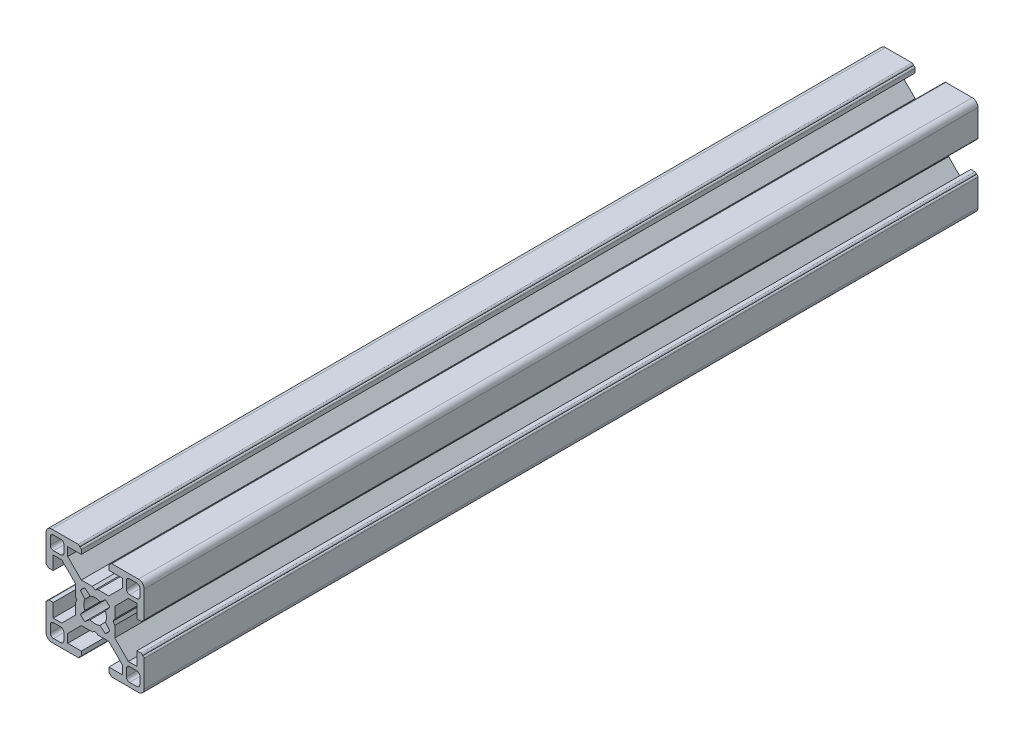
ISO-10303-21;
HEADER;
FILE_DESCRIPTION(('STEP AP214'),'2;1');
FILE_NAME('part.step','',(''),(''),'','','');
FILE_SCHEMA(('AUTOMOTIVE_DESIGN { 1 0 10303 214 1 1 1 1 }'));
ENDSEC;
DATA;
#1=APPLICATION_CONTEXT('core data for automotive mechanical design processes');
#2=APPLICATION_PROTOCOL_DEFINITION('international standard','automotive_design',2000,#1);
#3=PRODUCT_CONTEXT('',#1,'mechanical');
#4=PRODUCT('Part','Part','',(#3));
#5=PRODUCT_RELATED_PRODUCT_CATEGORY('part','',(#4));
#6=PRODUCT_DEFINITION_FORMATION('','',#4);
#7=PRODUCT_DEFINITION_CONTEXT('part definition',#1,'design');
#8=PRODUCT_DEFINITION('design','',#6,#7);
#9=PRODUCT_DEFINITION_SHAPE('','',#8);
#10=(LENGTH_UNIT() NAMED_UNIT(*) SI_UNIT(.MILLI.,.METRE.));
#11=(NAMED_UNIT(*) PLANE_ANGLE_UNIT() SI_UNIT($,.RADIAN.));
#12=(NAMED_UNIT(*) SI_UNIT($,.STERADIAN.) SOLID_ANGLE_UNIT());
#13=UNCERTAINTY_MEASURE_WITH_UNIT(LENGTH_MEASURE(1.E-05),#10,'distance_accuracy_value','');
#14=(GEOMETRIC_REPRESENTATION_CONTEXT(3) GLOBAL_UNCERTAINTY_ASSIGNED_CONTEXT((#13)) GLOBAL_UNIT_ASSIGNED_CONTEXT((#10,
#11,#12)) REPRESENTATION_CONTEXT('',''));
#15=CARTESIAN_POINT('',(0.,0.,0.));
#16=DIRECTION('',(0.,0.,1.));
#17=DIRECTION('',(1.,0.,0.));
#18=AXIS2_PLACEMENT_3D('',#15,#16,#17);
#19=CARTESIAN_POINT('',(-8.325,10.1351933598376,-127.));
#20=DIRECTION('',(1.,0.,0.));
#21=DIRECTION('',(0.,0.,-1.));
#22=AXIS2_PLACEMENT_3D('',#19,#20,#21);
#23=PLANE('',#22);
#24=DIRECTION('',(0.,1.,0.));
#25=VECTOR('',#24,1.);
#26=CARTESIAN_POINT('',(-8.325,10.1351933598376,127.));
#27=LINE('',#26,#25);
#28=CARTESIAN_POINT('',(-8.325,10.1351933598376,127.));
#29=VERTEX_POINT('',#28);
#30=CARTESIAN_POINT('',(-8.325,12.75,127.));
#31=VERTEX_POINT('',#30);
#32=EDGE_CURVE('E1797',#29,#31,#27,.T.);
#33=ORIENTED_EDGE('',*,*,#32,.F.);
#34=DIRECTION('',(0.,0.,1.));
#35=VECTOR('',#34,1.);
#36=CARTESIAN_POINT('',(-8.325,10.1351933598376,-127.));
#37=LINE('',#36,#35);
#38=CARTESIAN_POINT('',(-8.325,10.1351933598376,-127.));
#39=VERTEX_POINT('',#38);
#40=EDGE_CURVE('E11',#39,#29,#37,.T.);
#41=ORIENTED_EDGE('',*,*,#40,.F.);
#42=DIRECTION('',(0.,1.,0.));
#43=VECTOR('',#42,1.);
#44=CARTESIAN_POINT('',(-8.325,10.1351933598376,-127.));
#45=LINE('',#44,#43);
#46=CARTESIAN_POINT('',(-8.325,12.75,-127.));
#47=VERTEX_POINT('',#46);
#48=EDGE_CURVE('E1811',#39,#47,#45,.T.);
#49=ORIENTED_EDGE('',*,*,#48,.T.);
#50=DIRECTION('',(0.,0.,1.));
#51=VECTOR('',#50,1.);
#52=CARTESIAN_POINT('',(-8.325,12.75,-127.));
#53=LINE('',#52,#51);
#54=EDGE_CURVE('E52',#47,#31,#53,.T.);
#55=ORIENTED_EDGE('',*,*,#54,.T.);
#56=EDGE_LOOP('',(#33,#41,#49,#55));
#57=FACE_BOUND('',#56,.T.);
#58=ADVANCED_FACE('F49',(#57),#23,.T.);
#59=CARTESIAN_POINT('',(-4.18980664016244,6.,-127.));
#60=DIRECTION('',(0.707106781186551,0.707106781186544,0.));
#61=DIRECTION('',(-0.707106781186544,0.707106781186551,0.));
#62=AXIS2_PLACEMENT_3D('',#59,#60,#61);
#63=PLANE('',#62);
#64=DIRECTION('',(-0.707106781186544,0.707106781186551,0.));
#65=VECTOR('',#64,1.);
#66=CARTESIAN_POINT('',(-4.18980664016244,6.,127.));
#67=LINE('',#66,#65);
#68=CARTESIAN_POINT('',(-4.18980664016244,6.,127.));
#69=VERTEX_POINT('',#68);
#70=EDGE_CURVE('E1815',#69,#29,#67,.T.);
#71=ORIENTED_EDGE('',*,*,#70,.F.);
#72=DIRECTION('',(0.,0.,1.));
#73=VECTOR('',#72,1.);
#74=CARTESIAN_POINT('',(-4.18980664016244,6.,-127.));
#75=LINE('',#74,#73);
#76=CARTESIAN_POINT('',(-4.18980664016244,6.,-127.));
#77=VERTEX_POINT('',#76);
#78=EDGE_CURVE('E57',#77,#69,#75,.T.);
#79=ORIENTED_EDGE('',*,*,#78,.F.);
#80=DIRECTION('',(-0.707106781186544,0.707106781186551,0.));
#81=VECTOR('',#80,1.);
#82=CARTESIAN_POINT('',(-4.18980664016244,6.,-127.));
#83=LINE('',#82,#81);
#84=EDGE_CURVE('E1892',#77,#39,#83,.T.);
#85=ORIENTED_EDGE('',*,*,#84,.T.);
#86=ORIENTED_EDGE('',*,*,#40,.T.);
#87=EDGE_LOOP('',(#71,#79,#85,#86));
#88=FACE_BOUND('',#87,.T.);
#89=ADVANCED_FACE('F2041',(#88),#63,.T.);
#90=CARTESIAN_POINT('',(-0.875,6.,-127.));
#91=DIRECTION('',(0.,1.,0.));
#92=DIRECTION('',(0.,0.,1.));
#93=AXIS2_PLACEMENT_3D('',#90,#91,#92);
#94=PLANE('',#93);
#95=DIRECTION('',(-1.,0.,0.));
#96=VECTOR('',#95,1.);
#97=CARTESIAN_POINT('',(-0.875,6.,127.));
#98=LINE('',#97,#96);
#99=CARTESIAN_POINT('',(-0.875,6.,127.));
#100=VERTEX_POINT('',#99);
#101=EDGE_CURVE('E1971',#100,#69,#98,.T.);
#102=ORIENTED_EDGE('',*,*,#101,.F.);
#103=DIRECTION('',(0.,0.,1.));
#104=VECTOR('',#103,1.);
#105=CARTESIAN_POINT('',(-0.875,6.,-127.));
#106=LINE('',#105,#104);
#107=CARTESIAN_POINT('',(-0.875,6.,-127.));
#108=VERTEX_POINT('',#107);
#109=EDGE_CURVE('E1977',#108,#100,#106,.T.);
#110=ORIENTED_EDGE('',*,*,#109,.F.);
#111=DIRECTION('',(-1.,0.,0.));
#112=VECTOR('',#111,1.);
#113=CARTESIAN_POINT('',(-0.875,6.,-127.));
#114=LINE('',#113,#112);
#115=EDGE_CURVE('E1889',#108,#77,#114,.T.);
#116=ORIENTED_EDGE('',*,*,#115,.T.);
#117=ORIENTED_EDGE('',*,*,#78,.T.);
#118=EDGE_LOOP('',(#102,#110,#116,#117));
#119=FACE_BOUND('',#118,.T.);
#120=ADVANCED_FACE('F2396',(#119),#94,.T.);
#121=CARTESIAN_POINT('',(0.,5.5,-127.));
#122=DIRECTION('',(0.496138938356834,0.868243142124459,0.));
#123=DIRECTION('',(-0.868243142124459,0.496138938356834,0.));
#124=AXIS2_PLACEMENT_3D('',#121,#122,#123);
#125=PLANE('',#124);
#126=DIRECTION('',(-0.868243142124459,0.496138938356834,0.));
#127=VECTOR('',#126,1.);
#128=CARTESIAN_POINT('',(0.,5.5,127.));
#129=LINE('',#128,#127);
#130=CARTESIAN_POINT('',(0.,5.5,127.));
#131=VERTEX_POINT('',#130);
#132=EDGE_CURVE('E1968',#131,#100,#129,.T.);
#133=ORIENTED_EDGE('',*,*,#132,.F.);
#134=DIRECTION('',(0.,0.,1.));
#135=VECTOR('',#134,1.);
#136=CARTESIAN_POINT('',(0.,5.5,-127.));
#137=LINE('',#136,#135);
#138=CARTESIAN_POINT('',(0.,5.5,-127.));
#139=VERTEX_POINT('',#138);
#140=EDGE_CURVE('E1979',#139,#131,#137,.T.);
#141=ORIENTED_EDGE('',*,*,#140,.F.);
#142=DIRECTION('',(-0.868243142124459,0.496138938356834,0.));
#143=VECTOR('',#142,1.);
#144=CARTESIAN_POINT('',(0.,5.5,-127.));
#145=LINE('',#144,#143);
#146=EDGE_CURVE('E1886',#139,#108,#145,.T.);
#147=ORIENTED_EDGE('',*,*,#146,.T.);
#148=ORIENTED_EDGE('',*,*,#109,.T.);
#149=EDGE_LOOP('',(#133,#141,#147,#148));
#150=FACE_BOUND('',#149,.T.);
#151=ADVANCED_FACE('F2394',(#150),#125,.T.);
#152=CARTESIAN_POINT('',(0.,0.,-127.));
#153=DIRECTION('',(0.,0.,1.));
#154=DIRECTION('',(1.,0.,0.));
#155=AXIS2_PLACEMENT_3D('',#152,#153,#154);
#156=CYLINDRICAL_SURFACE('',#155,3.45501159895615);
#157=CARTESIAN_POINT('',(0.,0.,127.));
#158=DIRECTION('',(0.,0.,-1.));
#159=DIRECTION('',(-1.,0.,0.));
#160=AXIS2_PLACEMENT_3D('',#157,#158,#159);
#161=CIRCLE('',#160,3.45501159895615);
#162=CARTESIAN_POINT('',(-1.49058556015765,3.1169311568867,127.));
#163=VERTEX_POINT('',#162);
#164=CARTESIAN_POINT('',(1.4905855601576,3.11693115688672,127.));
#165=VERTEX_POINT('',#164);
#166=EDGE_CURVE('E1966',#163,#165,#161,.T.);
#167=ORIENTED_EDGE('',*,*,#166,.F.);
#168=DIRECTION('',(0.,0.,1.));
#169=VECTOR('',#168,1.);
#170=CARTESIAN_POINT('',(-1.49058556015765,3.1169311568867,-127.));
#171=LINE('',#170,#169);
#172=CARTESIAN_POINT('',(-1.49058556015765,3.1169311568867,-127.));
#173=VERTEX_POINT('',#172);
#174=EDGE_CURVE('E1982',#173,#163,#171,.T.);
#175=ORIENTED_EDGE('',*,*,#174,.F.);
#176=CARTESIAN_POINT('',(0.,0.,-127.));
#177=DIRECTION('',(0.,0.,-1.));
#178=DIRECTION('',(-1.,0.,0.));
#179=AXIS2_PLACEMENT_3D('',#176,#177,#178);
#180=CIRCLE('',#179,3.45501159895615);
#181=CARTESIAN_POINT('',(1.4905855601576,3.11693115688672,-127.));
#182=VERTEX_POINT('',#181);
#183=EDGE_CURVE('E1884',#173,#182,#180,.T.);
#184=ORIENTED_EDGE('',*,*,#183,.T.);
#185=DIRECTION('',(0.,0.,1.));
#186=VECTOR('',#185,1.);
#187=CARTESIAN_POINT('',(1.4905855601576,3.11693115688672,-127.));
#188=LINE('',#187,#186);
#189=EDGE_CURVE('E1149',#182,#165,#188,.T.);
#190=ORIENTED_EDGE('',*,*,#189,.T.);
#191=EDGE_LOOP('',(#167,#175,#184,#190));
#192=FACE_BOUND('',#191,.T.);
#193=ADVANCED_FACE('F2425',(#192),#156,.F.);
#194=CARTESIAN_POINT('',(-3.16278731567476,4.45679272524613,-127.));
#195=DIRECTION('',(-0.625292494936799,-0.780390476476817,0.));
#196=DIRECTION('',(0.780390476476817,-0.625292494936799,0.));
#197=AXIS2_PLACEMENT_3D('',#194,#195,#196);
#198=PLANE('',#197);
#199=DIRECTION('',(0.780390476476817,-0.625292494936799,0.));
#200=VECTOR('',#199,1.);
#201=CARTESIAN_POINT('',(-3.16278731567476,4.45679272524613,127.));
#202=LINE('',#201,#200);
#203=CARTESIAN_POINT('',(-3.16278731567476,4.45679272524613,127.));
#204=VERTEX_POINT('',#203);
#205=EDGE_CURVE('E1963',#204,#163,#202,.T.);
#206=ORIENTED_EDGE('',*,*,#205,.F.);
#207=DIRECTION('',(0.,0.,1.));
#208=VECTOR('',#207,1.);
#209=CARTESIAN_POINT('',(-3.16278731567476,4.45679272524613,-127.));
#210=LINE('',#209,#208);
#211=CARTESIAN_POINT('',(-3.16278731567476,4.45679272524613,-127.));
#212=VERTEX_POINT('',#211);
#213=EDGE_CURVE('E1984',#212,#204,#210,.T.);
#214=ORIENTED_EDGE('',*,*,#213,.F.);
#215=DIRECTION('',(0.780390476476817,-0.625292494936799,0.));
#216=VECTOR('',#215,1.);
#217=CARTESIAN_POINT('',(-3.16278731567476,4.45679272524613,-127.));
#218=LINE('',#217,#216);
#219=EDGE_CURVE('E1881',#212,#173,#218,.T.);
#220=ORIENTED_EDGE('',*,*,#219,.T.);
#221=ORIENTED_EDGE('',*,*,#174,.T.);
#222=EDGE_LOOP('',(#206,#214,#220,#221));
#223=FACE_BOUND('',#222,.T.);
#224=ADVANCED_FACE('F2428',(#223),#198,.T.);
#225=CARTESIAN_POINT('',(0.,0.,-127.));
#226=DIRECTION('',(0.,0.,1.));
#227=DIRECTION('',(1.,0.,0.));
#228=AXIS2_PLACEMENT_3D('',#225,#226,#227);
#229=CYLINDRICAL_SURFACE('',#228,5.465);
#230=CARTESIAN_POINT('',(0.,0.,127.));
#231=DIRECTION('',(0.,0.,-1.));
#232=DIRECTION('',(-1.,0.,0.));
#233=AXIS2_PLACEMENT_3D('',#230,#231,#232);
#234=CIRCLE('',#233,5.465);
#235=CARTESIAN_POINT('',(-4.45679272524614,3.16278731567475,127.));
#236=VERTEX_POINT('',#235);
#237=EDGE_CURVE('E1960',#236,#204,#234,.T.);
#238=ORIENTED_EDGE('',*,*,#237,.F.);
#239=DIRECTION('',(0.,0.,1.));
#240=VECTOR('',#239,1.);
#241=CARTESIAN_POINT('',(-4.45679272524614,3.16278731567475,-127.));
#242=LINE('',#241,#240);
#243=CARTESIAN_POINT('',(-4.45679272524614,3.16278731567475,-127.));
#244=VERTEX_POINT('',#243);
#245=EDGE_CURVE('E1986',#244,#236,#242,.T.);
#246=ORIENTED_EDGE('',*,*,#245,.F.);
#247=CARTESIAN_POINT('',(0.,0.,-127.));
#248=DIRECTION('',(0.,0.,-1.));
#249=DIRECTION('',(-1.,0.,0.));
#250=AXIS2_PLACEMENT_3D('',#247,#248,#249);
#251=CIRCLE('',#250,5.465);
#252=EDGE_CURVE('E1878',#244,#212,#251,.T.);
#253=ORIENTED_EDGE('',*,*,#252,.T.);
#254=ORIENTED_EDGE('',*,*,#213,.T.);
#255=EDGE_LOOP('',(#238,#246,#253,#254));
#256=FACE_BOUND('',#255,.T.);
#257=ADVANCED_FACE('F2432',(#256),#229,.F.);
#258=CARTESIAN_POINT('',(-3.1169311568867,1.49058556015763,-127.));
#259=DIRECTION('',(0.780390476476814,0.625292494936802,0.));
#260=DIRECTION('',(-0.625292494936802,0.780390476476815,0.));
#261=AXIS2_PLACEMENT_3D('',#258,#259,#260);
#262=PLANE('',#261);
#263=DIRECTION('',(-0.625292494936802,0.780390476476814,0.));
#264=VECTOR('',#263,1.);
#265=CARTESIAN_POINT('',(-3.1169311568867,1.49058556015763,127.));
#266=LINE('',#265,#264);
#267=CARTESIAN_POINT('',(-3.1169311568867,1.49058556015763,127.));
#268=VERTEX_POINT('',#267);
#269=EDGE_CURVE('E1957',#268,#236,#266,.T.);
#270=ORIENTED_EDGE('',*,*,#269,.F.);
#271=DIRECTION('',(0.,0.,1.));
#272=VECTOR('',#271,1.);
#273=CARTESIAN_POINT('',(-3.1169311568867,1.49058556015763,-127.));
#274=LINE('',#273,#272);
#275=CARTESIAN_POINT('',(-3.1169311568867,1.49058556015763,-127.));
#276=VERTEX_POINT('',#275);
#277=EDGE_CURVE('E1988',#276,#268,#274,.T.);
#278=ORIENTED_EDGE('',*,*,#277,.F.);
#279=DIRECTION('',(-0.625292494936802,0.780390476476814,0.));
#280=VECTOR('',#279,1.);
#281=CARTESIAN_POINT('',(-3.1169311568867,1.49058556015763,-127.));
#282=LINE('',#281,#280);
#283=EDGE_CURVE('E1875',#276,#244,#282,.T.);
#284=ORIENTED_EDGE('',*,*,#283,.T.);
#285=ORIENTED_EDGE('',*,*,#245,.T.);
#286=EDGE_LOOP('',(#270,#278,#284,#285));
#287=FACE_BOUND('',#286,.T.);
#288=ADVANCED_FACE('F2436',(#287),#262,.T.);
#289=CARTESIAN_POINT('',(0.,0.,-127.));
#290=DIRECTION('',(0.,0.,1.));
#291=DIRECTION('',(1.,0.,0.));
#292=AXIS2_PLACEMENT_3D('',#289,#290,#291);
#293=CYLINDRICAL_SURFACE('',#292,3.45501159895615);
#294=CARTESIAN_POINT('',(0.,0.,127.));
#295=DIRECTION('',(0.,0.,-1.));
#296=DIRECTION('',(-1.,0.,0.));
#297=AXIS2_PLACEMENT_3D('',#294,#295,#296);
#298=CIRCLE('',#297,3.45501159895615);
#299=CARTESIAN_POINT('',(-3.11693115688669,-1.49058556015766,127.));
#300=VERTEX_POINT('',#299);
#301=EDGE_CURVE('E1954',#300,#268,#298,.T.);
#302=ORIENTED_EDGE('',*,*,#301,.F.);
#303=DIRECTION('',(0.,0.,1.));
#304=VECTOR('',#303,1.);
#305=CARTESIAN_POINT('',(-3.11693115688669,-1.49058556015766,-127.));
#306=LINE('',#305,#304);
#307=CARTESIAN_POINT('',(-3.11693115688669,-1.49058556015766,-127.));
#308=VERTEX_POINT('',#307);
#309=EDGE_CURVE('E1701',#308,#300,#306,.T.);
#310=ORIENTED_EDGE('',*,*,#309,.F.);
#311=CARTESIAN_POINT('',(0.,0.,-127.));
#312=DIRECTION('',(0.,0.,-1.));
#313=DIRECTION('',(-1.,0.,0.));
#314=AXIS2_PLACEMENT_3D('',#311,#312,#313);
#315=CIRCLE('',#314,3.45501159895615);
#316=EDGE_CURVE('E1872',#308,#276,#315,.T.);
#317=ORIENTED_EDGE('',*,*,#316,.T.);
#318=ORIENTED_EDGE('',*,*,#277,.T.);
#319=EDGE_LOOP('',(#302,#310,#317,#318));
#320=FACE_BOUND('',#319,.T.);
#321=ADVANCED_FACE('F2440',(#320),#293,.F.);
#322=CARTESIAN_POINT('',(-6.,0.875,-127.));
#323=DIRECTION('',(-0.868243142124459,-0.496138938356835,0.));
#324=DIRECTION('',(0.496138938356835,-0.868243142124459,0.));
#325=AXIS2_PLACEMENT_3D('',#322,#323,#324);
#326=PLANE('',#325);
#327=DIRECTION('',(0.496138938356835,-0.868243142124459,0.));
#328=VECTOR('',#327,1.);
#329=CARTESIAN_POINT('',(-6.,0.875,127.));
#330=LINE('',#329,#328);
#331=CARTESIAN_POINT('',(-6.,0.875,127.));
#332=VERTEX_POINT('',#331);
#333=CARTESIAN_POINT('',(-5.5,0.,127.));
#334=VERTEX_POINT('',#333);
#335=EDGE_CURVE('E1951',#332,#334,#330,.T.);
#336=ORIENTED_EDGE('',*,*,#335,.F.);
#337=DIRECTION('',(0.,0.,1.));
#338=VECTOR('',#337,1.);
#339=CARTESIAN_POINT('',(-6.,0.875,-127.));
#340=LINE('',#339,#338);
#341=CARTESIAN_POINT('',(-6.,0.875,-127.));
#342=VERTEX_POINT('',#341);
#343=EDGE_CURVE('E1993',#342,#332,#340,.T.);
#344=ORIENTED_EDGE('',*,*,#343,.F.);
#345=DIRECTION('',(0.496138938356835,-0.868243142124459,0.));
#346=VECTOR('',#345,1.);
#347=CARTESIAN_POINT('',(-6.,0.875,-127.));
#348=LINE('',#347,#346);
#349=CARTESIAN_POINT('',(-5.5,0.,-127.));
#350=VERTEX_POINT('',#349);
#351=EDGE_CURVE('E1869',#342,#350,#348,.T.);
#352=ORIENTED_EDGE('',*,*,#351,.T.);
#353=DIRECTION('',(0.,0.,1.));
#354=VECTOR('',#353,1.);
#355=CARTESIAN_POINT('',(-5.5,0.,-127.));
#356=LINE('',#355,#354);
#357=EDGE_CURVE('E1990',#350,#334,#356,.T.);
#358=ORIENTED_EDGE('',*,*,#357,.T.);
#359=EDGE_LOOP('',(#336,#344,#352,#358));
#360=FACE_BOUND('',#359,.T.);
#361=ADVANCED_FACE('F2116',(#360),#326,.T.);
#362=CARTESIAN_POINT('',(-6.,4.18980664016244,-127.));
#363=DIRECTION('',(-1.,0.,0.));
#364=DIRECTION('',(0.,0.,1.));
#365=AXIS2_PLACEMENT_3D('',#362,#363,#364);
#366=PLANE('',#365);
#367=DIRECTION('',(0.,-1.,0.));
#368=VECTOR('',#367,1.);
#369=CARTESIAN_POINT('',(-6.,4.18980664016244,127.));
#370=LINE('',#369,#368);
#371=CARTESIAN_POINT('',(-6.,4.18980664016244,127.));
#372=VERTEX_POINT('',#371);
#373=EDGE_CURVE('E1948',#372,#332,#370,.T.);
#374=ORIENTED_EDGE('',*,*,#373,.F.);
#375=DIRECTION('',(0.,0.,1.));
#376=VECTOR('',#375,1.);
#377=CARTESIAN_POINT('',(-6.,4.18980664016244,-127.));
#378=LINE('',#377,#376);
#379=CARTESIAN_POINT('',(-6.,4.18980664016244,-127.));
#380=VERTEX_POINT('',#379);
#381=EDGE_CURVE('E1995',#380,#372,#378,.T.);
#382=ORIENTED_EDGE('',*,*,#381,.F.);
#383=DIRECTION('',(0.,-1.,0.));
#384=VECTOR('',#383,1.);
#385=CARTESIAN_POINT('',(-6.,4.18980664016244,-127.));
#386=LINE('',#385,#384);
#387=EDGE_CURVE('E1866',#380,#342,#386,.T.);
#388=ORIENTED_EDGE('',*,*,#387,.T.);
#389=ORIENTED_EDGE('',*,*,#343,.T.);
#390=EDGE_LOOP('',(#374,#382,#388,#389));
#391=FACE_BOUND('',#390,.T.);
#392=ADVANCED_FACE('F2112',(#391),#366,.T.);
#393=CARTESIAN_POINT('',(-10.1351933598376,8.325,-127.));
#394=DIRECTION('',(-0.707106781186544,-0.707106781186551,0.));
#395=DIRECTION('',(0.707106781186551,-0.707106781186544,0.));
#396=AXIS2_PLACEMENT_3D('',#393,#394,#395);
#397=PLANE('',#396);
#398=DIRECTION('',(0.707106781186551,-0.707106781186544,0.));
#399=VECTOR('',#398,1.);
#400=CARTESIAN_POINT('',(-10.1351933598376,8.325,127.));
#401=LINE('',#400,#399);
#402=CARTESIAN_POINT('',(-10.1351933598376,8.325,127.));
#403=VERTEX_POINT('',#402);
#404=EDGE_CURVE('E1945',#403,#372,#401,.T.);
#405=ORIENTED_EDGE('',*,*,#404,.F.);
#406=DIRECTION('',(0.,0.,1.));
#407=VECTOR('',#406,1.);
#408=CARTESIAN_POINT('',(-10.1351933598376,8.325,-127.));
#409=LINE('',#408,#407);
#410=CARTESIAN_POINT('',(-10.1351933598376,8.325,-127.));
#411=VERTEX_POINT('',#410);
#412=EDGE_CURVE('E1997',#411,#403,#409,.T.);
#413=ORIENTED_EDGE('',*,*,#412,.F.);
#414=DIRECTION('',(0.707106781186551,-0.707106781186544,0.));
#415=VECTOR('',#414,1.);
#416=CARTESIAN_POINT('',(-10.1351933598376,8.325,-127.));
#417=LINE('',#416,#415);
#418=EDGE_CURVE('E1863',#411,#380,#417,.T.);
#419=ORIENTED_EDGE('',*,*,#418,.T.);
#420=ORIENTED_EDGE('',*,*,#381,.T.);
#421=EDGE_LOOP('',(#405,#413,#419,#420));
#422=FACE_BOUND('',#421,.T.);
#423=ADVANCED_FACE('F2108',(#422),#397,.T.);
#424=CARTESIAN_POINT('',(-12.75,8.325,-127.));
#425=DIRECTION('',(0.,-1.,0.));
#426=DIRECTION('',(0.,0.,-1.));
#427=AXIS2_PLACEMENT_3D('',#424,#425,#426);
#428=PLANE('',#427);
#429=DIRECTION('',(1.,0.,0.));
#430=VECTOR('',#429,1.);
#431=CARTESIAN_POINT('',(-12.75,8.325,127.));
#432=LINE('',#431,#430);
#433=CARTESIAN_POINT('',(-12.75,8.325,127.));
#434=VERTEX_POINT('',#433);
#435=EDGE_CURVE('E1942',#434,#403,#432,.T.);
#436=ORIENTED_EDGE('',*,*,#435,.F.);
#437=DIRECTION('',(0.,0.,1.));
#438=VECTOR('',#437,1.);
#439=CARTESIAN_POINT('',(-12.75,8.325,-127.));
#440=LINE('',#439,#438);
#441=CARTESIAN_POINT('',(-12.75,8.325,-127.));
#442=VERTEX_POINT('',#441);
#443=EDGE_CURVE('E1999',#442,#434,#440,.T.);
#444=ORIENTED_EDGE('',*,*,#443,.F.);
#445=DIRECTION('',(1.,0.,0.));
#446=VECTOR('',#445,1.);
#447=CARTESIAN_POINT('',(-12.75,8.325,-127.));
#448=LINE('',#447,#446);
#449=EDGE_CURVE('E1860',#442,#411,#448,.T.);
#450=ORIENTED_EDGE('',*,*,#449,.T.);
#451=ORIENTED_EDGE('',*,*,#412,.T.);
#452=EDGE_LOOP('',(#436,#444,#450,#451));
#453=FACE_BOUND('',#452,.T.);
#454=ADVANCED_FACE('F2104',(#453),#428,.T.);
#455=CARTESIAN_POINT('',(-12.75,4.2,-127.));
#456=DIRECTION('',(1.,0.,0.));
#457=DIRECTION('',(0.,0.,-1.));
#458=AXIS2_PLACEMENT_3D('',#455,#456,#457);
#459=PLANE('',#458);
#460=DIRECTION('',(0.,1.,0.));
#461=VECTOR('',#460,1.);
#462=CARTESIAN_POINT('',(-12.75,4.2,127.));
#463=LINE('',#462,#461);
#464=CARTESIAN_POINT('',(-12.75,4.2,127.));
#465=VERTEX_POINT('',#464);
#466=EDGE_CURVE('E1939',#465,#434,#463,.T.);
#467=ORIENTED_EDGE('',*,*,#466,.F.);
#468=DIRECTION('',(0.,0.,1.));
#469=VECTOR('',#468,1.);
#470=CARTESIAN_POINT('',(-12.75,4.2,-127.));
#471=LINE('',#470,#469);
#472=CARTESIAN_POINT('',(-12.75,4.2,-127.));
#473=VERTEX_POINT('',#472);
#474=EDGE_CURVE('E2001',#473,#465,#471,.T.);
#475=ORIENTED_EDGE('',*,*,#474,.F.);
#476=DIRECTION('',(0.,1.,0.));
#477=VECTOR('',#476,1.);
#478=CARTESIAN_POINT('',(-12.75,4.2,-127.));
#479=LINE('',#478,#477);
#480=EDGE_CURVE('E1857',#473,#442,#479,.T.);
#481=ORIENTED_EDGE('',*,*,#480,.T.);
#482=ORIENTED_EDGE('',*,*,#443,.T.);
#483=EDGE_LOOP('',(#467,#475,#481,#482));
#484=FACE_BOUND('',#483,.T.);
#485=ADVANCED_FACE('F2100',(#484),#459,.T.);
#486=CARTESIAN_POINT('',(-14.,4.2,-127.));
#487=DIRECTION('',(0.,-1.,0.));
#488=DIRECTION('',(0.,0.,-1.));
#489=AXIS2_PLACEMENT_3D('',#486,#487,#488);
#490=PLANE('',#489);
#491=DIRECTION('',(1.,0.,0.));
#492=VECTOR('',#491,1.);
#493=CARTESIAN_POINT('',(-14.,4.2,127.));
#494=LINE('',#493,#492);
#495=CARTESIAN_POINT('',(-14.,4.2,127.));
#496=VERTEX_POINT('',#495);
#497=EDGE_CURVE('E1936',#496,#465,#494,.T.);
#498=ORIENTED_EDGE('',*,*,#497,.F.);
#499=DIRECTION('',(0.,0.,1.));
#500=VECTOR('',#499,1.);
#501=CARTESIAN_POINT('',(-14.,4.2,-127.));
#502=LINE('',#501,#500);
#503=CARTESIAN_POINT('',(-14.,4.2,-127.));
#504=VERTEX_POINT('',#503);
#505=EDGE_CURVE('E2003',#504,#496,#502,.T.);
#506=ORIENTED_EDGE('',*,*,#505,.F.);
#507=DIRECTION('',(1.,0.,0.));
#508=VECTOR('',#507,1.);
#509=CARTESIAN_POINT('',(-14.,4.2,-127.));
#510=LINE('',#509,#508);
#511=EDGE_CURVE('E1854',#504,#473,#510,.T.);
#512=ORIENTED_EDGE('',*,*,#511,.T.);
#513=ORIENTED_EDGE('',*,*,#474,.T.);
#514=EDGE_LOOP('',(#498,#506,#512,#513));
#515=FACE_BOUND('',#514,.T.);
#516=ADVANCED_FACE('F2096',(#515),#490,.T.);
#517=CARTESIAN_POINT('',(-14.,4.65,-127.));
#518=DIRECTION('',(0.,0.,1.));
#519=DIRECTION('',(1.,0.,0.));
#520=AXIS2_PLACEMENT_3D('',#517,#518,#519);
#521=CYLINDRICAL_SURFACE('',#520,0.449999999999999);
#522=CARTESIAN_POINT('',(-14.,4.65,127.));
#523=DIRECTION('',(0.,0.,1.));
#524=DIRECTION('',(1.,0.,0.));
#525=AXIS2_PLACEMENT_3D('',#522,#523,#524);
#526=CIRCLE('',#525,0.449999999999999);
#527=CARTESIAN_POINT('',(-14.45,4.65,127.));
#528=VERTEX_POINT('',#527);
#529=EDGE_CURVE('E1933',#528,#496,#526,.T.);
#530=ORIENTED_EDGE('',*,*,#529,.F.);
#531=DIRECTION('',(0.,0.,1.));
#532=VECTOR('',#531,1.);
#533=CARTESIAN_POINT('',(-14.45,4.65,-127.));
#534=LINE('',#533,#532);
#535=CARTESIAN_POINT('',(-14.45,4.65,-127.));
#536=VERTEX_POINT('',#535);
#537=EDGE_CURVE('E2005',#536,#528,#534,.T.);
#538=ORIENTED_EDGE('',*,*,#537,.F.);
#539=CARTESIAN_POINT('',(-14.,4.65,-127.));
#540=DIRECTION('',(0.,0.,1.));
#541=DIRECTION('',(1.,0.,0.));
#542=AXIS2_PLACEMENT_3D('',#539,#540,#541);
#543=CIRCLE('',#542,0.449999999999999);
#544=EDGE_CURVE('E1851',#536,#504,#543,.T.);
#545=ORIENTED_EDGE('',*,*,#544,.T.);
#546=ORIENTED_EDGE('',*,*,#505,.T.);
#547=EDGE_LOOP('',(#530,#538,#545,#546));
#548=FACE_BOUND('',#547,.T.);
#549=ADVANCED_FACE('F2092',(#548),#521,.T.);
#550=CARTESIAN_POINT('',(-14.45,4.7,-127.));
#551=DIRECTION('',(-1.,0.,0.));
#552=DIRECTION('',(0.,0.,1.));
#553=AXIS2_PLACEMENT_3D('',#550,#551,#552);
#554=PLANE('',#553);
#555=DIRECTION('',(0.,-1.,0.));
#556=VECTOR('',#555,1.);
#557=CARTESIAN_POINT('',(-14.45,4.7,127.));
#558=LINE('',#557,#556);
#559=CARTESIAN_POINT('',(-14.45,4.7,127.));
#560=VERTEX_POINT('',#559);
#561=EDGE_CURVE('E1930',#560,#528,#558,.T.);
#562=ORIENTED_EDGE('',*,*,#561,.F.);
#563=DIRECTION('',(0.,0.,1.));
#564=VECTOR('',#563,1.);
#565=CARTESIAN_POINT('',(-14.45,4.7,-127.));
#566=LINE('',#565,#564);
#567=CARTESIAN_POINT('',(-14.45,4.7,-127.));
#568=VERTEX_POINT('',#567);
#569=EDGE_CURVE('E2007',#568,#560,#566,.T.);
#570=ORIENTED_EDGE('',*,*,#569,.F.);
#571=DIRECTION('',(0.,-1.,0.));
#572=VECTOR('',#571,1.);
#573=CARTESIAN_POINT('',(-14.45,4.7,-127.));
#574=LINE('',#573,#572);
#575=EDGE_CURVE('E1848',#568,#536,#574,.T.);
#576=ORIENTED_EDGE('',*,*,#575,.T.);
#577=ORIENTED_EDGE('',*,*,#537,.T.);
#578=EDGE_LOOP('',(#562,#570,#576,#577));
#579=FACE_BOUND('',#578,.T.);
#580=ADVANCED_FACE('F2088',(#579),#554,.T.);
#581=CARTESIAN_POINT('',(-14.5,4.7,-127.));
#582=DIRECTION('',(0.,-1.,0.));
#583=DIRECTION('',(0.,0.,-1.));
#584=AXIS2_PLACEMENT_3D('',#581,#582,#583);
#585=PLANE('',#584);
#586=DIRECTION('',(1.,0.,0.));
#587=VECTOR('',#586,1.);
#588=CARTESIAN_POINT('',(-14.5,4.7,127.));
#589=LINE('',#588,#587);
#590=CARTESIAN_POINT('',(-14.5,4.7,127.));
#591=VERTEX_POINT('',#590);
#592=EDGE_CURVE('E1927',#591,#560,#589,.T.);
#593=ORIENTED_EDGE('',*,*,#592,.F.);
#594=DIRECTION('',(0.,0.,1.));
#595=VECTOR('',#594,1.);
#596=CARTESIAN_POINT('',(-14.5,4.7,-127.));
#597=LINE('',#596,#595);
#598=CARTESIAN_POINT('',(-14.5,4.7,-127.));
#599=VERTEX_POINT('',#598);
#600=EDGE_CURVE('E2009',#599,#591,#597,.T.);
#601=ORIENTED_EDGE('',*,*,#600,.F.);
#602=DIRECTION('',(1.,0.,0.));
#603=VECTOR('',#602,1.);
#604=CARTESIAN_POINT('',(-14.5,4.7,-127.));
#605=LINE('',#604,#603);
#606=EDGE_CURVE('E1845',#599,#568,#605,.T.);
#607=ORIENTED_EDGE('',*,*,#606,.T.);
#608=ORIENTED_EDGE('',*,*,#569,.T.);
#609=EDGE_LOOP('',(#593,#601,#607,#608));
#610=FACE_BOUND('',#609,.T.);
#611=ADVANCED_FACE('F2084',(#610),#585,.T.);
#612=CARTESIAN_POINT('',(-14.5,5.15,-127.));
#613=DIRECTION('',(0.,0.,1.));
#614=DIRECTION('',(1.,0.,0.));
#615=AXIS2_PLACEMENT_3D('',#612,#613,#614);
#616=CYLINDRICAL_SURFACE('',#615,0.449999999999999);
#617=CARTESIAN_POINT('',(-14.5,5.15,127.));
#618=DIRECTION('',(0.,0.,1.));
#619=DIRECTION('',(1.,0.,0.));
#620=AXIS2_PLACEMENT_3D('',#617,#618,#619);
#621=CIRCLE('',#620,0.449999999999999);
#622=CARTESIAN_POINT('',(-14.95,5.15,127.));
#623=VERTEX_POINT('',#622);
#624=EDGE_CURVE('E1924',#623,#591,#621,.T.);
#625=ORIENTED_EDGE('',*,*,#624,.F.);
#626=DIRECTION('',(0.,0.,1.));
#627=VECTOR('',#626,1.);
#628=CARTESIAN_POINT('',(-14.95,5.15,-127.));
#629=LINE('',#628,#627);
#630=CARTESIAN_POINT('',(-14.95,5.15,-127.));
#631=VERTEX_POINT('',#630);
#632=EDGE_CURVE('E2011',#631,#623,#629,.T.);
#633=ORIENTED_EDGE('',*,*,#632,.F.);
#634=CARTESIAN_POINT('',(-14.5,5.15,-127.));
#635=DIRECTION('',(0.,0.,1.));
#636=DIRECTION('',(1.,0.,0.));
#637=AXIS2_PLACEMENT_3D('',#634,#635,#636);
#638=CIRCLE('',#637,0.449999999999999);
#639=EDGE_CURVE('E1842',#631,#599,#638,.T.);
#640=ORIENTED_EDGE('',*,*,#639,.T.);
#641=ORIENTED_EDGE('',*,*,#600,.T.);
#642=EDGE_LOOP('',(#625,#633,#640,#641));
#643=FACE_BOUND('',#642,.T.);
#644=ADVANCED_FACE('F2080',(#643),#616,.T.);
#645=CARTESIAN_POINT('',(-14.95,13.2,-127.));
#646=DIRECTION('',(-1.,0.,0.));
#647=DIRECTION('',(0.,0.,1.));
#648=AXIS2_PLACEMENT_3D('',#645,#646,#647);
#649=PLANE('',#648);
#650=DIRECTION('',(0.,-1.,0.));
#651=VECTOR('',#650,1.);
#652=CARTESIAN_POINT('',(-14.95,13.2,127.));
#653=LINE('',#652,#651);
#654=CARTESIAN_POINT('',(-14.95,13.2,127.));
#655=VERTEX_POINT('',#654);
#656=EDGE_CURVE('E1921',#655,#623,#653,.T.);
#657=ORIENTED_EDGE('',*,*,#656,.F.);
#658=DIRECTION('',(0.,0.,1.));
#659=VECTOR('',#658,1.);
#660=CARTESIAN_POINT('',(-14.95,13.2,-127.));
#661=LINE('',#660,#659);
#662=CARTESIAN_POINT('',(-14.95,13.2,-127.));
#663=VERTEX_POINT('',#662);
#664=EDGE_CURVE('E2013',#663,#655,#661,.T.);
#665=ORIENTED_EDGE('',*,*,#664,.F.);
#666=DIRECTION('',(0.,-1.,0.));
#667=VECTOR('',#666,1.);
#668=CARTESIAN_POINT('',(-14.95,13.2,-127.));
#669=LINE('',#668,#667);
#670=EDGE_CURVE('E1839',#663,#631,#669,.T.);
#671=ORIENTED_EDGE('',*,*,#670,.T.);
#672=ORIENTED_EDGE('',*,*,#632,.T.);
#673=EDGE_LOOP('',(#657,#665,#671,#672));
#674=FACE_BOUND('',#673,.T.);
#675=ADVANCED_FACE('F2076',(#674),#649,.T.);
#676=CARTESIAN_POINT('',(-13.2,13.2,-127.));
#677=DIRECTION('',(0.,0.,1.));
#678=DIRECTION('',(1.,0.,0.));
#679=AXIS2_PLACEMENT_3D('',#676,#677,#678);
#680=CYLINDRICAL_SURFACE('',#679,1.75);
#681=CARTESIAN_POINT('',(-13.2,13.2,127.));
#682=DIRECTION('',(0.,0.,1.));
#683=DIRECTION('',(1.,0.,0.));
#684=AXIS2_PLACEMENT_3D('',#681,#682,#683);
#685=CIRCLE('',#684,1.75);
#686=CARTESIAN_POINT('',(-13.2,14.95,127.));
#687=VERTEX_POINT('',#686);
#688=EDGE_CURVE('E1918',#687,#655,#685,.T.);
#689=ORIENTED_EDGE('',*,*,#688,.F.);
#690=DIRECTION('',(0.,0.,1.));
#691=VECTOR('',#690,1.);
#692=CARTESIAN_POINT('',(-13.2,14.95,-127.));
#693=LINE('',#692,#691);
#694=CARTESIAN_POINT('',(-13.2,14.95,-127.));
#695=VERTEX_POINT('',#694);
#696=EDGE_CURVE('E2015',#695,#687,#693,.T.);
#697=ORIENTED_EDGE('',*,*,#696,.F.);
#698=CARTESIAN_POINT('',(-13.2,13.2,-127.));
#699=DIRECTION('',(0.,0.,1.));
#700=DIRECTION('',(1.,0.,0.));
#701=AXIS2_PLACEMENT_3D('',#698,#699,#700);
#702=CIRCLE('',#701,1.75);
#703=EDGE_CURVE('E1836',#695,#663,#702,.T.);
#704=ORIENTED_EDGE('',*,*,#703,.T.);
#705=ORIENTED_EDGE('',*,*,#664,.T.);
#706=EDGE_LOOP('',(#689,#697,#704,#705));
#707=FACE_BOUND('',#706,.T.);
#708=ADVANCED_FACE('F2072',(#707),#680,.T.);
#709=CARTESIAN_POINT('',(-5.15,14.95,-127.));
#710=DIRECTION('',(0.,1.,0.));
#711=DIRECTION('',(0.,0.,1.));
#712=AXIS2_PLACEMENT_3D('',#709,#710,#711);
#713=PLANE('',#712);
#714=DIRECTION('',(-1.,0.,0.));
#715=VECTOR('',#714,1.);
#716=CARTESIAN_POINT('',(-5.15,14.95,127.));
#717=LINE('',#716,#715);
#718=CARTESIAN_POINT('',(-5.15,14.95,127.));
#719=VERTEX_POINT('',#718);
#720=EDGE_CURVE('E1915',#719,#687,#717,.T.);
#721=ORIENTED_EDGE('',*,*,#720,.F.);
#722=DIRECTION('',(0.,0.,1.));
#723=VECTOR('',#722,1.);
#724=CARTESIAN_POINT('',(-5.15,14.95,-127.));
#725=LINE('',#724,#723);
#726=CARTESIAN_POINT('',(-5.15,14.95,-127.));
#727=VERTEX_POINT('',#726);
#728=EDGE_CURVE('E2017',#727,#719,#725,.T.);
#729=ORIENTED_EDGE('',*,*,#728,.F.);
#730=DIRECTION('',(-1.,0.,0.));
#731=VECTOR('',#730,1.);
#732=CARTESIAN_POINT('',(-5.15,14.95,-127.));
#733=LINE('',#732,#731);
#734=EDGE_CURVE('E1833',#727,#695,#733,.T.);
#735=ORIENTED_EDGE('',*,*,#734,.T.);
#736=ORIENTED_EDGE('',*,*,#696,.T.);
#737=EDGE_LOOP('',(#721,#729,#735,#736));
#738=FACE_BOUND('',#737,.T.);
#739=ADVANCED_FACE('F2068',(#738),#713,.T.);
#740=CARTESIAN_POINT('',(-5.15,14.5,-127.));
#741=DIRECTION('',(0.,0.,1.));
#742=DIRECTION('',(1.,0.,0.));
#743=AXIS2_PLACEMENT_3D('',#740,#741,#742);
#744=CYLINDRICAL_SURFACE('',#743,0.449999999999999);
#745=CARTESIAN_POINT('',(-5.15,14.5,127.));
#746=DIRECTION('',(0.,0.,1.));
#747=DIRECTION('',(1.,0.,0.));
#748=AXIS2_PLACEMENT_3D('',#745,#746,#747);
#749=CIRCLE('',#748,0.449999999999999);
#750=CARTESIAN_POINT('',(-4.7,14.5,127.));
#751=VERTEX_POINT('',#750);
#752=EDGE_CURVE('E1912',#751,#719,#749,.T.);
#753=ORIENTED_EDGE('',*,*,#752,.F.);
#754=DIRECTION('',(0.,0.,1.));
#755=VECTOR('',#754,1.);
#756=CARTESIAN_POINT('',(-4.7,14.5,-127.));
#757=LINE('',#756,#755);
#758=CARTESIAN_POINT('',(-4.7,14.5,-127.));
#759=VERTEX_POINT('',#758);
#760=EDGE_CURVE('E2019',#759,#751,#757,.T.);
#761=ORIENTED_EDGE('',*,*,#760,.F.);
#762=CARTESIAN_POINT('',(-5.15,14.5,-127.));
#763=DIRECTION('',(0.,0.,1.));
#764=DIRECTION('',(1.,0.,0.));
#765=AXIS2_PLACEMENT_3D('',#762,#763,#764);
#766=CIRCLE('',#765,0.449999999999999);
#767=EDGE_CURVE('E1830',#759,#727,#766,.T.);
#768=ORIENTED_EDGE('',*,*,#767,.T.);
#769=ORIENTED_EDGE('',*,*,#728,.T.);
#770=EDGE_LOOP('',(#753,#761,#768,#769));
#771=FACE_BOUND('',#770,.T.);
#772=ADVANCED_FACE('F2064',(#771),#744,.T.);
#773=CARTESIAN_POINT('',(-4.7,14.45,-127.));
#774=DIRECTION('',(1.,0.,0.));
#775=DIRECTION('',(0.,0.,-1.));
#776=AXIS2_PLACEMENT_3D('',#773,#774,#775);
#777=PLANE('',#776);
#778=DIRECTION('',(0.,1.,0.));
#779=VECTOR('',#778,1.);
#780=CARTESIAN_POINT('',(-4.7,14.45,127.));
#781=LINE('',#780,#779);
#782=CARTESIAN_POINT('',(-4.7,14.45,127.));
#783=VERTEX_POINT('',#782);
#784=EDGE_CURVE('E1909',#783,#751,#781,.T.);
#785=ORIENTED_EDGE('',*,*,#784,.F.);
#786=DIRECTION('',(0.,0.,1.));
#787=VECTOR('',#786,1.);
#788=CARTESIAN_POINT('',(-4.7,14.45,-127.));
#789=LINE('',#788,#787);
#790=CARTESIAN_POINT('',(-4.7,14.45,-127.));
#791=VERTEX_POINT('',#790);
#792=EDGE_CURVE('E2021',#791,#783,#789,.T.);
#793=ORIENTED_EDGE('',*,*,#792,.F.);
#794=DIRECTION('',(0.,1.,0.));
#795=VECTOR('',#794,1.);
#796=CARTESIAN_POINT('',(-4.7,14.45,-127.));
#797=LINE('',#796,#795);
#798=EDGE_CURVE('E1827',#791,#759,#797,.T.);
#799=ORIENTED_EDGE('',*,*,#798,.T.);
#800=ORIENTED_EDGE('',*,*,#760,.T.);
#801=EDGE_LOOP('',(#785,#793,#799,#800));
#802=FACE_BOUND('',#801,.T.);
#803=ADVANCED_FACE('F2060',(#802),#777,.T.);
#804=CARTESIAN_POINT('',(-4.65,14.45,-127.));
#805=DIRECTION('',(0.,1.,0.));
#806=DIRECTION('',(0.,0.,1.));
#807=AXIS2_PLACEMENT_3D('',#804,#805,#806);
#808=PLANE('',#807);
#809=DIRECTION('',(-1.,0.,0.));
#810=VECTOR('',#809,1.);
#811=CARTESIAN_POINT('',(-4.65,14.45,127.));
#812=LINE('',#811,#810);
#813=CARTESIAN_POINT('',(-4.65,14.45,127.));
#814=VERTEX_POINT('',#813);
#815=EDGE_CURVE('E1906',#814,#783,#812,.T.);
#816=ORIENTED_EDGE('',*,*,#815,.F.);
#817=DIRECTION('',(0.,0.,1.));
#818=VECTOR('',#817,1.);
#819=CARTESIAN_POINT('',(-4.65,14.45,-127.));
#820=LINE('',#819,#818);
#821=CARTESIAN_POINT('',(-4.65,14.45,-127.));
#822=VERTEX_POINT('',#821);
#823=EDGE_CURVE('E2023',#822,#814,#820,.T.);
#824=ORIENTED_EDGE('',*,*,#823,.F.);
#825=DIRECTION('',(-1.,0.,0.));
#826=VECTOR('',#825,1.);
#827=CARTESIAN_POINT('',(-4.65,14.45,-127.));
#828=LINE('',#827,#826);
#829=EDGE_CURVE('E1824',#822,#791,#828,.T.);
#830=ORIENTED_EDGE('',*,*,#829,.T.);
#831=ORIENTED_EDGE('',*,*,#792,.T.);
#832=EDGE_LOOP('',(#816,#824,#830,#831));
#833=FACE_BOUND('',#832,.T.);
#834=ADVANCED_FACE('F2056',(#833),#808,.T.);
#835=CARTESIAN_POINT('',(-4.65,14.,-127.));
#836=DIRECTION('',(0.,0.,1.));
#837=DIRECTION('',(1.,0.,0.));
#838=AXIS2_PLACEMENT_3D('',#835,#836,#837);
#839=CYLINDRICAL_SURFACE('',#838,0.449999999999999);
#840=CARTESIAN_POINT('',(-4.65,14.,127.));
#841=DIRECTION('',(0.,0.,1.));
#842=DIRECTION('',(1.,0.,0.));
#843=AXIS2_PLACEMENT_3D('',#840,#841,#842);
#844=CIRCLE('',#843,0.449999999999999);
#845=CARTESIAN_POINT('',(-4.2,14.,127.));
#846=VERTEX_POINT('',#845);
#847=EDGE_CURVE('E1903',#846,#814,#844,.T.);
#848=ORIENTED_EDGE('',*,*,#847,.F.);
#849=DIRECTION('',(0.,0.,1.));
#850=VECTOR('',#849,1.);
#851=CARTESIAN_POINT('',(-4.2,14.,-127.));
#852=LINE('',#851,#850);
#853=CARTESIAN_POINT('',(-4.2,14.,-127.));
#854=VERTEX_POINT('',#853);
#855=EDGE_CURVE('E2025',#854,#846,#852,.T.);
#856=ORIENTED_EDGE('',*,*,#855,.F.);
#857=CARTESIAN_POINT('',(-4.65,14.,-127.));
#858=DIRECTION('',(0.,0.,1.));
#859=DIRECTION('',(1.,0.,0.));
#860=AXIS2_PLACEMENT_3D('',#857,#858,#859);
#861=CIRCLE('',#860,0.449999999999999);
#862=EDGE_CURVE('E1821',#854,#822,#861,.T.);
#863=ORIENTED_EDGE('',*,*,#862,.T.);
#864=ORIENTED_EDGE('',*,*,#823,.T.);
#865=EDGE_LOOP('',(#848,#856,#863,#864));
#866=FACE_BOUND('',#865,.T.);
#867=ADVANCED_FACE('F2054',(#866),#839,.T.);
#868=CARTESIAN_POINT('',(-4.2,12.75,-127.));
#869=DIRECTION('',(1.,0.,0.));
#870=DIRECTION('',(0.,0.,-1.));
#871=AXIS2_PLACEMENT_3D('',#868,#869,#870);
#872=PLANE('',#871);
#873=DIRECTION('',(0.,1.,0.));
#874=VECTOR('',#873,1.);
#875=CARTESIAN_POINT('',(-4.2,12.75,127.));
#876=LINE('',#875,#874);
#877=CARTESIAN_POINT('',(-4.2,12.75,127.));
#878=VERTEX_POINT('',#877);
#879=EDGE_CURVE('E1900',#878,#846,#876,.T.);
#880=ORIENTED_EDGE('',*,*,#879,.F.);
#881=DIRECTION('',(0.,0.,1.));
#882=VECTOR('',#881,1.);
#883=CARTESIAN_POINT('',(-4.2,12.75,-127.));
#884=LINE('',#883,#882);
#885=CARTESIAN_POINT('',(-4.2,12.75,-127.));
#886=VERTEX_POINT('',#885);
#887=EDGE_CURVE('E2026',#886,#878,#884,.T.);
#888=ORIENTED_EDGE('',*,*,#887,.F.);
#889=DIRECTION('',(0.,1.,0.));
#890=VECTOR('',#889,1.);
#891=CARTESIAN_POINT('',(-4.2,12.75,-127.));
#892=LINE('',#891,#890);
#893=EDGE_CURVE('E1818',#886,#854,#892,.T.);
#894=ORIENTED_EDGE('',*,*,#893,.T.);
#895=ORIENTED_EDGE('',*,*,#855,.T.);
#896=EDGE_LOOP('',(#880,#888,#894,#895));
#897=FACE_BOUND('',#896,.T.);
#898=ADVANCED_FACE('F2050',(#897),#872,.T.);
#899=CARTESIAN_POINT('',(-8.325,12.75,-127.));
#900=DIRECTION('',(0.,-1.,0.));
#901=DIRECTION('',(0.,0.,-1.));
#902=AXIS2_PLACEMENT_3D('',#899,#900,#901);
#903=PLANE('',#902);
#904=DIRECTION('',(1.,0.,0.));
#905=VECTOR('',#904,1.);
#906=CARTESIAN_POINT('',(-8.325,12.75,127.));
#907=LINE('',#906,#905);
#908=EDGE_CURVE('E1897',#31,#878,#907,.T.);
#909=ORIENTED_EDGE('',*,*,#908,.F.);
#910=ORIENTED_EDGE('',*,*,#54,.F.);
#911=DIRECTION('',(1.,0.,0.));
#912=VECTOR('',#911,1.);
#913=CARTESIAN_POINT('',(-8.325,12.75,-127.));
#914=LINE('',#913,#912);
#915=EDGE_CURVE('E1814',#47,#886,#914,.T.);
#916=ORIENTED_EDGE('',*,*,#915,.T.);
#917=ORIENTED_EDGE('',*,*,#887,.T.);
#918=EDGE_LOOP('',(#909,#910,#916,#917));
#919=FACE_BOUND('',#918,.T.);
#920=ADVANCED_FACE('F2034',(#919),#903,.T.);
#921=CARTESIAN_POINT('',(-4.65,14.,-127.));
#922=DIRECTION('',(0.,0.,1.));
#923=DIRECTION('',(1.,0.,0.));
#924=AXIS2_PLACEMENT_3D('',#921,#922,#923);
#925=PLANE('',#924);
#926=ORIENTED_EDGE('',*,*,#316,.F.);
#927=DIRECTION('',(0.625292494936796,0.780390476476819,0.));
#928=VECTOR('',#927,1.);
#929=CARTESIAN_POINT('',(-4.45679272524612,-3.16278731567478,-127.));
#930=LINE('',#929,#928);
#931=CARTESIAN_POINT('',(-4.45679272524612,-3.16278731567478,-127.));
#932=VERTEX_POINT('',#931);
#933=EDGE_CURVE('E1603',#932,#308,#930,.T.);
#934=ORIENTED_EDGE('',*,*,#933,.F.);
#935=CARTESIAN_POINT('',(0.,0.,-127.));
#936=DIRECTION('',(0.,0.,-1.));
#937=DIRECTION('',(0.,-1.,0.));
#938=AXIS2_PLACEMENT_3D('',#935,#936,#937);
#939=CIRCLE('',#938,5.465);
#940=CARTESIAN_POINT('',(-3.16278731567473,-4.45679272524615,-127.));
#941=VERTEX_POINT('',#940);
#942=EDGE_CURVE('E1600',#941,#932,#939,.T.);
#943=ORIENTED_EDGE('',*,*,#942,.F.);
#944=DIRECTION('',(-0.780390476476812,-0.625292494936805,0.));
#945=VECTOR('',#944,1.);
#946=CARTESIAN_POINT('',(-1.49058556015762,-3.11693115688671,-127.));
#947=LINE('',#946,#945);
#948=CARTESIAN_POINT('',(-1.49058556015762,-3.11693115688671,-127.));
#949=VERTEX_POINT('',#948);
#950=EDGE_CURVE('E1597',#949,#941,#947,.T.);
#951=ORIENTED_EDGE('',*,*,#950,.F.);
#952=CARTESIAN_POINT('',(0.,0.,-127.));
#953=DIRECTION('',(0.,0.,-1.));
#954=DIRECTION('',(0.,-1.,0.));
#955=AXIS2_PLACEMENT_3D('',#952,#953,#954);
#956=CIRCLE('',#955,3.45501159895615);
#957=CARTESIAN_POINT('',(1.49058556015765,-3.1169311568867,-127.));
#958=VERTEX_POINT('',#957);
#959=EDGE_CURVE('E1594',#958,#949,#956,.T.);
#960=ORIENTED_EDGE('',*,*,#959,.F.);
#961=DIRECTION('',(-0.780390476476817,0.625292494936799,0.));
#962=VECTOR('',#961,1.);
#963=CARTESIAN_POINT('',(3.16278731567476,-4.45679272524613,-127.));
#964=LINE('',#963,#962);
#965=CARTESIAN_POINT('',(3.16278731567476,-4.45679272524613,-127.));
#966=VERTEX_POINT('',#965);
#967=EDGE_CURVE('E1322',#966,#958,#964,.T.);
#968=ORIENTED_EDGE('',*,*,#967,.F.);
#969=CARTESIAN_POINT('',(0.,0.,-127.));
#970=DIRECTION('',(0.,0.,-1.));
#971=DIRECTION('',(1.,0.,0.));
#972=AXIS2_PLACEMENT_3D('',#969,#970,#971);
#973=CIRCLE('',#972,5.465);
#974=CARTESIAN_POINT('',(4.45679272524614,-3.16278731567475,-127.));
#975=VERTEX_POINT('',#974);
#976=EDGE_CURVE('E1319',#975,#966,#973,.T.);
#977=ORIENTED_EDGE('',*,*,#976,.F.);
#978=DIRECTION('',(0.625292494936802,-0.780390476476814,0.));
#979=VECTOR('',#978,1.);
#980=CARTESIAN_POINT('',(3.1169311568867,-1.49058556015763,-127.));
#981=LINE('',#980,#979);
#982=CARTESIAN_POINT('',(3.1169311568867,-1.49058556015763,-127.));
#983=VERTEX_POINT('',#982);
#984=EDGE_CURVE('E1316',#983,#975,#981,.T.);
#985=ORIENTED_EDGE('',*,*,#984,.F.);
#986=CARTESIAN_POINT('',(0.,0.,-127.));
#987=DIRECTION('',(0.,0.,-1.));
#988=DIRECTION('',(1.,0.,0.));
#989=AXIS2_PLACEMENT_3D('',#986,#987,#988);
#990=CIRCLE('',#989,3.45501159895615);
#991=CARTESIAN_POINT('',(3.11693115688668,1.49058556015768,-127.));
#992=VERTEX_POINT('',#991);
#993=EDGE_CURVE('E1313',#992,#983,#990,.T.);
#994=ORIENTED_EDGE('',*,*,#993,.F.);
#995=DIRECTION('',(-0.625292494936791,-0.780390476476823,0.));
#996=VECTOR('',#995,1.);
#997=CARTESIAN_POINT('',(4.4567927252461,3.16278731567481,-127.));
#998=LINE('',#997,#996);
#999=CARTESIAN_POINT('',(4.4567927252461,3.16278731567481,-127.));
#1000=VERTEX_POINT('',#999);
#1001=EDGE_CURVE('E1047',#1000,#992,#998,.T.);
#1002=ORIENTED_EDGE('',*,*,#1001,.F.);
#1003=CARTESIAN_POINT('',(0.,0.,-127.));
#1004=DIRECTION('',(0.,0.,-1.));
#1005=DIRECTION('',(0.,1.,0.));
#1006=AXIS2_PLACEMENT_3D('',#1003,#1004,#1005);
#1007=CIRCLE('',#1006,5.465);
#1008=CARTESIAN_POINT('',(3.1627873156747,4.45679272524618,-127.));
#1009=VERTEX_POINT('',#1008);
#1010=EDGE_CURVE('E1044',#1009,#1000,#1007,.T.);
#1011=ORIENTED_EDGE('',*,*,#1010,.F.);
#1012=DIRECTION('',(0.780390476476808,0.62529249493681,0.));
#1013=VECTOR('',#1012,1.);
#1014=CARTESIAN_POINT('',(1.4905855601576,3.11693115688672,-127.));
#1015=LINE('',#1014,#1013);
#1016=EDGE_CURVE('E1041',#182,#1009,#1015,.T.);
#1017=ORIENTED_EDGE('',*,*,#1016,.F.);
#1018=ORIENTED_EDGE('',*,*,#183,.F.);
#1019=ORIENTED_EDGE('',*,*,#219,.F.);
#1020=ORIENTED_EDGE('',*,*,#252,.F.);
#1021=ORIENTED_EDGE('',*,*,#283,.F.);
#1022=EDGE_LOOP('',(#926,#934,#943,#951,#960,#968,#977,#985,#994,#1002,#1011,#1017,#1018,#1019,
#1020,#1021));
#1023=FACE_BOUND('',#1022,.T.);
#1024=DIRECTION('',(0.,-1.,0.));
#1025=VECTOR('',#1024,1.);
#1026=CARTESIAN_POINT('',(-13.65,10.5,-127.));
#1027=LINE('',#1026,#1025);
#1028=CARTESIAN_POINT('',(-13.65,12.65,-127.));
#1029=VERTEX_POINT('',#1028);
#1030=CARTESIAN_POINT('',(-13.65,10.5,-127.));
#1031=VERTEX_POINT('',#1030);
#1032=EDGE_CURVE('E1770',#1029,#1031,#1027,.T.);
#1033=ORIENTED_EDGE('',*,*,#1032,.T.);
#1034=CARTESIAN_POINT('',(-12.65,10.5,-127.));
#1035=DIRECTION('',(0.,0.,1.));
#1036=DIRECTION('',(-1.,0.,0.));
#1037=AXIS2_PLACEMENT_3D('',#1034,#1035,#1036);
#1038=CIRCLE('',#1037,1.);
#1039=CARTESIAN_POINT('',(-12.65,9.5,-127.));
#1040=VERTEX_POINT('',#1039);
#1041=EDGE_CURVE('E1750',#1031,#1040,#1038,.T.);
#1042=ORIENTED_EDGE('',*,*,#1041,.T.);
#1043=DIRECTION('',(1.,0.,0.));
#1044=VECTOR('',#1043,1.);
#1045=CARTESIAN_POINT('',(-10.5,9.5,-127.));
#1046=LINE('',#1045,#1044);
#1047=CARTESIAN_POINT('',(-10.5,9.5,-127.));
#1048=VERTEX_POINT('',#1047);
#1049=EDGE_CURVE('E1753',#1040,#1048,#1046,.T.);
#1050=ORIENTED_EDGE('',*,*,#1049,.T.);
#1051=CARTESIAN_POINT('',(-10.5,10.5,-127.));
#1052=DIRECTION('',(0.,0.,1.));
#1053=DIRECTION('',(-1.,0.,0.));
#1054=AXIS2_PLACEMENT_3D('',#1051,#1052,#1053);
#1055=CIRCLE('',#1054,1.);
#1056=CARTESIAN_POINT('',(-9.5,10.5,-127.));
#1057=VERTEX_POINT('',#1056);
#1058=EDGE_CURVE('E65',#1048,#1057,#1055,.T.);
#1059=ORIENTED_EDGE('',*,*,#1058,.T.);
#1060=DIRECTION('',(0.,1.,0.));
#1061=VECTOR('',#1060,1.);
#1062=CARTESIAN_POINT('',(-9.5,12.65,-127.));
#1063=LINE('',#1062,#1061);
#1064=CARTESIAN_POINT('',(-9.5,12.65,-127.));
#1065=VERTEX_POINT('',#1064);
#1066=EDGE_CURVE('E1758',#1057,#1065,#1063,.T.);
#1067=ORIENTED_EDGE('',*,*,#1066,.T.);
#1068=CARTESIAN_POINT('',(-10.5,12.65,-127.));
#1069=DIRECTION('',(0.,0.,1.));
#1070=DIRECTION('',(-1.,0.,0.));
#1071=AXIS2_PLACEMENT_3D('',#1068,#1069,#1070);
#1072=CIRCLE('',#1071,1.);
#1073=CARTESIAN_POINT('',(-10.5,13.65,-127.));
#1074=VERTEX_POINT('',#1073);
#1075=EDGE_CURVE('E1761',#1065,#1074,#1072,.T.);
#1076=ORIENTED_EDGE('',*,*,#1075,.T.);
#1077=DIRECTION('',(-1.,0.,0.));
#1078=VECTOR('',#1077,1.);
#1079=CARTESIAN_POINT('',(-12.65,13.65,-127.));
#1080=LINE('',#1079,#1078);
#1081=CARTESIAN_POINT('',(-12.65,13.65,-127.));
#1082=VERTEX_POINT('',#1081);
#1083=EDGE_CURVE('E1764',#1074,#1082,#1080,.T.);
#1084=ORIENTED_EDGE('',*,*,#1083,.T.);
#1085=CARTESIAN_POINT('',(-12.65,12.65,-127.));
#1086=DIRECTION('',(0.,0.,1.));
#1087=DIRECTION('',(-1.,0.,0.));
#1088=AXIS2_PLACEMENT_3D('',#1085,#1086,#1087);
#1089=CIRCLE('',#1088,1.);
#1090=EDGE_CURVE('E1767',#1082,#1029,#1089,.T.);
#1091=ORIENTED_EDGE('',*,*,#1090,.T.);
#1092=EDGE_LOOP('',(#1033,#1042,#1050,#1059,#1067,#1076,#1084,#1091));
#1093=FACE_BOUND('',#1092,.T.);
#1094=ORIENTED_EDGE('',*,*,#48,.F.);
#1095=ORIENTED_EDGE('',*,*,#84,.F.);
#1096=ORIENTED_EDGE('',*,*,#115,.F.);
#1097=ORIENTED_EDGE('',*,*,#146,.F.);
#1098=DIRECTION('',(-0.868243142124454,-0.496138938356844,0.));
#1099=VECTOR('',#1098,1.);
#1100=CARTESIAN_POINT('',(0.874999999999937,6.00000000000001,-127.));
#1101=LINE('',#1100,#1099);
#1102=CARTESIAN_POINT('',(0.874999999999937,6.00000000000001,-127.));
#1103=VERTEX_POINT('',#1102);
#1104=EDGE_CURVE('E1039',#1103,#139,#1101,.T.);
#1105=ORIENTED_EDGE('',*,*,#1104,.F.);
#1106=DIRECTION('',(-1.,0.,0.));
#1107=VECTOR('',#1106,1.);
#1108=CARTESIAN_POINT('',(4.18980664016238,6.00000000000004,-127.));
#1109=LINE('',#1108,#1107);
#1110=CARTESIAN_POINT('',(4.18980664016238,6.00000000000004,-127.));
#1111=VERTEX_POINT('',#1110);
#1112=EDGE_CURVE('E1036',#1111,#1103,#1109,.T.);
#1113=ORIENTED_EDGE('',*,*,#1112,.F.);
#1114=DIRECTION('',(-0.707106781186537,-0.707106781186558,0.));
#1115=VECTOR('',#1114,1.);
#1116=CARTESIAN_POINT('',(8.32499999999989,10.1351933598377,-127.));
#1117=LINE('',#1116,#1115);
#1118=CARTESIAN_POINT('',(8.32499999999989,10.1351933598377,-127.));
#1119=VERTEX_POINT('',#1118);
#1120=EDGE_CURVE('E1033',#1119,#1111,#1117,.T.);
#1121=ORIENTED_EDGE('',*,*,#1120,.F.);
#1122=DIRECTION('',(0.,-1.,0.));
#1123=VECTOR('',#1122,1.);
#1124=CARTESIAN_POINT('',(8.32499999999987,12.7500000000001,-127.));
#1125=LINE('',#1124,#1123);
#1126=CARTESIAN_POINT('',(8.32499999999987,12.7500000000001,-127.));
#1127=VERTEX_POINT('',#1126);
#1128=EDGE_CURVE('E1030',#1127,#1119,#1125,.T.);
#1129=ORIENTED_EDGE('',*,*,#1128,.F.);
#1130=DIRECTION('',(1.,0.,0.));
#1131=VECTOR('',#1130,1.);
#1132=CARTESIAN_POINT('',(4.19999999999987,12.75,-127.));
#1133=LINE('',#1132,#1131);
#1134=CARTESIAN_POINT('',(4.19999999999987,12.75,-127.));
#1135=VERTEX_POINT('',#1134);
#1136=EDGE_CURVE('E1027',#1135,#1127,#1133,.T.);
#1137=ORIENTED_EDGE('',*,*,#1136,.F.);
#1138=DIRECTION('',(0.,-1.,0.));
#1139=VECTOR('',#1138,1.);
#1140=CARTESIAN_POINT('',(4.19999999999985,14.,-127.));
#1141=LINE('',#1140,#1139);
#1142=CARTESIAN_POINT('',(4.19999999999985,14.,-127.));
#1143=VERTEX_POINT('',#1142);
#1144=EDGE_CURVE('E1024',#1143,#1135,#1141,.T.);
#1145=ORIENTED_EDGE('',*,*,#1144,.F.);
#1146=CARTESIAN_POINT('',(4.64999999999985,14.,-127.));
#1147=DIRECTION('',(0.,0.,1.));
#1148=DIRECTION('',(0.,-1.,0.));
#1149=AXIS2_PLACEMENT_3D('',#1146,#1147,#1148);
#1150=CIRCLE('',#1149,0.449999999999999);
#1151=CARTESIAN_POINT('',(4.64999999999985,14.45,-127.));
#1152=VERTEX_POINT('',#1151);
#1153=EDGE_CURVE('E1021',#1152,#1143,#1150,.T.);
#1154=ORIENTED_EDGE('',*,*,#1153,.F.);
#1155=DIRECTION('',(-1.,0.,0.));
#1156=VECTOR('',#1155,1.);
#1157=CARTESIAN_POINT('',(4.69999999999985,14.45,-127.));
#1158=LINE('',#1157,#1156);
#1159=CARTESIAN_POINT('',(4.69999999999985,14.45,-127.));
#1160=VERTEX_POINT('',#1159);
#1161=EDGE_CURVE('E1018',#1160,#1152,#1158,.T.);
#1162=ORIENTED_EDGE('',*,*,#1161,.F.);
#1163=DIRECTION('',(0.,-1.,0.));
#1164=VECTOR('',#1163,1.);
#1165=CARTESIAN_POINT('',(4.69999999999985,14.5,-127.));
#1166=LINE('',#1165,#1164);
#1167=CARTESIAN_POINT('',(4.69999999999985,14.5,-127.));
#1168=VERTEX_POINT('',#1167);
#1169=EDGE_CURVE('E1015',#1168,#1160,#1166,.T.);
#1170=ORIENTED_EDGE('',*,*,#1169,.F.);
#1171=CARTESIAN_POINT('',(5.14999999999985,14.5000000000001,-127.));
#1172=DIRECTION('',(0.,0.,1.));
#1173=DIRECTION('',(0.,-1.,0.));
#1174=AXIS2_PLACEMENT_3D('',#1171,#1172,#1173);
#1175=CIRCLE('',#1174,0.449999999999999);
#1176=CARTESIAN_POINT('',(5.14999999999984,14.9500000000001,-127.));
#1177=VERTEX_POINT('',#1176);
#1178=EDGE_CURVE('E1012',#1177,#1168,#1175,.T.);
#1179=ORIENTED_EDGE('',*,*,#1178,.F.);
#1180=DIRECTION('',(-1.,0.,0.));
#1181=VECTOR('',#1180,1.);
#1182=CARTESIAN_POINT('',(13.1999999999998,14.9500000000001,-127.));
#1183=LINE('',#1182,#1181);
#1184=CARTESIAN_POINT('',(13.1999999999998,14.9500000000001,-127.));
#1185=VERTEX_POINT('',#1184);
#1186=EDGE_CURVE('E1009',#1185,#1177,#1183,.T.);
#1187=ORIENTED_EDGE('',*,*,#1186,.F.);
#1188=CARTESIAN_POINT('',(13.1999999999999,13.2000000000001,-127.));
#1189=DIRECTION('',(0.,0.,1.));
#1190=DIRECTION('',(0.,-1.,0.));
#1191=AXIS2_PLACEMENT_3D('',#1188,#1189,#1190);
#1192=CIRCLE('',#1191,1.75);
#1193=CARTESIAN_POINT('',(14.9499999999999,13.2000000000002,-127.));
#1194=VERTEX_POINT('',#1193);
#1195=EDGE_CURVE('E1006',#1194,#1185,#1192,.T.);
#1196=ORIENTED_EDGE('',*,*,#1195,.F.);
#1197=DIRECTION('',(0.,1.,0.));
#1198=VECTOR('',#1197,1.);
#1199=CARTESIAN_POINT('',(14.9499999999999,5.15000000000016,-127.));
#1200=LINE('',#1199,#1198);
#1201=CARTESIAN_POINT('',(14.9499999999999,5.15000000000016,-127.));
#1202=VERTEX_POINT('',#1201);
#1203=EDGE_CURVE('E1003',#1202,#1194,#1200,.T.);
#1204=ORIENTED_EDGE('',*,*,#1203,.F.);
#1205=CARTESIAN_POINT('',(14.4999999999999,5.15000000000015,-127.));
#1206=DIRECTION('',(0.,0.,1.));
#1207=DIRECTION('',(0.,-1.,0.));
#1208=AXIS2_PLACEMENT_3D('',#1205,#1206,#1207);
#1209=CIRCLE('',#1208,0.449999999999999);
#1210=CARTESIAN_POINT('',(14.5,4.70000000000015,-127.));
#1211=VERTEX_POINT('',#1210);
#1212=EDGE_CURVE('E1000',#1211,#1202,#1209,.T.);
#1213=ORIENTED_EDGE('',*,*,#1212,.F.);
#1214=DIRECTION('',(1.,0.,0.));
#1215=VECTOR('',#1214,1.);
#1216=CARTESIAN_POINT('',(14.45,4.70000000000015,-127.));
#1217=LINE('',#1216,#1215);
#1218=CARTESIAN_POINT('',(14.45,4.70000000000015,-127.));
#1219=VERTEX_POINT('',#1218);
#1220=EDGE_CURVE('E997',#1219,#1211,#1217,.T.);
#1221=ORIENTED_EDGE('',*,*,#1220,.F.);
#1222=DIRECTION('',(0.,1.,0.));
#1223=VECTOR('',#1222,1.);
#1224=CARTESIAN_POINT('',(14.45,4.65000000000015,-127.));
#1225=LINE('',#1224,#1223);
#1226=CARTESIAN_POINT('',(14.45,4.65000000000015,-127.));
#1227=VERTEX_POINT('',#1226);
#1228=EDGE_CURVE('E994',#1227,#1219,#1225,.T.);
#1229=ORIENTED_EDGE('',*,*,#1228,.F.);
#1230=CARTESIAN_POINT('',(14.,4.65000000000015,-127.));
#1231=DIRECTION('',(0.,0.,1.));
#1232=DIRECTION('',(0.,-1.,0.));
#1233=AXIS2_PLACEMENT_3D('',#1230,#1231,#1232);
#1234=CIRCLE('',#1233,0.449999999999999);
#1235=CARTESIAN_POINT('',(14.,4.20000000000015,-127.));
#1236=VERTEX_POINT('',#1235);
#1237=EDGE_CURVE('E991',#1236,#1227,#1234,.T.);
#1238=ORIENTED_EDGE('',*,*,#1237,.F.);
#1239=DIRECTION('',(1.,0.,0.));
#1240=VECTOR('',#1239,1.);
#1241=CARTESIAN_POINT('',(12.75,4.20000000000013,-127.));
#1242=LINE('',#1241,#1240);
#1243=CARTESIAN_POINT('',(12.75,4.20000000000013,-127.));
#1244=VERTEX_POINT('',#1243);
#1245=EDGE_CURVE('E988',#1244,#1236,#1242,.T.);
#1246=ORIENTED_EDGE('',*,*,#1245,.F.);
#1247=DIRECTION('',(0.,-1.,0.));
#1248=VECTOR('',#1247,1.);
#1249=CARTESIAN_POINT('',(12.7499999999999,8.32500000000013,-127.));
#1250=LINE('',#1249,#1248);
#1251=CARTESIAN_POINT('',(12.7499999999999,8.32500000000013,-127.));
#1252=VERTEX_POINT('',#1251);
#1253=EDGE_CURVE('E984',#1252,#1244,#1250,.T.);
#1254=ORIENTED_EDGE('',*,*,#1253,.F.);
#1255=DIRECTION('',(1.,0.,0.));
#1256=VECTOR('',#1255,1.);
#1257=CARTESIAN_POINT('',(10.1351933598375,8.32500000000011,-127.));
#1258=LINE('',#1257,#1256);
#1259=CARTESIAN_POINT('',(10.1351933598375,8.32500000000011,-127.));
#1260=VERTEX_POINT('',#1259);
#1261=EDGE_CURVE('E981',#1260,#1252,#1258,.T.);
#1262=ORIENTED_EDGE('',*,*,#1261,.F.);
#1263=DIRECTION('',(0.707106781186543,0.707106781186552,0.));
#1264=VECTOR('',#1263,1.);
#1265=CARTESIAN_POINT('',(5.99999999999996,4.1898066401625,-127.));
#1266=LINE('',#1265,#1264);
#1267=CARTESIAN_POINT('',(5.99999999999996,4.1898066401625,-127.));
#1268=VERTEX_POINT('',#1267);
#1269=EDGE_CURVE('E1056',#1268,#1260,#1266,.T.);
#1270=ORIENTED_EDGE('',*,*,#1269,.F.);
#1271=DIRECTION('',(0.,1.,0.));
#1272=VECTOR('',#1271,1.);
#1273=CARTESIAN_POINT('',(5.99999999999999,0.875000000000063,-127.));
#1274=LINE('',#1273,#1272);
#1275=CARTESIAN_POINT('',(5.99999999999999,0.875000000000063,-127.));
#1276=VERTEX_POINT('',#1275);
#1277=EDGE_CURVE('E1053',#1276,#1268,#1274,.T.);
#1278=ORIENTED_EDGE('',*,*,#1277,.F.);
#1279=DIRECTION('',(0.496138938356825,0.868243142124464,0.));
#1280=VECTOR('',#1279,1.);
#1281=CARTESIAN_POINT('',(5.5,0.,-127.));
#1282=LINE('',#1281,#1280);
#1283=CARTESIAN_POINT('',(5.5,0.,-127.));
#1284=VERTEX_POINT('',#1283);
#1285=EDGE_CURVE('E1050',#1284,#1276,#1282,.T.);
#1286=ORIENTED_EDGE('',*,*,#1285,.F.);
#1287=DIRECTION('',(-0.496138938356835,0.868243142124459,0.));
#1288=VECTOR('',#1287,1.);
#1289=CARTESIAN_POINT('',(6.,-0.875,-127.));
#1290=LINE('',#1289,#1288);
#1291=CARTESIAN_POINT('',(6.,-0.875,-127.));
#1292=VERTEX_POINT('',#1291);
#1293=EDGE_CURVE('E1311',#1292,#1284,#1290,.T.);
#1294=ORIENTED_EDGE('',*,*,#1293,.F.);
#1295=DIRECTION('',(0.,1.,0.));
#1296=VECTOR('',#1295,1.);
#1297=CARTESIAN_POINT('',(6.,-4.18980664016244,-127.));
#1298=LINE('',#1297,#1296);
#1299=CARTESIAN_POINT('',(6.,-4.18980664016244,-127.));
#1300=VERTEX_POINT('',#1299);
#1301=EDGE_CURVE('E1308',#1300,#1292,#1298,.T.);
#1302=ORIENTED_EDGE('',*,*,#1301,.F.);
#1303=DIRECTION('',(-0.707106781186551,0.707106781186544,0.));
#1304=VECTOR('',#1303,1.);
#1305=CARTESIAN_POINT('',(10.1351933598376,-8.325,-127.));
#1306=LINE('',#1305,#1304);
#1307=CARTESIAN_POINT('',(10.1351933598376,-8.325,-127.));
#1308=VERTEX_POINT('',#1307);
#1309=EDGE_CURVE('E1305',#1308,#1300,#1306,.T.);
#1310=ORIENTED_EDGE('',*,*,#1309,.F.);
#1311=DIRECTION('',(-1.,0.,0.));
#1312=VECTOR('',#1311,1.);
#1313=CARTESIAN_POINT('',(12.75,-8.325,-127.));
#1314=LINE('',#1313,#1312);
#1315=CARTESIAN_POINT('',(12.75,-8.325,-127.));
#1316=VERTEX_POINT('',#1315);
#1317=EDGE_CURVE('E1302',#1316,#1308,#1314,.T.);
#1318=ORIENTED_EDGE('',*,*,#1317,.F.);
#1319=DIRECTION('',(0.,-1.,0.));
#1320=VECTOR('',#1319,1.);
#1321=CARTESIAN_POINT('',(12.75,-4.2,-127.));
#1322=LINE('',#1321,#1320);
#1323=CARTESIAN_POINT('',(12.75,-4.2,-127.));
#1324=VERTEX_POINT('',#1323);
#1325=EDGE_CURVE('E1299',#1324,#1316,#1322,.T.);
#1326=ORIENTED_EDGE('',*,*,#1325,.F.);
#1327=DIRECTION('',(-1.,0.,0.));
#1328=VECTOR('',#1327,1.);
#1329=CARTESIAN_POINT('',(14.,-4.2,-127.));
#1330=LINE('',#1329,#1328);
#1331=CARTESIAN_POINT('',(14.,-4.2,-127.));
#1332=VERTEX_POINT('',#1331);
#1333=EDGE_CURVE('E1296',#1332,#1324,#1330,.T.);
#1334=ORIENTED_EDGE('',*,*,#1333,.F.);
#1335=CARTESIAN_POINT('',(14.,-4.65,-127.));
#1336=DIRECTION('',(0.,0.,1.));
#1337=DIRECTION('',(-1.,0.,0.));
#1338=AXIS2_PLACEMENT_3D('',#1335,#1336,#1337);
#1339=CIRCLE('',#1338,0.449999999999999);
#1340=CARTESIAN_POINT('',(14.45,-4.65,-127.));
#1341=VERTEX_POINT('',#1340);
#1342=EDGE_CURVE('E1293',#1341,#1332,#1339,.T.);
#1343=ORIENTED_EDGE('',*,*,#1342,.F.);
#1344=DIRECTION('',(0.,1.,0.));
#1345=VECTOR('',#1344,1.);
#1346=CARTESIAN_POINT('',(14.45,-4.7,-127.));
#1347=LINE('',#1346,#1345);
#1348=CARTESIAN_POINT('',(14.45,-4.7,-127.));
#1349=VERTEX_POINT('',#1348);
#1350=EDGE_CURVE('E1290',#1349,#1341,#1347,.T.);
#1351=ORIENTED_EDGE('',*,*,#1350,.F.);
#1352=DIRECTION('',(-1.,0.,0.));
#1353=VECTOR('',#1352,1.);
#1354=CARTESIAN_POINT('',(14.5,-4.7,-127.));
#1355=LINE('',#1354,#1353);
#1356=CARTESIAN_POINT('',(14.5,-4.7,-127.));
#1357=VERTEX_POINT('',#1356);
#1358=EDGE_CURVE('E1287',#1357,#1349,#1355,.T.);
#1359=ORIENTED_EDGE('',*,*,#1358,.F.);
#1360=CARTESIAN_POINT('',(14.5,-5.15,-127.));
#1361=DIRECTION('',(0.,0.,1.));
#1362=DIRECTION('',(-1.,0.,0.));
#1363=AXIS2_PLACEMENT_3D('',#1360,#1361,#1362);
#1364=CIRCLE('',#1363,0.449999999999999);
#1365=CARTESIAN_POINT('',(14.95,-5.15,-127.));
#1366=VERTEX_POINT('',#1365);
#1367=EDGE_CURVE('E1284',#1366,#1357,#1364,.T.);
#1368=ORIENTED_EDGE('',*,*,#1367,.F.);
#1369=DIRECTION('',(0.,1.,0.));
#1370=VECTOR('',#1369,1.);
#1371=CARTESIAN_POINT('',(14.95,-13.2,-127.));
#1372=LINE('',#1371,#1370);
#1373=CARTESIAN_POINT('',(14.95,-13.2,-127.));
#1374=VERTEX_POINT('',#1373);
#1375=EDGE_CURVE('E1281',#1374,#1366,#1372,.T.);
#1376=ORIENTED_EDGE('',*,*,#1375,.F.);
#1377=CARTESIAN_POINT('',(13.2,-13.2,-127.));
#1378=DIRECTION('',(0.,0.,1.));
#1379=DIRECTION('',(-1.,0.,0.));
#1380=AXIS2_PLACEMENT_3D('',#1377,#1378,#1379);
#1381=CIRCLE('',#1380,1.75);
#1382=CARTESIAN_POINT('',(13.2,-14.95,-127.));
#1383=VERTEX_POINT('',#1382);
#1384=EDGE_CURVE('E1278',#1383,#1374,#1381,.T.);
#1385=ORIENTED_EDGE('',*,*,#1384,.F.);
#1386=DIRECTION('',(1.,0.,0.));
#1387=VECTOR('',#1386,1.);
#1388=CARTESIAN_POINT('',(5.15,-14.95,-127.));
#1389=LINE('',#1388,#1387);
#1390=CARTESIAN_POINT('',(5.15,-14.95,-127.));
#1391=VERTEX_POINT('',#1390);
#1392=EDGE_CURVE('E1275',#1391,#1383,#1389,.T.);
#1393=ORIENTED_EDGE('',*,*,#1392,.F.);
#1394=CARTESIAN_POINT('',(5.15,-14.5,-127.));
#1395=DIRECTION('',(0.,0.,1.));
#1396=DIRECTION('',(-1.,0.,0.));
#1397=AXIS2_PLACEMENT_3D('',#1394,#1395,#1396);
#1398=CIRCLE('',#1397,0.449999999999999);
#1399=CARTESIAN_POINT('',(4.7,-14.5,-127.));
#1400=VERTEX_POINT('',#1399);
#1401=EDGE_CURVE('E1272',#1400,#1391,#1398,.T.);
#1402=ORIENTED_EDGE('',*,*,#1401,.F.);
#1403=DIRECTION('',(0.,-1.,0.));
#1404=VECTOR('',#1403,1.);
#1405=CARTESIAN_POINT('',(4.7,-14.45,-127.));
#1406=LINE('',#1405,#1404);
#1407=CARTESIAN_POINT('',(4.7,-14.45,-127.));
#1408=VERTEX_POINT('',#1407);
#1409=EDGE_CURVE('E1269',#1408,#1400,#1406,.T.);
#1410=ORIENTED_EDGE('',*,*,#1409,.F.);
#1411=DIRECTION('',(1.,0.,0.));
#1412=VECTOR('',#1411,1.);
#1413=CARTESIAN_POINT('',(4.65,-14.45,-127.));
#1414=LINE('',#1413,#1412);
#1415=CARTESIAN_POINT('',(4.65,-14.45,-127.));
#1416=VERTEX_POINT('',#1415);
#1417=EDGE_CURVE('E1266',#1416,#1408,#1414,.T.);
#1418=ORIENTED_EDGE('',*,*,#1417,.F.);
#1419=CARTESIAN_POINT('',(4.65,-14.,-127.));
#1420=DIRECTION('',(0.,0.,1.));
#1421=DIRECTION('',(-1.,0.,0.));
#1422=AXIS2_PLACEMENT_3D('',#1419,#1420,#1421);
#1423=CIRCLE('',#1422,0.449999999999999);
#1424=CARTESIAN_POINT('',(4.2,-14.,-127.));
#1425=VERTEX_POINT('',#1424);
#1426=EDGE_CURVE('E1263',#1425,#1416,#1423,.T.);
#1427=ORIENTED_EDGE('',*,*,#1426,.F.);
#1428=DIRECTION('',(0.,-1.,0.));
#1429=VECTOR('',#1428,1.);
#1430=CARTESIAN_POINT('',(4.2,-12.75,-127.));
#1431=LINE('',#1430,#1429);
#1432=CARTESIAN_POINT('',(4.2,-12.75,-127.));
#1433=VERTEX_POINT('',#1432);
#1434=EDGE_CURVE('E1260',#1433,#1425,#1431,.T.);
#1435=ORIENTED_EDGE('',*,*,#1434,.F.);
#1436=DIRECTION('',(-1.,0.,0.));
#1437=VECTOR('',#1436,1.);
#1438=CARTESIAN_POINT('',(8.325,-12.75,-127.));
#1439=LINE('',#1438,#1437);
#1440=CARTESIAN_POINT('',(8.325,-12.75,-127.));
#1441=VERTEX_POINT('',#1440);
#1442=EDGE_CURVE('E1256',#1441,#1433,#1439,.T.);
#1443=ORIENTED_EDGE('',*,*,#1442,.F.);
#1444=DIRECTION('',(0.,-1.,0.));
#1445=VECTOR('',#1444,1.);
#1446=CARTESIAN_POINT('',(8.325,-10.1351933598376,-127.));
#1447=LINE('',#1446,#1445);
#1448=CARTESIAN_POINT('',(8.325,-10.1351933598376,-127.));
#1449=VERTEX_POINT('',#1448);
#1450=EDGE_CURVE('E1253',#1449,#1441,#1447,.T.);
#1451=ORIENTED_EDGE('',*,*,#1450,.F.);
#1452=DIRECTION('',(0.707106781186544,-0.707106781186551,0.));
#1453=VECTOR('',#1452,1.);
#1454=CARTESIAN_POINT('',(4.18980664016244,-6.,-127.));
#1455=LINE('',#1454,#1453);
#1456=CARTESIAN_POINT('',(4.18980664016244,-6.,-127.));
#1457=VERTEX_POINT('',#1456);
#1458=EDGE_CURVE('E1331',#1457,#1449,#1455,.T.);
#1459=ORIENTED_EDGE('',*,*,#1458,.F.);
#1460=DIRECTION('',(1.,0.,0.));
#1461=VECTOR('',#1460,1.);
#1462=CARTESIAN_POINT('',(0.875,-6.,-127.));
#1463=LINE('',#1462,#1461);
#1464=CARTESIAN_POINT('',(0.875,-6.,-127.));
#1465=VERTEX_POINT('',#1464);
#1466=EDGE_CURVE('E1328',#1465,#1457,#1463,.T.);
#1467=ORIENTED_EDGE('',*,*,#1466,.F.);
#1468=DIRECTION('',(0.868243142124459,-0.496138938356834,0.));
#1469=VECTOR('',#1468,1.);
#1470=CARTESIAN_POINT('',(0.,-5.5,-127.));
#1471=LINE('',#1470,#1469);
#1472=CARTESIAN_POINT('',(0.,-5.5,-127.));
#1473=VERTEX_POINT('',#1472);
#1474=EDGE_CURVE('E1325',#1473,#1465,#1471,.T.);
#1475=ORIENTED_EDGE('',*,*,#1474,.F.);
#1476=DIRECTION('',(0.868243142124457,0.496138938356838,0.));
#1477=VECTOR('',#1476,1.);
#1478=CARTESIAN_POINT('',(-0.874999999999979,-6.,-127.));
#1479=LINE('',#1478,#1477);
#1480=CARTESIAN_POINT('',(-0.874999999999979,-6.,-127.));
#1481=VERTEX_POINT('',#1480);
#1482=EDGE_CURVE('E1591',#1481,#1473,#1479,.T.);
#1483=ORIENTED_EDGE('',*,*,#1482,.F.);
#1484=DIRECTION('',(1.,0.,0.));
#1485=VECTOR('',#1484,1.);
#1486=CARTESIAN_POINT('',(-4.18980664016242,-6.00000000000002,-127.));
#1487=LINE('',#1486,#1485);
#1488=CARTESIAN_POINT('',(-4.18980664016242,-6.00000000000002,-127.));
#1489=VERTEX_POINT('',#1488);
#1490=EDGE_CURVE('E1588',#1489,#1481,#1487,.T.);
#1491=ORIENTED_EDGE('',*,*,#1490,.F.);
#1492=DIRECTION('',(0.707106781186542,0.707106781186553,0.));
#1493=VECTOR('',#1492,1.);
#1494=CARTESIAN_POINT('',(-8.32499999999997,-10.1351933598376,-127.));
#1495=LINE('',#1494,#1493);
#1496=CARTESIAN_POINT('',(-8.32499999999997,-10.1351933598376,-127.));
#1497=VERTEX_POINT('',#1496);
#1498=EDGE_CURVE('E1585',#1497,#1489,#1495,.T.);
#1499=ORIENTED_EDGE('',*,*,#1498,.F.);
#1500=DIRECTION('',(0.,1.,0.));
#1501=VECTOR('',#1500,1.);
#1502=CARTESIAN_POINT('',(-8.32499999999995,-12.75,-127.));
#1503=LINE('',#1502,#1501);
#1504=CARTESIAN_POINT('',(-8.32499999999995,-12.75,-127.));
#1505=VERTEX_POINT('',#1504);
#1506=EDGE_CURVE('E1582',#1505,#1497,#1503,.T.);
#1507=ORIENTED_EDGE('',*,*,#1506,.F.);
#1508=DIRECTION('',(-1.,0.,0.));
#1509=VECTOR('',#1508,1.);
#1510=CARTESIAN_POINT('',(-4.19999999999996,-12.75,-127.));
#1511=LINE('',#1510,#1509);
#1512=CARTESIAN_POINT('',(-4.19999999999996,-12.75,-127.));
#1513=VERTEX_POINT('',#1512);
#1514=EDGE_CURVE('E1579',#1513,#1505,#1511,.T.);
#1515=ORIENTED_EDGE('',*,*,#1514,.F.);
#1516=DIRECTION('',(0.,1.,0.));
#1517=VECTOR('',#1516,1.);
#1518=CARTESIAN_POINT('',(-4.19999999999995,-14.,-127.));
#1519=LINE('',#1518,#1517);
#1520=CARTESIAN_POINT('',(-4.19999999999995,-14.,-127.));
#1521=VERTEX_POINT('',#1520);
#1522=EDGE_CURVE('E1576',#1521,#1513,#1519,.T.);
#1523=ORIENTED_EDGE('',*,*,#1522,.F.);
#1524=CARTESIAN_POINT('',(-4.64999999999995,-14.,-127.));
#1525=DIRECTION('',(0.,0.,1.));
#1526=DIRECTION('',(0.,1.,0.));
#1527=AXIS2_PLACEMENT_3D('',#1524,#1525,#1526);
#1528=CIRCLE('',#1527,0.449999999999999);
#1529=CARTESIAN_POINT('',(-4.64999999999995,-14.45,-127.));
#1530=VERTEX_POINT('',#1529);
#1531=EDGE_CURVE('E1573',#1530,#1521,#1528,.T.);
#1532=ORIENTED_EDGE('',*,*,#1531,.F.);
#1533=DIRECTION('',(1.,0.,0.));
#1534=VECTOR('',#1533,1.);
#1535=CARTESIAN_POINT('',(-4.69999999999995,-14.45,-127.));
#1536=LINE('',#1535,#1534);
#1537=CARTESIAN_POINT('',(-4.69999999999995,-14.45,-127.));
#1538=VERTEX_POINT('',#1537);
#1539=EDGE_CURVE('E1570',#1538,#1530,#1536,.T.);
#1540=ORIENTED_EDGE('',*,*,#1539,.F.);
#1541=DIRECTION('',(0.,1.,0.));
#1542=VECTOR('',#1541,1.);
#1543=CARTESIAN_POINT('',(-4.69999999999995,-14.5,-127.));
#1544=LINE('',#1543,#1542);
#1545=CARTESIAN_POINT('',(-4.69999999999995,-14.5,-127.));
#1546=VERTEX_POINT('',#1545);
#1547=EDGE_CURVE('E1567',#1546,#1538,#1544,.T.);
#1548=ORIENTED_EDGE('',*,*,#1547,.F.);
#1549=CARTESIAN_POINT('',(-5.14999999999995,-14.5,-127.));
#1550=DIRECTION('',(0.,0.,1.));
#1551=DIRECTION('',(0.,1.,0.));
#1552=AXIS2_PLACEMENT_3D('',#1549,#1550,#1551);
#1553=CIRCLE('',#1552,0.449999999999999);
#1554=CARTESIAN_POINT('',(-5.14999999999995,-14.95,-127.));
#1555=VERTEX_POINT('',#1554);
#1556=EDGE_CURVE('E1564',#1555,#1546,#1553,.T.);
#1557=ORIENTED_EDGE('',*,*,#1556,.F.);
#1558=DIRECTION('',(1.,0.,0.));
#1559=VECTOR('',#1558,1.);
#1560=CARTESIAN_POINT('',(-13.1999999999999,-14.95,-127.));
#1561=LINE('',#1560,#1559);
#1562=CARTESIAN_POINT('',(-13.1999999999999,-14.95,-127.));
#1563=VERTEX_POINT('',#1562);
#1564=EDGE_CURVE('E1561',#1563,#1555,#1561,.T.);
#1565=ORIENTED_EDGE('',*,*,#1564,.F.);
#1566=CARTESIAN_POINT('',(-13.2,-13.2,-127.));
#1567=DIRECTION('',(0.,0.,1.));
#1568=DIRECTION('',(0.,1.,0.));
#1569=AXIS2_PLACEMENT_3D('',#1566,#1567,#1568);
#1570=CIRCLE('',#1569,1.75);
#1571=CARTESIAN_POINT('',(-14.95,-13.2000000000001,-127.));
#1572=VERTEX_POINT('',#1571);
#1573=EDGE_CURVE('E1558',#1572,#1563,#1570,.T.);
#1574=ORIENTED_EDGE('',*,*,#1573,.F.);
#1575=DIRECTION('',(0.,-1.,0.));
#1576=VECTOR('',#1575,1.);
#1577=CARTESIAN_POINT('',(-14.95,-5.15000000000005,-127.));
#1578=LINE('',#1577,#1576);
#1579=CARTESIAN_POINT('',(-14.95,-5.15000000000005,-127.));
#1580=VERTEX_POINT('',#1579);
#1581=EDGE_CURVE('E1555',#1580,#1572,#1578,.T.);
#1582=ORIENTED_EDGE('',*,*,#1581,.F.);
#1583=CARTESIAN_POINT('',(-14.5,-5.15000000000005,-127.));
#1584=DIRECTION('',(0.,0.,1.));
#1585=DIRECTION('',(0.,1.,0.));
#1586=AXIS2_PLACEMENT_3D('',#1583,#1584,#1585);
#1587=CIRCLE('',#1586,0.449999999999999);
#1588=CARTESIAN_POINT('',(-14.5,-4.70000000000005,-127.));
#1589=VERTEX_POINT('',#1588);
#1590=EDGE_CURVE('E1552',#1589,#1580,#1587,.T.);
#1591=ORIENTED_EDGE('',*,*,#1590,.F.);
#1592=DIRECTION('',(-1.,0.,0.));
#1593=VECTOR('',#1592,1.);
#1594=CARTESIAN_POINT('',(-14.45,-4.70000000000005,-127.));
#1595=LINE('',#1594,#1593);
#1596=CARTESIAN_POINT('',(-14.45,-4.70000000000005,-127.));
#1597=VERTEX_POINT('',#1596);
#1598=EDGE_CURVE('E1549',#1597,#1589,#1595,.T.);
#1599=ORIENTED_EDGE('',*,*,#1598,.F.);
#1600=DIRECTION('',(0.,-1.,0.));
#1601=VECTOR('',#1600,1.);
#1602=CARTESIAN_POINT('',(-14.45,-4.65000000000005,-127.));
#1603=LINE('',#1602,#1601);
#1604=CARTESIAN_POINT('',(-14.45,-4.65000000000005,-127.));
#1605=VERTEX_POINT('',#1604);
#1606=EDGE_CURVE('E1546',#1605,#1597,#1603,.T.);
#1607=ORIENTED_EDGE('',*,*,#1606,.F.);
#1608=CARTESIAN_POINT('',(-14.,-4.65000000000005,-127.));
#1609=DIRECTION('',(0.,0.,1.));
#1610=DIRECTION('',(0.,1.,0.));
#1611=AXIS2_PLACEMENT_3D('',#1608,#1609,#1610);
#1612=CIRCLE('',#1611,0.449999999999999);
#1613=CARTESIAN_POINT('',(-14.,-4.20000000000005,-127.));
#1614=VERTEX_POINT('',#1613);
#1615=EDGE_CURVE('E1543',#1614,#1605,#1612,.T.);
#1616=ORIENTED_EDGE('',*,*,#1615,.F.);
#1617=DIRECTION('',(-1.,0.,0.));
#1618=VECTOR('',#1617,1.);
#1619=CARTESIAN_POINT('',(-12.75,-4.20000000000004,-127.));
#1620=LINE('',#1619,#1618);
#1621=CARTESIAN_POINT('',(-12.75,-4.20000000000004,-127.));
#1622=VERTEX_POINT('',#1621);
#1623=EDGE_CURVE('E1540',#1622,#1614,#1620,.T.);
#1624=ORIENTED_EDGE('',*,*,#1623,.F.);
#1625=DIRECTION('',(0.,1.,0.));
#1626=VECTOR('',#1625,1.);
#1627=CARTESIAN_POINT('',(-12.75,-8.32500000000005,-127.));
#1628=LINE('',#1627,#1626);
#1629=CARTESIAN_POINT('',(-12.75,-8.32500000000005,-127.));
#1630=VERTEX_POINT('',#1629);
#1631=EDGE_CURVE('E1536',#1630,#1622,#1628,.T.);
#1632=ORIENTED_EDGE('',*,*,#1631,.F.);
#1633=DIRECTION('',(-1.,0.,0.));
#1634=VECTOR('',#1633,1.);
#1635=CARTESIAN_POINT('',(-10.1351933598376,-8.32500000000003,-127.));
#1636=LINE('',#1635,#1634);
#1637=CARTESIAN_POINT('',(-10.1351933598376,-8.32500000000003,-127.));
#1638=VERTEX_POINT('',#1637);
#1639=EDGE_CURVE('E1533',#1638,#1630,#1636,.T.);
#1640=ORIENTED_EDGE('',*,*,#1639,.F.);
#1641=DIRECTION('',(-0.707106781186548,-0.707106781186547,0.));
#1642=VECTOR('',#1641,1.);
#1643=CARTESIAN_POINT('',(-5.99999999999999,-4.18980664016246,-127.));
#1644=LINE('',#1643,#1642);
#1645=CARTESIAN_POINT('',(-5.99999999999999,-4.18980664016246,-127.));
#1646=VERTEX_POINT('',#1645);
#1647=EDGE_CURVE('E1612',#1646,#1638,#1644,.T.);
#1648=ORIENTED_EDGE('',*,*,#1647,.F.);
#1649=DIRECTION('',(0.,-1.,0.));
#1650=VECTOR('',#1649,1.);
#1651=CARTESIAN_POINT('',(-6.,-0.875000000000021,-127.));
#1652=LINE('',#1651,#1650);
#1653=CARTESIAN_POINT('',(-6.,-0.875000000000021,-127.));
#1654=VERTEX_POINT('',#1653);
#1655=EDGE_CURVE('E1609',#1654,#1646,#1652,.T.);
#1656=ORIENTED_EDGE('',*,*,#1655,.F.);
#1657=DIRECTION('',(-0.496138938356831,-0.868243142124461,0.));
#1658=VECTOR('',#1657,1.);
#1659=CARTESIAN_POINT('',(-5.5,0.,-127.));
#1660=LINE('',#1659,#1658);
#1661=EDGE_CURVE('E1606',#350,#1654,#1660,.T.);
#1662=ORIENTED_EDGE('',*,*,#1661,.F.);
#1663=ORIENTED_EDGE('',*,*,#351,.F.);
#1664=ORIENTED_EDGE('',*,*,#387,.F.);
#1665=ORIENTED_EDGE('',*,*,#418,.F.);
#1666=ORIENTED_EDGE('',*,*,#449,.F.);
#1667=ORIENTED_EDGE('',*,*,#480,.F.);
#1668=ORIENTED_EDGE('',*,*,#511,.F.);
#1669=ORIENTED_EDGE('',*,*,#544,.F.);
#1670=ORIENTED_EDGE('',*,*,#575,.F.);
#1671=ORIENTED_EDGE('',*,*,#606,.F.);
#1672=ORIENTED_EDGE('',*,*,#639,.F.);
#1673=ORIENTED_EDGE('',*,*,#670,.F.);
#1674=ORIENTED_EDGE('',*,*,#703,.F.);
#1675=ORIENTED_EDGE('',*,*,#734,.F.);
#1676=ORIENTED_EDGE('',*,*,#767,.F.);
#1677=ORIENTED_EDGE('',*,*,#798,.F.);
#1678=ORIENTED_EDGE('',*,*,#829,.F.);
#1679=ORIENTED_EDGE('',*,*,#862,.F.);
#1680=ORIENTED_EDGE('',*,*,#893,.F.);
#1681=ORIENTED_EDGE('',*,*,#915,.F.);
#1682=EDGE_LOOP('',(#1094,#1095,#1096,#1097,#1105,#1113,#1121,#1129,#1137,#1145,#1154,#1162,
#1170,#1179,#1187,#1196,#1204,#1213,#1221,#1229,#1238,#1246,#1254,#1262,#1270,#1278,#1286,#1294,
#1302,#1310,#1318,#1326,#1334,#1343,#1351,#1359,#1368,#1376,#1385,#1393,#1402,#1410,#1418,#1427,
#1435,#1443,#1451,#1459,#1467,#1475,#1483,#1491,#1499,#1507,#1515,#1523,#1532,#1540,#1548,#1557,
#1565,#1574,#1582,#1591,#1599,#1607,#1616,#1624,#1632,#1640,#1648,#1656,#1662,#1663,#1664,#1665,
#1666,#1667,#1668,#1669,#1670,#1671,#1672,#1673,#1674,#1675,#1676,#1677,#1678,#1679,#1680,#1681));
#1683=FACE_BOUND('',#1682,.T.);
#1684=DIRECTION('',(1.,0.,0.));
#1685=VECTOR('',#1684,1.);
#1686=CARTESIAN_POINT('',(-10.5,-13.65,-127.));
#1687=LINE('',#1686,#1685);
#1688=CARTESIAN_POINT('',(-12.65,-13.65,-127.));
#1689=VERTEX_POINT('',#1688);
#1690=CARTESIAN_POINT('',(-10.5,-13.65,-127.));
#1691=VERTEX_POINT('',#1690);
#1692=EDGE_CURVE('E1491',#1689,#1691,#1687,.T.);
#1693=ORIENTED_EDGE('',*,*,#1692,.T.);
#1694=CARTESIAN_POINT('',(-10.5,-12.65,-127.));
#1695=DIRECTION('',(0.,0.,1.));
#1696=DIRECTION('',(0.,-1.,0.));
#1697=AXIS2_PLACEMENT_3D('',#1694,#1695,#1696);
#1698=CIRCLE('',#1697,1.);
#1699=CARTESIAN_POINT('',(-9.49999999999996,-12.65,-127.));
#1700=VERTEX_POINT('',#1699);
#1701=EDGE_CURVE('E1469',#1691,#1700,#1698,.T.);
#1702=ORIENTED_EDGE('',*,*,#1701,.T.);
#1703=DIRECTION('',(0.,1.,0.));
#1704=VECTOR('',#1703,1.);
#1705=CARTESIAN_POINT('',(-9.49999999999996,-10.5,-127.));
#1706=LINE('',#1705,#1704);
#1707=CARTESIAN_POINT('',(-9.49999999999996,-10.5,-127.));
#1708=VERTEX_POINT('',#1707);
#1709=EDGE_CURVE('E1472',#1700,#1708,#1706,.T.);
#1710=ORIENTED_EDGE('',*,*,#1709,.T.);
#1711=CARTESIAN_POINT('',(-10.5,-10.5,-127.));
#1712=DIRECTION('',(0.,0.,1.));
#1713=DIRECTION('',(0.,-1.,0.));
#1714=AXIS2_PLACEMENT_3D('',#1711,#1712,#1713);
#1715=CIRCLE('',#1714,1.);
#1716=CARTESIAN_POINT('',(-10.5,-9.50000000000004,-127.));
#1717=VERTEX_POINT('',#1716);
#1718=EDGE_CURVE('E1476',#1708,#1717,#1715,.T.);
#1719=ORIENTED_EDGE('',*,*,#1718,.T.);
#1720=DIRECTION('',(-1.,0.,0.));
#1721=VECTOR('',#1720,1.);
#1722=CARTESIAN_POINT('',(-12.65,-9.50000000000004,-127.));
#1723=LINE('',#1722,#1721);
#1724=CARTESIAN_POINT('',(-12.65,-9.50000000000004,-127.));
#1725=VERTEX_POINT('',#1724);
#1726=EDGE_CURVE('E1479',#1717,#1725,#1723,.T.);
#1727=ORIENTED_EDGE('',*,*,#1726,.T.);
#1728=CARTESIAN_POINT('',(-12.65,-10.5,-127.));
#1729=DIRECTION('',(0.,0.,1.));
#1730=DIRECTION('',(0.,-1.,0.));
#1731=AXIS2_PLACEMENT_3D('',#1728,#1729,#1730);
#1732=CIRCLE('',#1731,1.);
#1733=CARTESIAN_POINT('',(-13.65,-10.5,-127.));
#1734=VERTEX_POINT('',#1733);
#1735=EDGE_CURVE('E1482',#1725,#1734,#1732,.T.);
#1736=ORIENTED_EDGE('',*,*,#1735,.T.);
#1737=DIRECTION('',(0.,-1.,0.));
#1738=VECTOR('',#1737,1.);
#1739=CARTESIAN_POINT('',(-13.65,-12.65,-127.));
#1740=LINE('',#1739,#1738);
#1741=CARTESIAN_POINT('',(-13.65,-12.65,-127.));
#1742=VERTEX_POINT('',#1741);
#1743=EDGE_CURVE('E1485',#1734,#1742,#1740,.T.);
#1744=ORIENTED_EDGE('',*,*,#1743,.T.);
#1745=CARTESIAN_POINT('',(-12.65,-12.65,-127.));
#1746=DIRECTION('',(0.,0.,1.));
#1747=DIRECTION('',(0.,-1.,0.));
#1748=AXIS2_PLACEMENT_3D('',#1745,#1746,#1747);
#1749=CIRCLE('',#1748,1.);
#1750=EDGE_CURVE('E1488',#1742,#1689,#1749,.T.);
#1751=ORIENTED_EDGE('',*,*,#1750,.T.);
#1752=EDGE_LOOP('',(#1693,#1702,#1710,#1719,#1727,#1736,#1744,#1751));
#1753=FACE_BOUND('',#1752,.T.);
#1754=DIRECTION('',(0.,1.,0.));
#1755=VECTOR('',#1754,1.);
#1756=CARTESIAN_POINT('',(13.65,-10.5,-127.));
#1757=LINE('',#1756,#1755);
#1758=CARTESIAN_POINT('',(13.65,-12.65,-127.));
#1759=VERTEX_POINT('',#1758);
#1760=CARTESIAN_POINT('',(13.65,-10.5,-127.));
#1761=VERTEX_POINT('',#1760);
#1762=EDGE_CURVE('E1211',#1759,#1761,#1757,.T.);
#1763=ORIENTED_EDGE('',*,*,#1762,.T.);
#1764=CARTESIAN_POINT('',(12.65,-10.5,-127.));
#1765=DIRECTION('',(0.,0.,1.));
#1766=DIRECTION('',(1.,0.,0.));
#1767=AXIS2_PLACEMENT_3D('',#1764,#1765,#1766);
#1768=CIRCLE('',#1767,1.);
#1769=CARTESIAN_POINT('',(12.65,-9.5,-127.));
#1770=VERTEX_POINT('',#1769);
#1771=EDGE_CURVE('E1189',#1761,#1770,#1768,.T.);
#1772=ORIENTED_EDGE('',*,*,#1771,.T.);
#1773=DIRECTION('',(-1.,0.,0.));
#1774=VECTOR('',#1773,1.);
#1775=CARTESIAN_POINT('',(10.5,-9.5,-127.));
#1776=LINE('',#1775,#1774);
#1777=CARTESIAN_POINT('',(10.5,-9.5,-127.));
#1778=VERTEX_POINT('',#1777);
#1779=EDGE_CURVE('E1192',#1770,#1778,#1776,.T.);
#1780=ORIENTED_EDGE('',*,*,#1779,.T.);
#1781=CARTESIAN_POINT('',(10.5,-10.5,-127.));
#1782=DIRECTION('',(0.,0.,1.));
#1783=DIRECTION('',(1.,0.,0.));
#1784=AXIS2_PLACEMENT_3D('',#1781,#1782,#1783);
#1785=CIRCLE('',#1784,1.);
#1786=CARTESIAN_POINT('',(9.5,-10.5,-127.));
#1787=VERTEX_POINT('',#1786);
#1788=EDGE_CURVE('E1196',#1778,#1787,#1785,.T.);
#1789=ORIENTED_EDGE('',*,*,#1788,.T.);
#1790=DIRECTION('',(0.,-1.,0.));
#1791=VECTOR('',#1790,1.);
#1792=CARTESIAN_POINT('',(9.5,-12.65,-127.));
#1793=LINE('',#1792,#1791);
#1794=CARTESIAN_POINT('',(9.5,-12.65,-127.));
#1795=VERTEX_POINT('',#1794);
#1796=EDGE_CURVE('E1199',#1787,#1795,#1793,.T.);
#1797=ORIENTED_EDGE('',*,*,#1796,.T.);
#1798=CARTESIAN_POINT('',(10.5,-12.65,-127.));
#1799=DIRECTION('',(0.,0.,1.));
#1800=DIRECTION('',(1.,0.,0.));
#1801=AXIS2_PLACEMENT_3D('',#1798,#1799,#1800);
#1802=CIRCLE('',#1801,1.);
#1803=CARTESIAN_POINT('',(10.5,-13.65,-127.));
#1804=VERTEX_POINT('',#1803);
#1805=EDGE_CURVE('E1202',#1795,#1804,#1802,.T.);
#1806=ORIENTED_EDGE('',*,*,#1805,.T.);
#1807=DIRECTION('',(1.,0.,0.));
#1808=VECTOR('',#1807,1.);
#1809=CARTESIAN_POINT('',(12.65,-13.65,-127.));
#1810=LINE('',#1809,#1808);
#1811=CARTESIAN_POINT('',(12.65,-13.65,-127.));
#1812=VERTEX_POINT('',#1811);
#1813=EDGE_CURVE('E1205',#1804,#1812,#1810,.T.);
#1814=ORIENTED_EDGE('',*,*,#1813,.T.);
#1815=CARTESIAN_POINT('',(12.65,-12.65,-127.));
#1816=DIRECTION('',(0.,0.,1.));
#1817=DIRECTION('',(1.,0.,0.));
#1818=AXIS2_PLACEMENT_3D('',#1815,#1816,#1817);
#1819=CIRCLE('',#1818,1.);
#1820=EDGE_CURVE('E1208',#1812,#1759,#1819,.T.);
#1821=ORIENTED_EDGE('',*,*,#1820,.T.);
#1822=EDGE_LOOP('',(#1763,#1772,#1780,#1789,#1797,#1806,#1814,#1821));
#1823=FACE_BOUND('',#1822,.T.);
#1824=DIRECTION('',(-1.,0.,0.));
#1825=VECTOR('',#1824,1.);
#1826=CARTESIAN_POINT('',(10.4999999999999,13.6500000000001,-127.));
#1827=LINE('',#1826,#1825);
#1828=CARTESIAN_POINT('',(12.6499999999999,13.6500000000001,-127.));
#1829=VERTEX_POINT('',#1828);
#1830=CARTESIAN_POINT('',(10.4999999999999,13.6500000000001,-127.));
#1831=VERTEX_POINT('',#1830);
#1832=EDGE_CURVE('E918',#1829,#1831,#1827,.T.);
#1833=ORIENTED_EDGE('',*,*,#1832,.T.);
#1834=CARTESIAN_POINT('',(10.4999999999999,12.6500000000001,-127.));
#1835=DIRECTION('',(0.,0.,1.));
#1836=DIRECTION('',(0.,1.,0.));
#1837=AXIS2_PLACEMENT_3D('',#1834,#1835,#1836);
#1838=CIRCLE('',#1837,1.);
#1839=CARTESIAN_POINT('',(9.49999999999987,12.6500000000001,-127.));
#1840=VERTEX_POINT('',#1839);
#1841=EDGE_CURVE('E910',#1831,#1840,#1838,.T.);
#1842=ORIENTED_EDGE('',*,*,#1841,.T.);
#1843=DIRECTION('',(0.,-1.,0.));
#1844=VECTOR('',#1843,1.);
#1845=CARTESIAN_POINT('',(9.49999999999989,10.5000000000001,-127.));
#1846=LINE('',#1845,#1844);
#1847=CARTESIAN_POINT('',(9.49999999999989,10.5000000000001,-127.));
#1848=VERTEX_POINT('',#1847);
#1849=EDGE_CURVE('E922',#1840,#1848,#1846,.T.);
#1850=ORIENTED_EDGE('',*,*,#1849,.T.);
#1851=CARTESIAN_POINT('',(10.4999999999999,10.5000000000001,-127.));
#1852=DIRECTION('',(0.,0.,1.));
#1853=DIRECTION('',(0.,1.,0.));
#1854=AXIS2_PLACEMENT_3D('',#1851,#1852,#1853);
#1855=CIRCLE('',#1854,1.);
#1856=CARTESIAN_POINT('',(10.4999999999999,9.50000000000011,-127.));
#1857=VERTEX_POINT('',#1856);
#1858=EDGE_CURVE('E926',#1848,#1857,#1855,.T.);
#1859=ORIENTED_EDGE('',*,*,#1858,.T.);
#1860=DIRECTION('',(1.,0.,0.));
#1861=VECTOR('',#1860,1.);
#1862=CARTESIAN_POINT('',(12.6499999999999,9.50000000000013,-127.));
#1863=LINE('',#1862,#1861);
#1864=CARTESIAN_POINT('',(12.6499999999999,9.50000000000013,-127.));
#1865=VERTEX_POINT('',#1864);
#1866=EDGE_CURVE('E938',#1857,#1865,#1863,.T.);
#1867=ORIENTED_EDGE('',*,*,#1866,.T.);
#1868=CARTESIAN_POINT('',(12.6499999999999,10.5000000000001,-127.));
#1869=DIRECTION('',(0.,0.,1.));
#1870=DIRECTION('',(0.,1.,0.));
#1871=AXIS2_PLACEMENT_3D('',#1868,#1869,#1870);
#1872=CIRCLE('',#1871,1.);
#1873=CARTESIAN_POINT('',(13.6499999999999,10.5000000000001,-127.));
#1874=VERTEX_POINT('',#1873);
#1875=EDGE_CURVE('E941',#1865,#1874,#1872,.T.);
#1876=ORIENTED_EDGE('',*,*,#1875,.T.);
#1877=DIRECTION('',(0.,1.,0.));
#1878=VECTOR('',#1877,1.);
#1879=CARTESIAN_POINT('',(13.6499999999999,12.6500000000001,-127.));
#1880=LINE('',#1879,#1878);
#1881=CARTESIAN_POINT('',(13.6499999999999,12.6500000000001,-127.));
#1882=VERTEX_POINT('',#1881);
#1883=EDGE_CURVE('E944',#1874,#1882,#1880,.T.);
#1884=ORIENTED_EDGE('',*,*,#1883,.T.);
#1885=CARTESIAN_POINT('',(12.6499999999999,12.6500000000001,-127.));
#1886=DIRECTION('',(0.,0.,1.));
#1887=DIRECTION('',(0.,1.,0.));
#1888=AXIS2_PLACEMENT_3D('',#1885,#1886,#1887);
#1889=CIRCLE('',#1888,1.);
#1890=EDGE_CURVE('E947',#1882,#1829,#1889,.T.);
#1891=ORIENTED_EDGE('',*,*,#1890,.T.);
#1892=EDGE_LOOP('',(#1833,#1842,#1850,#1859,#1867,#1876,#1884,#1891));
#1893=FACE_BOUND('',#1892,.T.);
#1894=ADVANCED_FACE('F928',(#1023,#1093,#1683,#1753,#1823,#1893),#925,.F.);
#1895=CARTESIAN_POINT('',(-4.65,14.,127.));
#1896=DIRECTION('',(0.,0.,1.));
#1897=DIRECTION('',(1.,0.,0.));
#1898=AXIS2_PLACEMENT_3D('',#1895,#1896,#1897);
#1899=PLANE('',#1898);
#1900=DIRECTION('',(0.625292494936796,0.780390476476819,0.));
#1901=VECTOR('',#1900,1.);
#1902=CARTESIAN_POINT('',(-4.45679272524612,-3.16278731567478,127.));
#1903=LINE('',#1902,#1901);
#1904=CARTESIAN_POINT('',(-4.45679272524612,-3.16278731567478,127.));
#1905=VERTEX_POINT('',#1904);
#1906=EDGE_CURVE('E1684',#1905,#300,#1903,.T.);
#1907=ORIENTED_EDGE('',*,*,#1906,.T.);
#1908=ORIENTED_EDGE('',*,*,#301,.T.);
#1909=ORIENTED_EDGE('',*,*,#269,.T.);
#1910=ORIENTED_EDGE('',*,*,#237,.T.);
#1911=ORIENTED_EDGE('',*,*,#205,.T.);
#1912=ORIENTED_EDGE('',*,*,#166,.T.);
#1913=DIRECTION('',(0.780390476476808,0.62529249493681,0.));
#1914=VECTOR('',#1913,1.);
#1915=CARTESIAN_POINT('',(1.4905855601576,3.11693115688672,127.));
#1916=LINE('',#1915,#1914);
#1917=CARTESIAN_POINT('',(3.1627873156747,4.45679272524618,127.));
#1918=VERTEX_POINT('',#1917);
#1919=EDGE_CURVE('E1118',#165,#1918,#1916,.T.);
#1920=ORIENTED_EDGE('',*,*,#1919,.T.);
#1921=CARTESIAN_POINT('',(0.,0.,127.));
#1922=DIRECTION('',(0.,0.,-1.));
#1923=DIRECTION('',(0.,1.,0.));
#1924=AXIS2_PLACEMENT_3D('',#1921,#1922,#1923);
#1925=CIRCLE('',#1924,5.465);
#1926=CARTESIAN_POINT('',(4.4567927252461,3.16278731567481,127.));
#1927=VERTEX_POINT('',#1926);
#1928=EDGE_CURVE('E1121',#1918,#1927,#1925,.T.);
#1929=ORIENTED_EDGE('',*,*,#1928,.T.);
#1930=DIRECTION('',(-0.625292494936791,-0.780390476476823,0.));
#1931=VECTOR('',#1930,1.);
#1932=CARTESIAN_POINT('',(4.4567927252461,3.16278731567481,127.));
#1933=LINE('',#1932,#1931);
#1934=CARTESIAN_POINT('',(3.11693115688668,1.49058556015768,127.));
#1935=VERTEX_POINT('',#1934);
#1936=EDGE_CURVE('E1124',#1927,#1935,#1933,.T.);
#1937=ORIENTED_EDGE('',*,*,#1936,.T.);
#1938=CARTESIAN_POINT('',(0.,0.,127.));
#1939=DIRECTION('',(0.,0.,-1.));
#1940=DIRECTION('',(1.,0.,0.));
#1941=AXIS2_PLACEMENT_3D('',#1938,#1939,#1940);
#1942=CIRCLE('',#1941,3.45501159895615);
#1943=CARTESIAN_POINT('',(3.1169311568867,-1.49058556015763,127.));
#1944=VERTEX_POINT('',#1943);
#1945=EDGE_CURVE('E1394',#1935,#1944,#1942,.T.);
#1946=ORIENTED_EDGE('',*,*,#1945,.T.);
#1947=DIRECTION('',(0.625292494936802,-0.780390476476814,0.));
#1948=VECTOR('',#1947,1.);
#1949=CARTESIAN_POINT('',(3.1169311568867,-1.49058556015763,127.));
#1950=LINE('',#1949,#1948);
#1951=CARTESIAN_POINT('',(4.45679272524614,-3.16278731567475,127.));
#1952=VERTEX_POINT('',#1951);
#1953=EDGE_CURVE('E1397',#1944,#1952,#1950,.T.);
#1954=ORIENTED_EDGE('',*,*,#1953,.T.);
#1955=CARTESIAN_POINT('',(0.,0.,127.));
#1956=DIRECTION('',(0.,0.,-1.));
#1957=DIRECTION('',(1.,0.,0.));
#1958=AXIS2_PLACEMENT_3D('',#1955,#1956,#1957);
#1959=CIRCLE('',#1958,5.465);
#1960=CARTESIAN_POINT('',(3.16278731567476,-4.45679272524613,127.));
#1961=VERTEX_POINT('',#1960);
#1962=EDGE_CURVE('E1400',#1952,#1961,#1959,.T.);
#1963=ORIENTED_EDGE('',*,*,#1962,.T.);
#1964=DIRECTION('',(-0.780390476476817,0.625292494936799,0.));
#1965=VECTOR('',#1964,1.);
#1966=CARTESIAN_POINT('',(3.16278731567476,-4.45679272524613,127.));
#1967=LINE('',#1966,#1965);
#1968=CARTESIAN_POINT('',(1.49058556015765,-3.1169311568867,127.));
#1969=VERTEX_POINT('',#1968);
#1970=EDGE_CURVE('E1403',#1961,#1969,#1967,.T.);
#1971=ORIENTED_EDGE('',*,*,#1970,.T.);
#1972=CARTESIAN_POINT('',(0.,0.,127.));
#1973=DIRECTION('',(0.,0.,-1.));
#1974=DIRECTION('',(0.,-1.,0.));
#1975=AXIS2_PLACEMENT_3D('',#1972,#1973,#1974);
#1976=CIRCLE('',#1975,3.45501159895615);
#1977=CARTESIAN_POINT('',(-1.49058556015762,-3.11693115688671,127.));
#1978=VERTEX_POINT('',#1977);
#1979=EDGE_CURVE('E1675',#1969,#1978,#1976,.T.);
#1980=ORIENTED_EDGE('',*,*,#1979,.T.);
#1981=DIRECTION('',(-0.780390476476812,-0.625292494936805,0.));
#1982=VECTOR('',#1981,1.);
#1983=CARTESIAN_POINT('',(-1.49058556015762,-3.11693115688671,127.));
#1984=LINE('',#1983,#1982);
#1985=CARTESIAN_POINT('',(-3.16278731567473,-4.45679272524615,127.));
#1986=VERTEX_POINT('',#1985);
#1987=EDGE_CURVE('E1678',#1978,#1986,#1984,.T.);
#1988=ORIENTED_EDGE('',*,*,#1987,.T.);
#1989=CARTESIAN_POINT('',(0.,0.,127.));
#1990=DIRECTION('',(0.,0.,-1.));
#1991=DIRECTION('',(0.,-1.,0.));
#1992=AXIS2_PLACEMENT_3D('',#1989,#1990,#1991);
#1993=CIRCLE('',#1992,5.465);
#1994=EDGE_CURVE('E1681',#1986,#1905,#1993,.T.);
#1995=ORIENTED_EDGE('',*,*,#1994,.T.);
#1996=EDGE_LOOP('',(#1907,#1908,#1909,#1910,#1911,#1912,#1920,#1929,#1937,#1946,#1954,#1963,
#1971,#1980,#1988,#1995));
#1997=FACE_BOUND('',#1996,.T.);
#1998=CARTESIAN_POINT('',(-12.65,10.5,127.));
#1999=DIRECTION('',(0.,0.,1.));
#2000=DIRECTION('',(-1.,0.,0.));
#2001=AXIS2_PLACEMENT_3D('',#1998,#1999,#2000);
#2002=CIRCLE('',#2001,1.);
#2003=CARTESIAN_POINT('',(-13.65,10.5,127.));
#2004=VERTEX_POINT('',#2003);
#2005=CARTESIAN_POINT('',(-12.65,9.5,127.));
#2006=VERTEX_POINT('',#2005);
#2007=EDGE_CURVE('E73',#2004,#2006,#2002,.T.);
#2008=ORIENTED_EDGE('',*,*,#2007,.F.);
#2009=DIRECTION('',(0.,-1.,0.));
#2010=VECTOR('',#2009,1.);
#2011=CARTESIAN_POINT('',(-13.65,10.5,127.));
#2012=LINE('',#2011,#2010);
#2013=CARTESIAN_POINT('',(-13.65,12.65,127.));
#2014=VERTEX_POINT('',#2013);
#2015=EDGE_CURVE('E1754',#2014,#2004,#2012,.T.);
#2016=ORIENTED_EDGE('',*,*,#2015,.F.);
#2017=CARTESIAN_POINT('',(-12.65,12.65,127.));
#2018=DIRECTION('',(0.,0.,1.));
#2019=DIRECTION('',(-1.,0.,0.));
#2020=AXIS2_PLACEMENT_3D('',#2017,#2018,#2019);
#2021=CIRCLE('',#2020,1.);
#2022=CARTESIAN_POINT('',(-12.65,13.65,127.));
#2023=VERTEX_POINT('',#2022);
#2024=EDGE_CURVE('E1790',#2023,#2014,#2021,.T.);
#2025=ORIENTED_EDGE('',*,*,#2024,.F.);
#2026=DIRECTION('',(-1.,0.,0.));
#2027=VECTOR('',#2026,1.);
#2028=CARTESIAN_POINT('',(-12.65,13.65,127.));
#2029=LINE('',#2028,#2027);
#2030=CARTESIAN_POINT('',(-10.5,13.65,127.));
#2031=VERTEX_POINT('',#2030);
#2032=EDGE_CURVE('E1787',#2031,#2023,#2029,.T.);
#2033=ORIENTED_EDGE('',*,*,#2032,.F.);
#2034=CARTESIAN_POINT('',(-10.5,12.65,127.));
#2035=DIRECTION('',(0.,0.,1.));
#2036=DIRECTION('',(-1.,0.,0.));
#2037=AXIS2_PLACEMENT_3D('',#2034,#2035,#2036);
#2038=CIRCLE('',#2037,1.);
#2039=CARTESIAN_POINT('',(-9.5,12.65,127.));
#2040=VERTEX_POINT('',#2039);
#2041=EDGE_CURVE('E1784',#2040,#2031,#2038,.T.);
#2042=ORIENTED_EDGE('',*,*,#2041,.F.);
#2043=DIRECTION('',(0.,1.,0.));
#2044=VECTOR('',#2043,1.);
#2045=CARTESIAN_POINT('',(-9.5,12.65,127.));
#2046=LINE('',#2045,#2044);
#2047=CARTESIAN_POINT('',(-9.5,10.5,127.));
#2048=VERTEX_POINT('',#2047);
#2049=EDGE_CURVE('E1781',#2048,#2040,#2046,.T.);
#2050=ORIENTED_EDGE('',*,*,#2049,.F.);
#2051=CARTESIAN_POINT('',(-10.5,10.5,127.));
#2052=DIRECTION('',(0.,0.,1.));
#2053=DIRECTION('',(-1.,0.,0.));
#2054=AXIS2_PLACEMENT_3D('',#2051,#2052,#2053);
#2055=CIRCLE('',#2054,1.);
#2056=CARTESIAN_POINT('',(-10.5,9.5,127.));
#2057=VERTEX_POINT('',#2056);
#2058=EDGE_CURVE('E1778',#2057,#2048,#2055,.T.);
#2059=ORIENTED_EDGE('',*,*,#2058,.F.);
#2060=DIRECTION('',(1.,0.,0.));
#2061=VECTOR('',#2060,1.);
#2062=CARTESIAN_POINT('',(-10.5,9.5,127.));
#2063=LINE('',#2062,#2061);
#2064=EDGE_CURVE('E1775',#2006,#2057,#2063,.T.);
#2065=ORIENTED_EDGE('',*,*,#2064,.F.);
#2066=EDGE_LOOP('',(#2008,#2016,#2025,#2033,#2042,#2050,#2059,#2065));
#2067=FACE_BOUND('',#2066,.T.);
#2068=ORIENTED_EDGE('',*,*,#32,.T.);
#2069=ORIENTED_EDGE('',*,*,#908,.T.);
#2070=ORIENTED_EDGE('',*,*,#879,.T.);
#2071=ORIENTED_EDGE('',*,*,#847,.T.);
#2072=ORIENTED_EDGE('',*,*,#815,.T.);
#2073=ORIENTED_EDGE('',*,*,#784,.T.);
#2074=ORIENTED_EDGE('',*,*,#752,.T.);
#2075=ORIENTED_EDGE('',*,*,#720,.T.);
#2076=ORIENTED_EDGE('',*,*,#688,.T.);
#2077=ORIENTED_EDGE('',*,*,#656,.T.);
#2078=ORIENTED_EDGE('',*,*,#624,.T.);
#2079=ORIENTED_EDGE('',*,*,#592,.T.);
#2080=ORIENTED_EDGE('',*,*,#561,.T.);
#2081=ORIENTED_EDGE('',*,*,#529,.T.);
#2082=ORIENTED_EDGE('',*,*,#497,.T.);
#2083=ORIENTED_EDGE('',*,*,#466,.T.);
#2084=ORIENTED_EDGE('',*,*,#435,.T.);
#2085=ORIENTED_EDGE('',*,*,#404,.T.);
#2086=ORIENTED_EDGE('',*,*,#373,.T.);
#2087=ORIENTED_EDGE('',*,*,#335,.T.);
#2088=DIRECTION('',(-0.496138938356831,-0.868243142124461,0.));
#2089=VECTOR('',#2088,1.);
#2090=CARTESIAN_POINT('',(-5.5,0.,127.));
#2091=LINE('',#2090,#2089);
#2092=CARTESIAN_POINT('',(-6.,-0.875000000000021,127.));
#2093=VERTEX_POINT('',#2092);
#2094=EDGE_CURVE('E1687',#334,#2093,#2091,.T.);
#2095=ORIENTED_EDGE('',*,*,#2094,.T.);
#2096=DIRECTION('',(0.,-1.,0.));
#2097=VECTOR('',#2096,1.);
#2098=CARTESIAN_POINT('',(-6.,-0.875000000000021,127.));
#2099=LINE('',#2098,#2097);
#2100=CARTESIAN_POINT('',(-5.99999999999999,-4.18980664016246,127.));
#2101=VERTEX_POINT('',#2100);
#2102=EDGE_CURVE('E1690',#2093,#2101,#2099,.T.);
#2103=ORIENTED_EDGE('',*,*,#2102,.T.);
#2104=DIRECTION('',(-0.707106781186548,-0.707106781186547,0.));
#2105=VECTOR('',#2104,1.);
#2106=CARTESIAN_POINT('',(-5.99999999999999,-4.18980664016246,127.));
#2107=LINE('',#2106,#2105);
#2108=CARTESIAN_POINT('',(-10.1351933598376,-8.32500000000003,127.));
#2109=VERTEX_POINT('',#2108);
#2110=EDGE_CURVE('E1537',#2101,#2109,#2107,.T.);
#2111=ORIENTED_EDGE('',*,*,#2110,.T.);
#2112=DIRECTION('',(-1.,0.,0.));
#2113=VECTOR('',#2112,1.);
#2114=CARTESIAN_POINT('',(-10.1351933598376,-8.32500000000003,127.));
#2115=LINE('',#2114,#2113);
#2116=CARTESIAN_POINT('',(-12.75,-8.32500000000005,127.));
#2117=VERTEX_POINT('',#2116);
#2118=EDGE_CURVE('E1518',#2109,#2117,#2115,.T.);
#2119=ORIENTED_EDGE('',*,*,#2118,.T.);
#2120=DIRECTION('',(0.,1.,0.));
#2121=VECTOR('',#2120,1.);
#2122=CARTESIAN_POINT('',(-12.75,-8.32500000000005,127.));
#2123=LINE('',#2122,#2121);
#2124=CARTESIAN_POINT('',(-12.75,-4.20000000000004,127.));
#2125=VERTEX_POINT('',#2124);
#2126=EDGE_CURVE('E1618',#2117,#2125,#2123,.T.);
#2127=ORIENTED_EDGE('',*,*,#2126,.T.);
#2128=DIRECTION('',(-1.,0.,0.));
#2129=VECTOR('',#2128,1.);
#2130=CARTESIAN_POINT('',(-12.75,-4.20000000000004,127.));
#2131=LINE('',#2130,#2129);
#2132=CARTESIAN_POINT('',(-14.,-4.20000000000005,127.));
#2133=VERTEX_POINT('',#2132);
#2134=EDGE_CURVE('E1621',#2125,#2133,#2131,.T.);
#2135=ORIENTED_EDGE('',*,*,#2134,.T.);
#2136=CARTESIAN_POINT('',(-14.,-4.65000000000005,127.));
#2137=DIRECTION('',(0.,0.,1.));
#2138=DIRECTION('',(0.,1.,0.));
#2139=AXIS2_PLACEMENT_3D('',#2136,#2137,#2138);
#2140=CIRCLE('',#2139,0.449999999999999);
#2141=CARTESIAN_POINT('',(-14.45,-4.65000000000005,127.));
#2142=VERTEX_POINT('',#2141);
#2143=EDGE_CURVE('E1624',#2133,#2142,#2140,.T.);
#2144=ORIENTED_EDGE('',*,*,#2143,.T.);
#2145=DIRECTION('',(0.,-1.,0.));
#2146=VECTOR('',#2145,1.);
#2147=CARTESIAN_POINT('',(-14.45,-4.65000000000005,127.));
#2148=LINE('',#2147,#2146);
#2149=CARTESIAN_POINT('',(-14.45,-4.70000000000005,127.));
#2150=VERTEX_POINT('',#2149);
#2151=EDGE_CURVE('E1627',#2142,#2150,#2148,.T.);
#2152=ORIENTED_EDGE('',*,*,#2151,.T.);
#2153=DIRECTION('',(-1.,0.,0.));
#2154=VECTOR('',#2153,1.);
#2155=CARTESIAN_POINT('',(-14.45,-4.70000000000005,127.));
#2156=LINE('',#2155,#2154);
#2157=CARTESIAN_POINT('',(-14.5,-4.70000000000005,127.));
#2158=VERTEX_POINT('',#2157);
#2159=EDGE_CURVE('E1630',#2150,#2158,#2156,.T.);
#2160=ORIENTED_EDGE('',*,*,#2159,.T.);
#2161=CARTESIAN_POINT('',(-14.5,-5.15000000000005,127.));
#2162=DIRECTION('',(0.,0.,1.));
#2163=DIRECTION('',(0.,1.,0.));
#2164=AXIS2_PLACEMENT_3D('',#2161,#2162,#2163);
#2165=CIRCLE('',#2164,0.449999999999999);
#2166=CARTESIAN_POINT('',(-14.95,-5.15000000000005,127.));
#2167=VERTEX_POINT('',#2166);
#2168=EDGE_CURVE('E1633',#2158,#2167,#2165,.T.);
#2169=ORIENTED_EDGE('',*,*,#2168,.T.);
#2170=DIRECTION('',(0.,-1.,0.));
#2171=VECTOR('',#2170,1.);
#2172=CARTESIAN_POINT('',(-14.95,-5.15000000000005,127.));
#2173=LINE('',#2172,#2171);
#2174=CARTESIAN_POINT('',(-14.95,-13.2000000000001,127.));
#2175=VERTEX_POINT('',#2174);
#2176=EDGE_CURVE('E1636',#2167,#2175,#2173,.T.);
#2177=ORIENTED_EDGE('',*,*,#2176,.T.);
#2178=CARTESIAN_POINT('',(-13.2,-13.2,127.));
#2179=DIRECTION('',(0.,0.,1.));
#2180=DIRECTION('',(0.,1.,0.));
#2181=AXIS2_PLACEMENT_3D('',#2178,#2179,#2180);
#2182=CIRCLE('',#2181,1.75);
#2183=CARTESIAN_POINT('',(-13.1999999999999,-14.95,127.));
#2184=VERTEX_POINT('',#2183);
#2185=EDGE_CURVE('E1639',#2175,#2184,#2182,.T.);
#2186=ORIENTED_EDGE('',*,*,#2185,.T.);
#2187=DIRECTION('',(1.,0.,0.));
#2188=VECTOR('',#2187,1.);
#2189=CARTESIAN_POINT('',(-13.1999999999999,-14.95,127.));
#2190=LINE('',#2189,#2188);
#2191=CARTESIAN_POINT('',(-5.14999999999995,-14.95,127.));
#2192=VERTEX_POINT('',#2191);
#2193=EDGE_CURVE('E1642',#2184,#2192,#2190,.T.);
#2194=ORIENTED_EDGE('',*,*,#2193,.T.);
#2195=CARTESIAN_POINT('',(-5.14999999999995,-14.5,127.));
#2196=DIRECTION('',(0.,0.,1.));
#2197=DIRECTION('',(0.,1.,0.));
#2198=AXIS2_PLACEMENT_3D('',#2195,#2196,#2197);
#2199=CIRCLE('',#2198,0.449999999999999);
#2200=CARTESIAN_POINT('',(-4.69999999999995,-14.5,127.));
#2201=VERTEX_POINT('',#2200);
#2202=EDGE_CURVE('E1645',#2192,#2201,#2199,.T.);
#2203=ORIENTED_EDGE('',*,*,#2202,.T.);
#2204=DIRECTION('',(0.,1.,0.));
#2205=VECTOR('',#2204,1.);
#2206=CARTESIAN_POINT('',(-4.69999999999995,-14.5,127.));
#2207=LINE('',#2206,#2205);
#2208=CARTESIAN_POINT('',(-4.69999999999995,-14.45,127.));
#2209=VERTEX_POINT('',#2208);
#2210=EDGE_CURVE('E1648',#2201,#2209,#2207,.T.);
#2211=ORIENTED_EDGE('',*,*,#2210,.T.);
#2212=DIRECTION('',(1.,0.,0.));
#2213=VECTOR('',#2212,1.);
#2214=CARTESIAN_POINT('',(-4.69999999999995,-14.45,127.));
#2215=LINE('',#2214,#2213);
#2216=CARTESIAN_POINT('',(-4.64999999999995,-14.45,127.));
#2217=VERTEX_POINT('',#2216);
#2218=EDGE_CURVE('E1651',#2209,#2217,#2215,.T.);
#2219=ORIENTED_EDGE('',*,*,#2218,.T.);
#2220=CARTESIAN_POINT('',(-4.64999999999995,-14.,127.));
#2221=DIRECTION('',(0.,0.,1.));
#2222=DIRECTION('',(0.,1.,0.));
#2223=AXIS2_PLACEMENT_3D('',#2220,#2221,#2222);
#2224=CIRCLE('',#2223,0.449999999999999);
#2225=CARTESIAN_POINT('',(-4.19999999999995,-14.,127.));
#2226=VERTEX_POINT('',#2225);
#2227=EDGE_CURVE('E1654',#2217,#2226,#2224,.T.);
#2228=ORIENTED_EDGE('',*,*,#2227,.T.);
#2229=DIRECTION('',(0.,1.,0.));
#2230=VECTOR('',#2229,1.);
#2231=CARTESIAN_POINT('',(-4.19999999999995,-14.,127.));
#2232=LINE('',#2231,#2230);
#2233=CARTESIAN_POINT('',(-4.19999999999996,-12.75,127.));
#2234=VERTEX_POINT('',#2233);
#2235=EDGE_CURVE('E1657',#2226,#2234,#2232,.T.);
#2236=ORIENTED_EDGE('',*,*,#2235,.T.);
#2237=DIRECTION('',(-1.,0.,0.));
#2238=VECTOR('',#2237,1.);
#2239=CARTESIAN_POINT('',(-4.19999999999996,-12.75,127.));
#2240=LINE('',#2239,#2238);
#2241=CARTESIAN_POINT('',(-8.32499999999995,-12.75,127.));
#2242=VERTEX_POINT('',#2241);
#2243=EDGE_CURVE('E1660',#2234,#2242,#2240,.T.);
#2244=ORIENTED_EDGE('',*,*,#2243,.T.);
#2245=DIRECTION('',(0.,1.,0.));
#2246=VECTOR('',#2245,1.);
#2247=CARTESIAN_POINT('',(-8.32499999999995,-12.75,127.));
#2248=LINE('',#2247,#2246);
#2249=CARTESIAN_POINT('',(-8.32499999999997,-10.1351933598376,127.));
#2250=VERTEX_POINT('',#2249);
#2251=EDGE_CURVE('E1663',#2242,#2250,#2248,.T.);
#2252=ORIENTED_EDGE('',*,*,#2251,.T.);
#2253=DIRECTION('',(0.707106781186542,0.707106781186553,0.));
#2254=VECTOR('',#2253,1.);
#2255=CARTESIAN_POINT('',(-8.32499999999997,-10.1351933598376,127.));
#2256=LINE('',#2255,#2254);
#2257=CARTESIAN_POINT('',(-4.18980664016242,-6.00000000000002,127.));
#2258=VERTEX_POINT('',#2257);
#2259=EDGE_CURVE('E1666',#2250,#2258,#2256,.T.);
#2260=ORIENTED_EDGE('',*,*,#2259,.T.);
#2261=DIRECTION('',(1.,0.,0.));
#2262=VECTOR('',#2261,1.);
#2263=CARTESIAN_POINT('',(-4.18980664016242,-6.00000000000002,127.));
#2264=LINE('',#2263,#2262);
#2265=CARTESIAN_POINT('',(-0.874999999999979,-6.,127.));
#2266=VERTEX_POINT('',#2265);
#2267=EDGE_CURVE('E1669',#2258,#2266,#2264,.T.);
#2268=ORIENTED_EDGE('',*,*,#2267,.T.);
#2269=DIRECTION('',(0.868243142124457,0.496138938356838,0.));
#2270=VECTOR('',#2269,1.);
#2271=CARTESIAN_POINT('',(-0.874999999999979,-6.,127.));
#2272=LINE('',#2271,#2270);
#2273=CARTESIAN_POINT('',(0.,-5.5,127.));
#2274=VERTEX_POINT('',#2273);
#2275=EDGE_CURVE('E1672',#2266,#2274,#2272,.T.);
#2276=ORIENTED_EDGE('',*,*,#2275,.T.);
#2277=DIRECTION('',(0.868243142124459,-0.496138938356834,0.));
#2278=VECTOR('',#2277,1.);
#2279=CARTESIAN_POINT('',(0.,-5.5,127.));
#2280=LINE('',#2279,#2278);
#2281=CARTESIAN_POINT('',(0.875,-6.,127.));
#2282=VERTEX_POINT('',#2281);
#2283=EDGE_CURVE('E1406',#2274,#2282,#2280,.T.);
#2284=ORIENTED_EDGE('',*,*,#2283,.T.);
#2285=DIRECTION('',(1.,0.,0.));
#2286=VECTOR('',#2285,1.);
#2287=CARTESIAN_POINT('',(0.875,-6.,127.));
#2288=LINE('',#2287,#2286);
#2289=CARTESIAN_POINT('',(4.18980664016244,-6.,127.));
#2290=VERTEX_POINT('',#2289);
#2291=EDGE_CURVE('E1409',#2282,#2290,#2288,.T.);
#2292=ORIENTED_EDGE('',*,*,#2291,.T.);
#2293=DIRECTION('',(0.707106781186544,-0.707106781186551,0.));
#2294=VECTOR('',#2293,1.);
#2295=CARTESIAN_POINT('',(4.18980664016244,-6.,127.));
#2296=LINE('',#2295,#2294);
#2297=CARTESIAN_POINT('',(8.325,-10.1351933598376,127.));
#2298=VERTEX_POINT('',#2297);
#2299=EDGE_CURVE('E1257',#2290,#2298,#2296,.T.);
#2300=ORIENTED_EDGE('',*,*,#2299,.T.);
#2301=DIRECTION('',(0.,-1.,0.));
#2302=VECTOR('',#2301,1.);
#2303=CARTESIAN_POINT('',(8.325,-10.1351933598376,127.));
#2304=LINE('',#2303,#2302);
#2305=CARTESIAN_POINT('',(8.325,-12.75,127.));
#2306=VERTEX_POINT('',#2305);
#2307=EDGE_CURVE('E1238',#2298,#2306,#2304,.T.);
#2308=ORIENTED_EDGE('',*,*,#2307,.T.);
#2309=DIRECTION('',(-1.,0.,0.));
#2310=VECTOR('',#2309,1.);
#2311=CARTESIAN_POINT('',(8.325,-12.75,127.));
#2312=LINE('',#2311,#2310);
#2313=CARTESIAN_POINT('',(4.2,-12.75,127.));
#2314=VERTEX_POINT('',#2313);
#2315=EDGE_CURVE('E1337',#2306,#2314,#2312,.T.);
#2316=ORIENTED_EDGE('',*,*,#2315,.T.);
#2317=DIRECTION('',(0.,-1.,0.));
#2318=VECTOR('',#2317,1.);
#2319=CARTESIAN_POINT('',(4.2,-12.75,127.));
#2320=LINE('',#2319,#2318);
#2321=CARTESIAN_POINT('',(4.2,-14.,127.));
#2322=VERTEX_POINT('',#2321);
#2323=EDGE_CURVE('E1340',#2314,#2322,#2320,.T.);
#2324=ORIENTED_EDGE('',*,*,#2323,.T.);
#2325=CARTESIAN_POINT('',(4.65,-14.,127.));
#2326=DIRECTION('',(0.,0.,1.));
#2327=DIRECTION('',(-1.,0.,0.));
#2328=AXIS2_PLACEMENT_3D('',#2325,#2326,#2327);
#2329=CIRCLE('',#2328,0.449999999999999);
#2330=CARTESIAN_POINT('',(4.65,-14.45,127.));
#2331=VERTEX_POINT('',#2330);
#2332=EDGE_CURVE('E1343',#2322,#2331,#2329,.T.);
#2333=ORIENTED_EDGE('',*,*,#2332,.T.);
#2334=DIRECTION('',(1.,0.,0.));
#2335=VECTOR('',#2334,1.);
#2336=CARTESIAN_POINT('',(4.65,-14.45,127.));
#2337=LINE('',#2336,#2335);
#2338=CARTESIAN_POINT('',(4.7,-14.45,127.));
#2339=VERTEX_POINT('',#2338);
#2340=EDGE_CURVE('E1346',#2331,#2339,#2337,.T.);
#2341=ORIENTED_EDGE('',*,*,#2340,.T.);
#2342=DIRECTION('',(0.,-1.,0.));
#2343=VECTOR('',#2342,1.);
#2344=CARTESIAN_POINT('',(4.7,-14.45,127.));
#2345=LINE('',#2344,#2343);
#2346=CARTESIAN_POINT('',(4.7,-14.5,127.));
#2347=VERTEX_POINT('',#2346);
#2348=EDGE_CURVE('E1349',#2339,#2347,#2345,.T.);
#2349=ORIENTED_EDGE('',*,*,#2348,.T.);
#2350=CARTESIAN_POINT('',(5.15,-14.5,127.));
#2351=DIRECTION('',(0.,0.,1.));
#2352=DIRECTION('',(-1.,0.,0.));
#2353=AXIS2_PLACEMENT_3D('',#2350,#2351,#2352);
#2354=CIRCLE('',#2353,0.449999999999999);
#2355=CARTESIAN_POINT('',(5.15,-14.95,127.));
#2356=VERTEX_POINT('',#2355);
#2357=EDGE_CURVE('E1352',#2347,#2356,#2354,.T.);
#2358=ORIENTED_EDGE('',*,*,#2357,.T.);
#2359=DIRECTION('',(1.,0.,0.));
#2360=VECTOR('',#2359,1.);
#2361=CARTESIAN_POINT('',(5.15,-14.95,127.));
#2362=LINE('',#2361,#2360);
#2363=CARTESIAN_POINT('',(13.2,-14.95,127.));
#2364=VERTEX_POINT('',#2363);
#2365=EDGE_CURVE('E1355',#2356,#2364,#2362,.T.);
#2366=ORIENTED_EDGE('',*,*,#2365,.T.);
#2367=CARTESIAN_POINT('',(13.2,-13.2,127.));
#2368=DIRECTION('',(0.,0.,1.));
#2369=DIRECTION('',(-1.,0.,0.));
#2370=AXIS2_PLACEMENT_3D('',#2367,#2368,#2369);
#2371=CIRCLE('',#2370,1.75);
#2372=CARTESIAN_POINT('',(14.95,-13.2,127.));
#2373=VERTEX_POINT('',#2372);
#2374=EDGE_CURVE('E1358',#2364,#2373,#2371,.T.);
#2375=ORIENTED_EDGE('',*,*,#2374,.T.);
#2376=DIRECTION('',(0.,1.,0.));
#2377=VECTOR('',#2376,1.);
#2378=CARTESIAN_POINT('',(14.95,-13.2,127.));
#2379=LINE('',#2378,#2377);
#2380=CARTESIAN_POINT('',(14.95,-5.15,127.));
#2381=VERTEX_POINT('',#2380);
#2382=EDGE_CURVE('E1361',#2373,#2381,#2379,.T.);
#2383=ORIENTED_EDGE('',*,*,#2382,.T.);
#2384=CARTESIAN_POINT('',(14.5,-5.15,127.));
#2385=DIRECTION('',(0.,0.,1.));
#2386=DIRECTION('',(-1.,0.,0.));
#2387=AXIS2_PLACEMENT_3D('',#2384,#2385,#2386);
#2388=CIRCLE('',#2387,0.449999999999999);
#2389=CARTESIAN_POINT('',(14.5,-4.7,127.));
#2390=VERTEX_POINT('',#2389);
#2391=EDGE_CURVE('E1364',#2381,#2390,#2388,.T.);
#2392=ORIENTED_EDGE('',*,*,#2391,.T.);
#2393=DIRECTION('',(-1.,0.,0.));
#2394=VECTOR('',#2393,1.);
#2395=CARTESIAN_POINT('',(14.5,-4.7,127.));
#2396=LINE('',#2395,#2394);
#2397=CARTESIAN_POINT('',(14.45,-4.7,127.));
#2398=VERTEX_POINT('',#2397);
#2399=EDGE_CURVE('E1367',#2390,#2398,#2396,.T.);
#2400=ORIENTED_EDGE('',*,*,#2399,.T.);
#2401=DIRECTION('',(0.,1.,0.));
#2402=VECTOR('',#2401,1.);
#2403=CARTESIAN_POINT('',(14.45,-4.7,127.));
#2404=LINE('',#2403,#2402);
#2405=CARTESIAN_POINT('',(14.45,-4.65,127.));
#2406=VERTEX_POINT('',#2405);
#2407=EDGE_CURVE('E1370',#2398,#2406,#2404,.T.);
#2408=ORIENTED_EDGE('',*,*,#2407,.T.);
#2409=CARTESIAN_POINT('',(14.,-4.65,127.));
#2410=DIRECTION('',(0.,0.,1.));
#2411=DIRECTION('',(-1.,0.,0.));
#2412=AXIS2_PLACEMENT_3D('',#2409,#2410,#2411);
#2413=CIRCLE('',#2412,0.449999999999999);
#2414=CARTESIAN_POINT('',(14.,-4.2,127.));
#2415=VERTEX_POINT('',#2414);
#2416=EDGE_CURVE('E1373',#2406,#2415,#2413,.T.);
#2417=ORIENTED_EDGE('',*,*,#2416,.T.);
#2418=DIRECTION('',(-1.,0.,0.));
#2419=VECTOR('',#2418,1.);
#2420=CARTESIAN_POINT('',(14.,-4.2,127.));
#2421=LINE('',#2420,#2419);
#2422=CARTESIAN_POINT('',(12.75,-4.2,127.));
#2423=VERTEX_POINT('',#2422);
#2424=EDGE_CURVE('E1376',#2415,#2423,#2421,.T.);
#2425=ORIENTED_EDGE('',*,*,#2424,.T.);
#2426=DIRECTION('',(0.,-1.,0.));
#2427=VECTOR('',#2426,1.);
#2428=CARTESIAN_POINT('',(12.75,-4.2,127.));
#2429=LINE('',#2428,#2427);
#2430=CARTESIAN_POINT('',(12.75,-8.325,127.));
#2431=VERTEX_POINT('',#2430);
#2432=EDGE_CURVE('E1379',#2423,#2431,#2429,.T.);
#2433=ORIENTED_EDGE('',*,*,#2432,.T.);
#2434=DIRECTION('',(-1.,0.,0.));
#2435=VECTOR('',#2434,1.);
#2436=CARTESIAN_POINT('',(12.75,-8.325,127.));
#2437=LINE('',#2436,#2435);
#2438=CARTESIAN_POINT('',(10.1351933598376,-8.325,127.));
#2439=VERTEX_POINT('',#2438);
#2440=EDGE_CURVE('E1382',#2431,#2439,#2437,.T.);
#2441=ORIENTED_EDGE('',*,*,#2440,.T.);
#2442=DIRECTION('',(-0.707106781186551,0.707106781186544,0.));
#2443=VECTOR('',#2442,1.);
#2444=CARTESIAN_POINT('',(10.1351933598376,-8.325,127.));
#2445=LINE('',#2444,#2443);
#2446=CARTESIAN_POINT('',(6.,-4.18980664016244,127.));
#2447=VERTEX_POINT('',#2446);
#2448=EDGE_CURVE('E1385',#2439,#2447,#2445,.T.);
#2449=ORIENTED_EDGE('',*,*,#2448,.T.);
#2450=DIRECTION('',(0.,1.,0.));
#2451=VECTOR('',#2450,1.);
#2452=CARTESIAN_POINT('',(6.,-4.18980664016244,127.));
#2453=LINE('',#2452,#2451);
#2454=CARTESIAN_POINT('',(6.,-0.875,127.));
#2455=VERTEX_POINT('',#2454);
#2456=EDGE_CURVE('E1388',#2447,#2455,#2453,.T.);
#2457=ORIENTED_EDGE('',*,*,#2456,.T.);
#2458=DIRECTION('',(-0.496138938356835,0.868243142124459,0.));
#2459=VECTOR('',#2458,1.);
#2460=CARTESIAN_POINT('',(6.,-0.875,127.));
#2461=LINE('',#2460,#2459);
#2462=CARTESIAN_POINT('',(5.5,0.,127.));
#2463=VERTEX_POINT('',#2462);
#2464=EDGE_CURVE('E1391',#2455,#2463,#2461,.T.);
#2465=ORIENTED_EDGE('',*,*,#2464,.T.);
#2466=DIRECTION('',(0.496138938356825,0.868243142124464,0.));
#2467=VECTOR('',#2466,1.);
#2468=CARTESIAN_POINT('',(5.5,0.,127.));
#2469=LINE('',#2468,#2467);
#2470=CARTESIAN_POINT('',(5.99999999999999,0.875000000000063,127.));
#2471=VERTEX_POINT('',#2470);
#2472=EDGE_CURVE('E1127',#2463,#2471,#2469,.T.);
#2473=ORIENTED_EDGE('',*,*,#2472,.T.);
#2474=DIRECTION('',(0.,1.,0.));
#2475=VECTOR('',#2474,1.);
#2476=CARTESIAN_POINT('',(5.99999999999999,0.875000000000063,127.));
#2477=LINE('',#2476,#2475);
#2478=CARTESIAN_POINT('',(5.99999999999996,4.1898066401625,127.));
#2479=VERTEX_POINT('',#2478);
#2480=EDGE_CURVE('E1130',#2471,#2479,#2477,.T.);
#2481=ORIENTED_EDGE('',*,*,#2480,.T.);
#2482=DIRECTION('',(0.707106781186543,0.707106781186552,0.));
#2483=VECTOR('',#2482,1.);
#2484=CARTESIAN_POINT('',(5.99999999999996,4.1898066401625,127.));
#2485=LINE('',#2484,#2483);
#2486=CARTESIAN_POINT('',(10.1351933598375,8.32500000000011,127.));
#2487=VERTEX_POINT('',#2486);
#2488=EDGE_CURVE('E985',#2479,#2487,#2485,.T.);
#2489=ORIENTED_EDGE('',*,*,#2488,.T.);
#2490=DIRECTION('',(1.,0.,0.));
#2491=VECTOR('',#2490,1.);
#2492=CARTESIAN_POINT('',(10.1351933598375,8.32500000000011,127.));
#2493=LINE('',#2492,#2491);
#2494=CARTESIAN_POINT('',(12.7499999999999,8.32500000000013,127.));
#2495=VERTEX_POINT('',#2494);
#2496=EDGE_CURVE('E969',#2487,#2495,#2493,.T.);
#2497=ORIENTED_EDGE('',*,*,#2496,.T.);
#2498=DIRECTION('',(0.,-1.,0.));
#2499=VECTOR('',#2498,1.);
#2500=CARTESIAN_POINT('',(12.7499999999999,8.32500000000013,127.));
#2501=LINE('',#2500,#2499);
#2502=CARTESIAN_POINT('',(12.75,4.20000000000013,127.));
#2503=VERTEX_POINT('',#2502);
#2504=EDGE_CURVE('E1062',#2495,#2503,#2501,.T.);
#2505=ORIENTED_EDGE('',*,*,#2504,.T.);
#2506=DIRECTION('',(1.,0.,0.));
#2507=VECTOR('',#2506,1.);
#2508=CARTESIAN_POINT('',(12.75,4.20000000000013,127.));
#2509=LINE('',#2508,#2507);
#2510=CARTESIAN_POINT('',(14.,4.20000000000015,127.));
#2511=VERTEX_POINT('',#2510);
#2512=EDGE_CURVE('E1065',#2503,#2511,#2509,.T.);
#2513=ORIENTED_EDGE('',*,*,#2512,.T.);
#2514=CARTESIAN_POINT('',(14.,4.65000000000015,127.));
#2515=DIRECTION('',(0.,0.,1.));
#2516=DIRECTION('',(0.,-1.,0.));
#2517=AXIS2_PLACEMENT_3D('',#2514,#2515,#2516);
#2518=CIRCLE('',#2517,0.449999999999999);
#2519=CARTESIAN_POINT('',(14.45,4.65000000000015,127.));
#2520=VERTEX_POINT('',#2519);
#2521=EDGE_CURVE('E1068',#2511,#2520,#2518,.T.);
#2522=ORIENTED_EDGE('',*,*,#2521,.T.);
#2523=DIRECTION('',(0.,1.,0.));
#2524=VECTOR('',#2523,1.);
#2525=CARTESIAN_POINT('',(14.45,4.65000000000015,127.));
#2526=LINE('',#2525,#2524);
#2527=CARTESIAN_POINT('',(14.45,4.70000000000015,127.));
#2528=VERTEX_POINT('',#2527);
#2529=EDGE_CURVE('E1071',#2520,#2528,#2526,.T.);
#2530=ORIENTED_EDGE('',*,*,#2529,.T.);
#2531=DIRECTION('',(1.,0.,0.));
#2532=VECTOR('',#2531,1.);
#2533=CARTESIAN_POINT('',(14.45,4.70000000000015,127.));
#2534=LINE('',#2533,#2532);
#2535=CARTESIAN_POINT('',(14.5,4.70000000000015,127.));
#2536=VERTEX_POINT('',#2535);
#2537=EDGE_CURVE('E1074',#2528,#2536,#2534,.T.);
#2538=ORIENTED_EDGE('',*,*,#2537,.T.);
#2539=CARTESIAN_POINT('',(14.4999999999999,5.15000000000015,127.));
#2540=DIRECTION('',(0.,0.,1.));
#2541=DIRECTION('',(0.,-1.,0.));
#2542=AXIS2_PLACEMENT_3D('',#2539,#2540,#2541);
#2543=CIRCLE('',#2542,0.449999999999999);
#2544=CARTESIAN_POINT('',(14.9499999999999,5.15000000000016,127.));
#2545=VERTEX_POINT('',#2544);
#2546=EDGE_CURVE('E1077',#2536,#2545,#2543,.T.);
#2547=ORIENTED_EDGE('',*,*,#2546,.T.);
#2548=DIRECTION('',(0.,1.,0.));
#2549=VECTOR('',#2548,1.);
#2550=CARTESIAN_POINT('',(14.9499999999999,5.15000000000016,127.));
#2551=LINE('',#2550,#2549);
#2552=CARTESIAN_POINT('',(14.9499999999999,13.2000000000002,127.));
#2553=VERTEX_POINT('',#2552);
#2554=EDGE_CURVE('E1080',#2545,#2553,#2551,.T.);
#2555=ORIENTED_EDGE('',*,*,#2554,.T.);
#2556=CARTESIAN_POINT('',(13.1999999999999,13.2000000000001,127.));
#2557=DIRECTION('',(0.,0.,1.));
#2558=DIRECTION('',(0.,-1.,0.));
#2559=AXIS2_PLACEMENT_3D('',#2556,#2557,#2558);
#2560=CIRCLE('',#2559,1.75);
#2561=CARTESIAN_POINT('',(13.1999999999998,14.9500000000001,127.));
#2562=VERTEX_POINT('',#2561);
#2563=EDGE_CURVE('E1083',#2553,#2562,#2560,.T.);
#2564=ORIENTED_EDGE('',*,*,#2563,.T.);
#2565=DIRECTION('',(-1.,0.,0.));
#2566=VECTOR('',#2565,1.);
#2567=CARTESIAN_POINT('',(13.1999999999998,14.9500000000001,127.));
#2568=LINE('',#2567,#2566);
#2569=CARTESIAN_POINT('',(5.14999999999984,14.9500000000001,127.));
#2570=VERTEX_POINT('',#2569);
#2571=EDGE_CURVE('E1086',#2562,#2570,#2568,.T.);
#2572=ORIENTED_EDGE('',*,*,#2571,.T.);
#2573=CARTESIAN_POINT('',(5.14999999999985,14.5000000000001,127.));
#2574=DIRECTION('',(0.,0.,1.));
#2575=DIRECTION('',(0.,-1.,0.));
#2576=AXIS2_PLACEMENT_3D('',#2573,#2574,#2575);
#2577=CIRCLE('',#2576,0.449999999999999);
#2578=CARTESIAN_POINT('',(4.69999999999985,14.5,127.));
#2579=VERTEX_POINT('',#2578);
#2580=EDGE_CURVE('E1089',#2570,#2579,#2577,.T.);
#2581=ORIENTED_EDGE('',*,*,#2580,.T.);
#2582=DIRECTION('',(0.,-1.,0.));
#2583=VECTOR('',#2582,1.);
#2584=CARTESIAN_POINT('',(4.69999999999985,14.5,127.));
#2585=LINE('',#2584,#2583);
#2586=CARTESIAN_POINT('',(4.69999999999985,14.45,127.));
#2587=VERTEX_POINT('',#2586);
#2588=EDGE_CURVE('E1092',#2579,#2587,#2585,.T.);
#2589=ORIENTED_EDGE('',*,*,#2588,.T.);
#2590=DIRECTION('',(-1.,0.,0.));
#2591=VECTOR('',#2590,1.);
#2592=CARTESIAN_POINT('',(4.69999999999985,14.45,127.));
#2593=LINE('',#2592,#2591);
#2594=CARTESIAN_POINT('',(4.64999999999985,14.45,127.));
#2595=VERTEX_POINT('',#2594);
#2596=EDGE_CURVE('E1095',#2587,#2595,#2593,.T.);
#2597=ORIENTED_EDGE('',*,*,#2596,.T.);
#2598=CARTESIAN_POINT('',(4.64999999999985,14.,127.));
#2599=DIRECTION('',(0.,0.,1.));
#2600=DIRECTION('',(0.,-1.,0.));
#2601=AXIS2_PLACEMENT_3D('',#2598,#2599,#2600);
#2602=CIRCLE('',#2601,0.449999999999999);
#2603=CARTESIAN_POINT('',(4.19999999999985,14.,127.));
#2604=VERTEX_POINT('',#2603);
#2605=EDGE_CURVE('E1098',#2595,#2604,#2602,.T.);
#2606=ORIENTED_EDGE('',*,*,#2605,.T.);
#2607=DIRECTION('',(0.,-1.,0.));
#2608=VECTOR('',#2607,1.);
#2609=CARTESIAN_POINT('',(4.19999999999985,14.,127.));
#2610=LINE('',#2609,#2608);
#2611=CARTESIAN_POINT('',(4.19999999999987,12.75,127.));
#2612=VERTEX_POINT('',#2611);
#2613=EDGE_CURVE('E1101',#2604,#2612,#2610,.T.);
#2614=ORIENTED_EDGE('',*,*,#2613,.T.);
#2615=DIRECTION('',(1.,0.,0.));
#2616=VECTOR('',#2615,1.);
#2617=CARTESIAN_POINT('',(4.19999999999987,12.75,127.));
#2618=LINE('',#2617,#2616);
#2619=CARTESIAN_POINT('',(8.32499999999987,12.7500000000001,127.));
#2620=VERTEX_POINT('',#2619);
#2621=EDGE_CURVE('E1104',#2612,#2620,#2618,.T.);
#2622=ORIENTED_EDGE('',*,*,#2621,.T.);
#2623=DIRECTION('',(0.,-1.,0.));
#2624=VECTOR('',#2623,1.);
#2625=CARTESIAN_POINT('',(8.32499999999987,12.7500000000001,127.));
#2626=LINE('',#2625,#2624);
#2627=CARTESIAN_POINT('',(8.32499999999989,10.1351933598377,127.));
#2628=VERTEX_POINT('',#2627);
#2629=EDGE_CURVE('E1107',#2620,#2628,#2626,.T.);
#2630=ORIENTED_EDGE('',*,*,#2629,.T.);
#2631=DIRECTION('',(-0.707106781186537,-0.707106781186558,0.));
#2632=VECTOR('',#2631,1.);
#2633=CARTESIAN_POINT('',(8.32499999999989,10.1351933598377,127.));
#2634=LINE('',#2633,#2632);
#2635=CARTESIAN_POINT('',(4.18980664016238,6.00000000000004,127.));
#2636=VERTEX_POINT('',#2635);
#2637=EDGE_CURVE('E1110',#2628,#2636,#2634,.T.);
#2638=ORIENTED_EDGE('',*,*,#2637,.T.);
#2639=DIRECTION('',(-1.,0.,0.));
#2640=VECTOR('',#2639,1.);
#2641=CARTESIAN_POINT('',(4.18980664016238,6.00000000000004,127.));
#2642=LINE('',#2641,#2640);
#2643=CARTESIAN_POINT('',(0.874999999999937,6.00000000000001,127.));
#2644=VERTEX_POINT('',#2643);
#2645=EDGE_CURVE('E1113',#2636,#2644,#2642,.T.);
#2646=ORIENTED_EDGE('',*,*,#2645,.T.);
#2647=DIRECTION('',(-0.868243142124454,-0.496138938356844,0.));
#2648=VECTOR('',#2647,1.);
#2649=CARTESIAN_POINT('',(0.874999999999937,6.00000000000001,127.));
#2650=LINE('',#2649,#2648);
#2651=EDGE_CURVE('E1116',#2644,#131,#2650,.T.);
#2652=ORIENTED_EDGE('',*,*,#2651,.T.);
#2653=ORIENTED_EDGE('',*,*,#132,.T.);
#2654=ORIENTED_EDGE('',*,*,#101,.T.);
#2655=ORIENTED_EDGE('',*,*,#70,.T.);
#2656=EDGE_LOOP('',(#2068,#2069,#2070,#2071,#2072,#2073,#2074,#2075,#2076,#2077,#2078,#2079,
#2080,#2081,#2082,#2083,#2084,#2085,#2086,#2087,#2095,#2103,#2111,#2119,#2127,#2135,#2144,#2152,
#2160,#2169,#2177,#2186,#2194,#2203,#2211,#2219,#2228,#2236,#2244,#2252,#2260,#2268,#2276,#2284,
#2292,#2300,#2308,#2316,#2324,#2333,#2341,#2349,#2358,#2366,#2375,#2383,#2392,#2400,#2408,#2417,
#2425,#2433,#2441,#2449,#2457,#2465,#2473,#2481,#2489,#2497,#2505,#2513,#2522,#2530,#2538,#2547,
#2555,#2564,#2572,#2581,#2589,#2597,#2606,#2614,#2622,#2630,#2638,#2646,#2652,#2653,#2654,#2655));
#2657=FACE_BOUND('',#2656,.T.);
#2658=CARTESIAN_POINT('',(-10.5,-12.65,127.));
#2659=DIRECTION('',(0.,0.,1.));
#2660=DIRECTION('',(0.,-1.,0.));
#2661=AXIS2_PLACEMENT_3D('',#2658,#2659,#2660);
#2662=CIRCLE('',#2661,1.);
#2663=CARTESIAN_POINT('',(-10.5,-13.65,127.));
#2664=VERTEX_POINT('',#2663);
#2665=CARTESIAN_POINT('',(-9.49999999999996,-12.65,127.));
#2666=VERTEX_POINT('',#2665);
#2667=EDGE_CURVE('E1416',#2664,#2666,#2662,.T.);
#2668=ORIENTED_EDGE('',*,*,#2667,.F.);
#2669=DIRECTION('',(1.,0.,0.));
#2670=VECTOR('',#2669,1.);
#2671=CARTESIAN_POINT('',(-10.5,-13.65,127.));
#2672=LINE('',#2671,#2670);
#2673=CARTESIAN_POINT('',(-12.65,-13.65,127.));
#2674=VERTEX_POINT('',#2673);
#2675=EDGE_CURVE('E1473',#2674,#2664,#2672,.T.);
#2676=ORIENTED_EDGE('',*,*,#2675,.F.);
#2677=CARTESIAN_POINT('',(-12.65,-12.65,127.));
#2678=DIRECTION('',(0.,0.,1.));
#2679=DIRECTION('',(0.,-1.,0.));
#2680=AXIS2_PLACEMENT_3D('',#2677,#2678,#2679);
#2681=CIRCLE('',#2680,1.);
#2682=CARTESIAN_POINT('',(-13.65,-12.65,127.));
#2683=VERTEX_POINT('',#2682);
#2684=EDGE_CURVE('E1511',#2683,#2674,#2681,.T.);
#2685=ORIENTED_EDGE('',*,*,#2684,.F.);
#2686=DIRECTION('',(0.,-1.,0.));
#2687=VECTOR('',#2686,1.);
#2688=CARTESIAN_POINT('',(-13.65,-12.65,127.));
#2689=LINE('',#2688,#2687);
#2690=CARTESIAN_POINT('',(-13.65,-10.5,127.));
#2691=VERTEX_POINT('',#2690);
#2692=EDGE_CURVE('E1508',#2691,#2683,#2689,.T.);
#2693=ORIENTED_EDGE('',*,*,#2692,.F.);
#2694=CARTESIAN_POINT('',(-12.65,-10.5,127.));
#2695=DIRECTION('',(0.,0.,1.));
#2696=DIRECTION('',(0.,-1.,0.));
#2697=AXIS2_PLACEMENT_3D('',#2694,#2695,#2696);
#2698=CIRCLE('',#2697,1.);
#2699=CARTESIAN_POINT('',(-12.65,-9.50000000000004,127.));
#2700=VERTEX_POINT('',#2699);
#2701=EDGE_CURVE('E1505',#2700,#2691,#2698,.T.);
#2702=ORIENTED_EDGE('',*,*,#2701,.F.);
#2703=DIRECTION('',(-1.,0.,0.));
#2704=VECTOR('',#2703,1.);
#2705=CARTESIAN_POINT('',(-12.65,-9.50000000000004,127.));
#2706=LINE('',#2705,#2704);
#2707=CARTESIAN_POINT('',(-10.5,-9.50000000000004,127.));
#2708=VERTEX_POINT('',#2707);
#2709=EDGE_CURVE('E1502',#2708,#2700,#2706,.T.);
#2710=ORIENTED_EDGE('',*,*,#2709,.F.);
#2711=CARTESIAN_POINT('',(-10.5,-10.5,127.));
#2712=DIRECTION('',(0.,0.,1.));
#2713=DIRECTION('',(0.,-1.,0.));
#2714=AXIS2_PLACEMENT_3D('',#2711,#2712,#2713);
#2715=CIRCLE('',#2714,1.);
#2716=CARTESIAN_POINT('',(-9.49999999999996,-10.5,127.));
#2717=VERTEX_POINT('',#2716);
#2718=EDGE_CURVE('E1499',#2717,#2708,#2715,.T.);
#2719=ORIENTED_EDGE('',*,*,#2718,.F.);
#2720=DIRECTION('',(0.,1.,0.));
#2721=VECTOR('',#2720,1.);
#2722=CARTESIAN_POINT('',(-9.49999999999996,-10.5,127.));
#2723=LINE('',#2722,#2721);
#2724=EDGE_CURVE('E1496',#2666,#2717,#2723,.T.);
#2725=ORIENTED_EDGE('',*,*,#2724,.F.);
#2726=EDGE_LOOP('',(#2668,#2676,#2685,#2693,#2702,#2710,#2719,#2725));
#2727=FACE_BOUND('',#2726,.T.);
#2728=CARTESIAN_POINT('',(12.65,-10.5,127.));
#2729=DIRECTION('',(0.,0.,1.));
#2730=DIRECTION('',(1.,0.,0.));
#2731=AXIS2_PLACEMENT_3D('',#2728,#2729,#2730);
#2732=CIRCLE('',#2731,1.);
#2733=CARTESIAN_POINT('',(13.65,-10.5,127.));
#2734=VERTEX_POINT('',#2733);
#2735=CARTESIAN_POINT('',(12.65,-9.5,127.));
#2736=VERTEX_POINT('',#2735);
#2737=EDGE_CURVE('E1137',#2734,#2736,#2732,.T.);
#2738=ORIENTED_EDGE('',*,*,#2737,.F.);
#2739=DIRECTION('',(0.,1.,0.));
#2740=VECTOR('',#2739,1.);
#2741=CARTESIAN_POINT('',(13.65,-10.5,127.));
#2742=LINE('',#2741,#2740);
#2743=CARTESIAN_POINT('',(13.65,-12.65,127.));
#2744=VERTEX_POINT('',#2743);
#2745=EDGE_CURVE('E1193',#2744,#2734,#2742,.T.);
#2746=ORIENTED_EDGE('',*,*,#2745,.F.);
#2747=CARTESIAN_POINT('',(12.65,-12.65,127.));
#2748=DIRECTION('',(0.,0.,1.));
#2749=DIRECTION('',(1.,0.,0.));
#2750=AXIS2_PLACEMENT_3D('',#2747,#2748,#2749);
#2751=CIRCLE('',#2750,1.);
#2752=CARTESIAN_POINT('',(12.65,-13.65,127.));
#2753=VERTEX_POINT('',#2752);
#2754=EDGE_CURVE('E1231',#2753,#2744,#2751,.T.);
#2755=ORIENTED_EDGE('',*,*,#2754,.F.);
#2756=DIRECTION('',(1.,0.,0.));
#2757=VECTOR('',#2756,1.);
#2758=CARTESIAN_POINT('',(12.65,-13.65,127.));
#2759=LINE('',#2758,#2757);
#2760=CARTESIAN_POINT('',(10.5,-13.65,127.));
#2761=VERTEX_POINT('',#2760);
#2762=EDGE_CURVE('E1228',#2761,#2753,#2759,.T.);
#2763=ORIENTED_EDGE('',*,*,#2762,.F.);
#2764=CARTESIAN_POINT('',(10.5,-12.65,127.));
#2765=DIRECTION('',(0.,0.,1.));
#2766=DIRECTION('',(1.,0.,0.));
#2767=AXIS2_PLACEMENT_3D('',#2764,#2765,#2766);
#2768=CIRCLE('',#2767,1.);
#2769=CARTESIAN_POINT('',(9.5,-12.65,127.));
#2770=VERTEX_POINT('',#2769);
#2771=EDGE_CURVE('E1225',#2770,#2761,#2768,.T.);
#2772=ORIENTED_EDGE('',*,*,#2771,.F.);
#2773=DIRECTION('',(0.,-1.,0.));
#2774=VECTOR('',#2773,1.);
#2775=CARTESIAN_POINT('',(9.5,-12.65,127.));
#2776=LINE('',#2775,#2774);
#2777=CARTESIAN_POINT('',(9.5,-10.5,127.));
#2778=VERTEX_POINT('',#2777);
#2779=EDGE_CURVE('E1222',#2778,#2770,#2776,.T.);
#2780=ORIENTED_EDGE('',*,*,#2779,.F.);
#2781=CARTESIAN_POINT('',(10.5,-10.5,127.));
#2782=DIRECTION('',(0.,0.,1.));
#2783=DIRECTION('',(1.,0.,0.));
#2784=AXIS2_PLACEMENT_3D('',#2781,#2782,#2783);
#2785=CIRCLE('',#2784,1.);
#2786=CARTESIAN_POINT('',(10.5,-9.5,127.));
#2787=VERTEX_POINT('',#2786);
#2788=EDGE_CURVE('E1219',#2787,#2778,#2785,.T.);
#2789=ORIENTED_EDGE('',*,*,#2788,.F.);
#2790=DIRECTION('',(-1.,0.,0.));
#2791=VECTOR('',#2790,1.);
#2792=CARTESIAN_POINT('',(10.5,-9.5,127.));
#2793=LINE('',#2792,#2791);
#2794=EDGE_CURVE('E1216',#2736,#2787,#2793,.T.);
#2795=ORIENTED_EDGE('',*,*,#2794,.F.);
#2796=EDGE_LOOP('',(#2738,#2746,#2755,#2763,#2772,#2780,#2789,#2795));
#2797=FACE_BOUND('',#2796,.T.);
#2798=CARTESIAN_POINT('',(10.4999999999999,12.6500000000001,127.));
#2799=DIRECTION('',(0.,0.,1.));
#2800=DIRECTION('',(0.,1.,0.));
#2801=AXIS2_PLACEMENT_3D('',#2798,#2799,#2800);
#2802=CIRCLE('',#2801,1.);
#2803=CARTESIAN_POINT('',(10.4999999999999,13.6500000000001,127.));
#2804=VERTEX_POINT('',#2803);
#2805=CARTESIAN_POINT('',(9.49999999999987,12.6500000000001,127.));
#2806=VERTEX_POINT('',#2805);
#2807=EDGE_CURVE('E913',#2804,#2806,#2802,.T.);
#2808=ORIENTED_EDGE('',*,*,#2807,.F.);
#2809=DIRECTION('',(-1.,0.,0.));
#2810=VECTOR('',#2809,1.);
#2811=CARTESIAN_POINT('',(10.4999999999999,13.6500000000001,127.));
#2812=LINE('',#2811,#2810);
#2813=CARTESIAN_POINT('',(12.6499999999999,13.6500000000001,127.));
#2814=VERTEX_POINT('',#2813);
#2815=EDGE_CURVE('E931',#2814,#2804,#2812,.T.);
#2816=ORIENTED_EDGE('',*,*,#2815,.F.);
#2817=CARTESIAN_POINT('',(12.6499999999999,12.6500000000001,127.));
#2818=DIRECTION('',(0.,0.,1.));
#2819=DIRECTION('',(0.,1.,0.));
#2820=AXIS2_PLACEMENT_3D('',#2817,#2818,#2819);
#2821=CIRCLE('',#2820,1.);
#2822=CARTESIAN_POINT('',(13.6499999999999,12.6500000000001,127.));
#2823=VERTEX_POINT('',#2822);
#2824=EDGE_CURVE('E934',#2823,#2814,#2821,.T.);
#2825=ORIENTED_EDGE('',*,*,#2824,.F.);
#2826=DIRECTION('',(0.,1.,0.));
#2827=VECTOR('',#2826,1.);
#2828=CARTESIAN_POINT('',(13.6499999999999,12.6500000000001,127.));
#2829=LINE('',#2828,#2827);
#2830=CARTESIAN_POINT('',(13.6499999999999,10.5000000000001,127.));
#2831=VERTEX_POINT('',#2830);
#2832=EDGE_CURVE('E962',#2831,#2823,#2829,.T.);
#2833=ORIENTED_EDGE('',*,*,#2832,.F.);
#2834=CARTESIAN_POINT('',(12.6499999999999,10.5000000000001,127.));
#2835=DIRECTION('',(0.,0.,1.));
#2836=DIRECTION('',(0.,1.,0.));
#2837=AXIS2_PLACEMENT_3D('',#2834,#2835,#2836);
#2838=CIRCLE('',#2837,1.);
#2839=CARTESIAN_POINT('',(12.6499999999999,9.50000000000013,127.));
#2840=VERTEX_POINT('',#2839);
#2841=EDGE_CURVE('E959',#2840,#2831,#2838,.T.);
#2842=ORIENTED_EDGE('',*,*,#2841,.F.);
#2843=DIRECTION('',(1.,0.,0.));
#2844=VECTOR('',#2843,1.);
#2845=CARTESIAN_POINT('',(12.6499999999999,9.50000000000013,127.));
#2846=LINE('',#2845,#2844);
#2847=CARTESIAN_POINT('',(10.4999999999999,9.50000000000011,127.));
#2848=VERTEX_POINT('',#2847);
#2849=EDGE_CURVE('E956',#2848,#2840,#2846,.T.);
#2850=ORIENTED_EDGE('',*,*,#2849,.F.);
#2851=CARTESIAN_POINT('',(10.4999999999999,10.5000000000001,127.));
#2852=DIRECTION('',(0.,0.,1.));
#2853=DIRECTION('',(0.,1.,0.));
#2854=AXIS2_PLACEMENT_3D('',#2851,#2852,#2853);
#2855=CIRCLE('',#2854,1.);
#2856=CARTESIAN_POINT('',(9.49999999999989,10.5000000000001,127.));
#2857=VERTEX_POINT('',#2856);
#2858=EDGE_CURVE('E953',#2857,#2848,#2855,.T.);
#2859=ORIENTED_EDGE('',*,*,#2858,.F.);
#2860=DIRECTION('',(0.,-1.,0.));
#2861=VECTOR('',#2860,1.);
#2862=CARTESIAN_POINT('',(9.49999999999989,10.5000000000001,127.));
#2863=LINE('',#2862,#2861);
#2864=EDGE_CURVE('E951',#2806,#2857,#2863,.T.);
#2865=ORIENTED_EDGE('',*,*,#2864,.F.);
#2866=EDGE_LOOP('',(#2808,#2816,#2825,#2833,#2842,#2850,#2859,#2865));
#2867=FACE_BOUND('',#2866,.T.);
#2868=ADVANCED_FACE('F2036',(#1997,#2067,#2657,#2727,#2797,#2867),#1899,.T.);
#2869=CARTESIAN_POINT('',(-12.65,10.5,-127.));
#2870=DIRECTION('',(0.,0.,1.));
#2871=DIRECTION('',(1.,0.,0.));
#2872=AXIS2_PLACEMENT_3D('',#2869,#2870,#2871);
#2873=CYLINDRICAL_SURFACE('',#2872,1.);
#2874=ORIENTED_EDGE('',*,*,#2007,.T.);
#2875=DIRECTION('',(0.,0.,1.));
#2876=VECTOR('',#2875,1.);
#2877=CARTESIAN_POINT('',(-12.65,9.5,-127.));
#2878=LINE('',#2877,#2876);
#2879=EDGE_CURVE('E1773',#1040,#2006,#2878,.T.);
#2880=ORIENTED_EDGE('',*,*,#2879,.F.);
#2881=ORIENTED_EDGE('',*,*,#1041,.F.);
#2882=DIRECTION('',(0.,0.,1.));
#2883=VECTOR('',#2882,1.);
#2884=CARTESIAN_POINT('',(-13.65,10.5,-127.));
#2885=LINE('',#2884,#2883);
#2886=EDGE_CURVE('E1795',#1031,#2004,#2885,.T.);
#2887=ORIENTED_EDGE('',*,*,#2886,.T.);
#2888=EDGE_LOOP('',(#2874,#2880,#2881,#2887));
#2889=FACE_BOUND('',#2888,.T.);
#2890=ADVANCED_FACE('F2489',(#2889),#2873,.F.);
#2891=CARTESIAN_POINT('',(-13.65,10.5,-127.));
#2892=DIRECTION('',(-1.,0.,0.));
#2893=DIRECTION('',(0.,0.,1.));
#2894=AXIS2_PLACEMENT_3D('',#2891,#2892,#2893);
#2895=PLANE('',#2894);
#2896=ORIENTED_EDGE('',*,*,#2015,.T.);
#2897=ORIENTED_EDGE('',*,*,#2886,.F.);
#2898=ORIENTED_EDGE('',*,*,#1032,.F.);
#2899=DIRECTION('',(0.,0.,1.));
#2900=VECTOR('',#2899,1.);
#2901=CARTESIAN_POINT('',(-13.65,12.65,-127.));
#2902=LINE('',#2901,#2900);
#2903=EDGE_CURVE('E1798',#1029,#2014,#2902,.T.);
#2904=ORIENTED_EDGE('',*,*,#2903,.T.);
#2905=EDGE_LOOP('',(#2896,#2897,#2898,#2904));
#2906=FACE_BOUND('',#2905,.T.);
#2907=ADVANCED_FACE('F2494',(#2906),#2895,.F.);
#2908=CARTESIAN_POINT('',(-12.65,12.65,-127.));
#2909=DIRECTION('',(0.,0.,1.));
#2910=DIRECTION('',(1.,0.,0.));
#2911=AXIS2_PLACEMENT_3D('',#2908,#2909,#2910);
#2912=CYLINDRICAL_SURFACE('',#2911,1.);
#2913=ORIENTED_EDGE('',*,*,#2024,.T.);
#2914=ORIENTED_EDGE('',*,*,#2903,.F.);
#2915=ORIENTED_EDGE('',*,*,#1090,.F.);
#2916=DIRECTION('',(0.,0.,1.));
#2917=VECTOR('',#2916,1.);
#2918=CARTESIAN_POINT('',(-12.65,13.65,-127.));
#2919=LINE('',#2918,#2917);
#2920=EDGE_CURVE('E1800',#1082,#2023,#2919,.T.);
#2921=ORIENTED_EDGE('',*,*,#2920,.T.);
#2922=EDGE_LOOP('',(#2913,#2914,#2915,#2921));
#2923=FACE_BOUND('',#2922,.T.);
#2924=ADVANCED_FACE('F2513',(#2923),#2912,.F.);
#2925=CARTESIAN_POINT('',(-12.65,13.65,-127.));
#2926=DIRECTION('',(0.,1.,0.));
#2927=DIRECTION('',(0.,0.,1.));
#2928=AXIS2_PLACEMENT_3D('',#2925,#2926,#2927);
#2929=PLANE('',#2928);
#2930=ORIENTED_EDGE('',*,*,#2032,.T.);
#2931=ORIENTED_EDGE('',*,*,#2920,.F.);
#2932=ORIENTED_EDGE('',*,*,#1083,.F.);
#2933=DIRECTION('',(0.,0.,1.));
#2934=VECTOR('',#2933,1.);
#2935=CARTESIAN_POINT('',(-10.5,13.65,-127.));
#2936=LINE('',#2935,#2934);
#2937=EDGE_CURVE('E1802',#1074,#2031,#2936,.T.);
#2938=ORIENTED_EDGE('',*,*,#2937,.T.);
#2939=EDGE_LOOP('',(#2930,#2931,#2932,#2938));
#2940=FACE_BOUND('',#2939,.T.);
#2941=ADVANCED_FACE('F2509',(#2940),#2929,.F.);
#2942=CARTESIAN_POINT('',(-10.5,12.65,-127.));
#2943=DIRECTION('',(0.,0.,1.));
#2944=DIRECTION('',(1.,0.,0.));
#2945=AXIS2_PLACEMENT_3D('',#2942,#2943,#2944);
#2946=CYLINDRICAL_SURFACE('',#2945,1.);
#2947=ORIENTED_EDGE('',*,*,#2041,.T.);
#2948=ORIENTED_EDGE('',*,*,#2937,.F.);
#2949=ORIENTED_EDGE('',*,*,#1075,.F.);
#2950=DIRECTION('',(0.,0.,1.));
#2951=VECTOR('',#2950,1.);
#2952=CARTESIAN_POINT('',(-9.5,12.65,-127.));
#2953=LINE('',#2952,#2951);
#2954=EDGE_CURVE('E1804',#1065,#2040,#2953,.T.);
#2955=ORIENTED_EDGE('',*,*,#2954,.T.);
#2956=EDGE_LOOP('',(#2947,#2948,#2949,#2955));
#2957=FACE_BOUND('',#2956,.T.);
#2958=ADVANCED_FACE('F2505',(#2957),#2946,.F.);
#2959=CARTESIAN_POINT('',(-9.5,12.65,-127.));
#2960=DIRECTION('',(1.,0.,0.));
#2961=DIRECTION('',(0.,0.,-1.));
#2962=AXIS2_PLACEMENT_3D('',#2959,#2960,#2961);
#2963=PLANE('',#2962);
#2964=ORIENTED_EDGE('',*,*,#2049,.T.);
#2965=ORIENTED_EDGE('',*,*,#2954,.F.);
#2966=ORIENTED_EDGE('',*,*,#1066,.F.);
#2967=DIRECTION('',(0.,0.,1.));
#2968=VECTOR('',#2967,1.);
#2969=CARTESIAN_POINT('',(-9.5,10.5,-127.));
#2970=LINE('',#2969,#2968);
#2971=EDGE_CURVE('E1806',#1057,#2048,#2970,.T.);
#2972=ORIENTED_EDGE('',*,*,#2971,.T.);
#2973=EDGE_LOOP('',(#2964,#2965,#2966,#2972));
#2974=FACE_BOUND('',#2973,.T.);
#2975=ADVANCED_FACE('F2502',(#2974),#2963,.F.);
#2976=CARTESIAN_POINT('',(-10.5,10.5,-127.));
#2977=DIRECTION('',(0.,0.,1.));
#2978=DIRECTION('',(1.,0.,0.));
#2979=AXIS2_PLACEMENT_3D('',#2976,#2977,#2978);
#2980=CYLINDRICAL_SURFACE('',#2979,1.);
#2981=ORIENTED_EDGE('',*,*,#2058,.T.);
#2982=ORIENTED_EDGE('',*,*,#2971,.F.);
#2983=ORIENTED_EDGE('',*,*,#1058,.F.);
#2984=DIRECTION('',(0.,0.,1.));
#2985=VECTOR('',#2984,1.);
#2986=CARTESIAN_POINT('',(-10.5,9.5,-127.));
#2987=LINE('',#2986,#2985);
#2988=EDGE_CURVE('E1808',#1048,#2057,#2987,.T.);
#2989=ORIENTED_EDGE('',*,*,#2988,.T.);
#2990=EDGE_LOOP('',(#2981,#2982,#2983,#2989));
#2991=FACE_BOUND('',#2990,.T.);
#2992=ADVANCED_FACE('F2498',(#2991),#2980,.F.);
#2993=CARTESIAN_POINT('',(-10.5,9.5,-127.));
#2994=DIRECTION('',(0.,-1.,0.));
#2995=DIRECTION('',(0.,0.,-1.));
#2996=AXIS2_PLACEMENT_3D('',#2993,#2994,#2995);
#2997=PLANE('',#2996);
#2998=ORIENTED_EDGE('',*,*,#2064,.T.);
#2999=ORIENTED_EDGE('',*,*,#2988,.F.);
#3000=ORIENTED_EDGE('',*,*,#1049,.F.);
#3001=ORIENTED_EDGE('',*,*,#2879,.T.);
#3002=EDGE_LOOP('',(#2998,#2999,#3000,#3001));
#3003=FACE_BOUND('',#3002,.T.);
#3004=ADVANCED_FACE('F2495',(#3003),#2997,.F.);
#3005=CARTESIAN_POINT('',(-10.1351933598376,-8.32500000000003,-127.));
#3006=DIRECTION('',(0.,1.,0.));
#3007=DIRECTION('',(-1.,0.,0.));
#3008=AXIS2_PLACEMENT_3D('',#3005,#3006,#3007);
#3009=PLANE('',#3008);
#3010=ORIENTED_EDGE('',*,*,#2118,.F.);
#3011=DIRECTION('',(0.,0.,1.));
#3012=VECTOR('',#3011,1.);
#3013=CARTESIAN_POINT('',(-10.1351933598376,-8.32500000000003,-127.));
#3014=LINE('',#3013,#3012);
#3015=EDGE_CURVE('E1695',#1638,#2109,#3014,.T.);
#3016=ORIENTED_EDGE('',*,*,#3015,.F.);
#3017=ORIENTED_EDGE('',*,*,#1639,.T.);
#3018=DIRECTION('',(0.,0.,1.));
#3019=VECTOR('',#3018,1.);
#3020=CARTESIAN_POINT('',(-12.75,-8.32500000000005,-127.));
#3021=LINE('',#3020,#3019);
#3022=EDGE_CURVE('E1615',#1630,#2117,#3021,.T.);
#3023=ORIENTED_EDGE('',*,*,#3022,.T.);
#3024=EDGE_LOOP('',(#3010,#3016,#3017,#3023));
#3025=FACE_BOUND('',#3024,.T.);
#3026=ADVANCED_FACE('F2131',(#3025),#3009,.T.);
#3027=CARTESIAN_POINT('',(-5.99999999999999,-4.18980664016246,-127.));
#3028=DIRECTION('',(-0.707106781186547,0.707106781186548,0.));
#3029=DIRECTION('',(-0.707106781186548,-0.707106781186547,0.));
#3030=AXIS2_PLACEMENT_3D('',#3027,#3028,#3029);
#3031=PLANE('',#3030);
#3032=ORIENTED_EDGE('',*,*,#2110,.F.);
#3033=DIRECTION('',(0.,0.,1.));
#3034=VECTOR('',#3033,1.);
#3035=CARTESIAN_POINT('',(-5.99999999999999,-4.18980664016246,-127.));
#3036=LINE('',#3035,#3034);
#3037=EDGE_CURVE('E1697',#1646,#2101,#3036,.T.);
#3038=ORIENTED_EDGE('',*,*,#3037,.F.);
#3039=ORIENTED_EDGE('',*,*,#1647,.T.);
#3040=ORIENTED_EDGE('',*,*,#3015,.T.);
#3041=EDGE_LOOP('',(#3032,#3038,#3039,#3040));
#3042=FACE_BOUND('',#3041,.T.);
#3043=ADVANCED_FACE('F2128',(#3042),#3031,.T.);
#3044=CARTESIAN_POINT('',(-6.,-0.875000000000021,-127.));
#3045=DIRECTION('',(-1.,0.,0.));
#3046=DIRECTION('',(0.,-1.,0.));
#3047=AXIS2_PLACEMENT_3D('',#3044,#3045,#3046);
#3048=PLANE('',#3047);
#3049=ORIENTED_EDGE('',*,*,#2102,.F.);
#3050=DIRECTION('',(0.,0.,1.));
#3051=VECTOR('',#3050,1.);
#3052=CARTESIAN_POINT('',(-6.,-0.875000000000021,-127.));
#3053=LINE('',#3052,#3051);
#3054=EDGE_CURVE('E1699',#1654,#2093,#3053,.T.);
#3055=ORIENTED_EDGE('',*,*,#3054,.F.);
#3056=ORIENTED_EDGE('',*,*,#1655,.T.);
#3057=ORIENTED_EDGE('',*,*,#3037,.T.);
#3058=EDGE_LOOP('',(#3049,#3055,#3056,#3057));
#3059=FACE_BOUND('',#3058,.T.);
#3060=ADVANCED_FACE('F2125',(#3059),#3048,.T.);
#3061=CARTESIAN_POINT('',(-5.5,0.,-127.));
#3062=DIRECTION('',(-0.868243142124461,0.496138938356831,0.));
#3063=DIRECTION('',(-0.496138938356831,-0.868243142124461,0.));
#3064=AXIS2_PLACEMENT_3D('',#3061,#3062,#3063);
#3065=PLANE('',#3064);
#3066=ORIENTED_EDGE('',*,*,#2094,.F.);
#3067=ORIENTED_EDGE('',*,*,#357,.F.);
#3068=ORIENTED_EDGE('',*,*,#1661,.T.);
#3069=ORIENTED_EDGE('',*,*,#3054,.T.);
#3070=EDGE_LOOP('',(#3066,#3067,#3068,#3069));
#3071=FACE_BOUND('',#3070,.T.);
#3072=ADVANCED_FACE('F2119',(#3071),#3065,.T.);
#3073=CARTESIAN_POINT('',(-4.45679272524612,-3.16278731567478,-127.));
#3074=DIRECTION('',(0.780390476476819,-0.625292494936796,0.));
#3075=DIRECTION('',(0.625292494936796,0.780390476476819,0.));
#3076=AXIS2_PLACEMENT_3D('',#3073,#3074,#3075);
#3077=PLANE('',#3076);
#3078=ORIENTED_EDGE('',*,*,#1906,.F.);
#3079=DIRECTION('',(0.,0.,1.));
#3080=VECTOR('',#3079,1.);
#3081=CARTESIAN_POINT('',(-4.45679272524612,-3.16278731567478,-127.));
#3082=LINE('',#3081,#3080);
#3083=EDGE_CURVE('E1704',#932,#1905,#3082,.T.);
#3084=ORIENTED_EDGE('',*,*,#3083,.F.);
#3085=ORIENTED_EDGE('',*,*,#933,.T.);
#3086=ORIENTED_EDGE('',*,*,#309,.T.);
#3087=EDGE_LOOP('',(#3078,#3084,#3085,#3086));
#3088=FACE_BOUND('',#3087,.T.);
#3089=ADVANCED_FACE('F2573',(#3088),#3077,.T.);
#3090=CARTESIAN_POINT('',(0.,0.,-127.));
#3091=DIRECTION('',(0.,0.,1.));
#3092=DIRECTION('',(1.,0.,0.));
#3093=AXIS2_PLACEMENT_3D('',#3090,#3091,#3092);
#3094=CYLINDRICAL_SURFACE('',#3093,5.465);
#3095=ORIENTED_EDGE('',*,*,#1994,.F.);
#3096=DIRECTION('',(0.,0.,1.));
#3097=VECTOR('',#3096,1.);
#3098=CARTESIAN_POINT('',(-3.16278731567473,-4.45679272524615,-127.));
#3099=LINE('',#3098,#3097);
#3100=EDGE_CURVE('E1706',#941,#1986,#3099,.T.);
#3101=ORIENTED_EDGE('',*,*,#3100,.F.);
#3102=ORIENTED_EDGE('',*,*,#942,.T.);
#3103=ORIENTED_EDGE('',*,*,#3083,.T.);
#3104=EDGE_LOOP('',(#3095,#3101,#3102,#3103));
#3105=FACE_BOUND('',#3104,.T.);
#3106=ADVANCED_FACE('F2569',(#3105),#3094,.F.);
#3107=CARTESIAN_POINT('',(-1.49058556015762,-3.11693115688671,-127.));
#3108=DIRECTION('',(-0.625292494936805,0.780390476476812,0.));
#3109=DIRECTION('',(-0.780390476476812,-0.625292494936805,0.));
#3110=AXIS2_PLACEMENT_3D('',#3107,#3108,#3109);
#3111=PLANE('',#3110);
#3112=ORIENTED_EDGE('',*,*,#1987,.F.);
#3113=DIRECTION('',(0.,0.,1.));
#3114=VECTOR('',#3113,1.);
#3115=CARTESIAN_POINT('',(-1.49058556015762,-3.11693115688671,-127.));
#3116=LINE('',#3115,#3114);
#3117=EDGE_CURVE('E1708',#949,#1978,#3116,.T.);
#3118=ORIENTED_EDGE('',*,*,#3117,.F.);
#3119=ORIENTED_EDGE('',*,*,#950,.T.);
#3120=ORIENTED_EDGE('',*,*,#3100,.T.);
#3121=EDGE_LOOP('',(#3112,#3118,#3119,#3120));
#3122=FACE_BOUND('',#3121,.T.);
#3123=ADVANCED_FACE('F2565',(#3122),#3111,.T.);
#3124=CARTESIAN_POINT('',(0.,0.,-127.));
#3125=DIRECTION('',(0.,0.,1.));
#3126=DIRECTION('',(1.,0.,0.));
#3127=AXIS2_PLACEMENT_3D('',#3124,#3125,#3126);
#3128=CYLINDRICAL_SURFACE('',#3127,3.45501159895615);
#3129=ORIENTED_EDGE('',*,*,#1979,.F.);
#3130=DIRECTION('',(0.,0.,1.));
#3131=VECTOR('',#3130,1.);
#3132=CARTESIAN_POINT('',(1.49058556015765,-3.1169311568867,-127.));
#3133=LINE('',#3132,#3131);
#3134=EDGE_CURVE('E1421',#958,#1969,#3133,.T.);
#3135=ORIENTED_EDGE('',*,*,#3134,.F.);
#3136=ORIENTED_EDGE('',*,*,#959,.T.);
#3137=ORIENTED_EDGE('',*,*,#3117,.T.);
#3138=EDGE_LOOP('',(#3129,#3135,#3136,#3137));
#3139=FACE_BOUND('',#3138,.T.);
#3140=ADVANCED_FACE('F2562',(#3139),#3128,.F.);
#3141=CARTESIAN_POINT('',(-0.874999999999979,-6.,-127.));
#3142=DIRECTION('',(0.496138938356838,-0.868243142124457,0.));
#3143=DIRECTION('',(0.868243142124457,0.496138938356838,0.));
#3144=AXIS2_PLACEMENT_3D('',#3141,#3142,#3143);
#3145=PLANE('',#3144);
#3146=ORIENTED_EDGE('',*,*,#2275,.F.);
#3147=DIRECTION('',(0.,0.,1.));
#3148=VECTOR('',#3147,1.);
#3149=CARTESIAN_POINT('',(-0.874999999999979,-6.,-127.));
#3150=LINE('',#3149,#3148);
#3151=EDGE_CURVE('E1713',#1481,#2266,#3150,.T.);
#3152=ORIENTED_EDGE('',*,*,#3151,.F.);
#3153=ORIENTED_EDGE('',*,*,#1482,.T.);
#3154=DIRECTION('',(0.,0.,1.));
#3155=VECTOR('',#3154,1.);
#3156=CARTESIAN_POINT('',(0.,-5.5,-127.));
#3157=LINE('',#3156,#3155);
#3158=EDGE_CURVE('E1710',#1473,#2274,#3157,.T.);
#3159=ORIENTED_EDGE('',*,*,#3158,.T.);
#3160=EDGE_LOOP('',(#3146,#3152,#3153,#3159));
#3161=FACE_BOUND('',#3160,.T.);
#3162=ADVANCED_FACE('F2206',(#3161),#3145,.T.);
#3163=CARTESIAN_POINT('',(-4.18980664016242,-6.00000000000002,-127.));
#3164=DIRECTION('',(0.,-1.,0.));
#3165=DIRECTION('',(1.,0.,0.));
#3166=AXIS2_PLACEMENT_3D('',#3163,#3164,#3165);
#3167=PLANE('',#3166);
#3168=ORIENTED_EDGE('',*,*,#2267,.F.);
#3169=DIRECTION('',(0.,0.,1.));
#3170=VECTOR('',#3169,1.);
#3171=CARTESIAN_POINT('',(-4.18980664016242,-6.00000000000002,-127.));
#3172=LINE('',#3171,#3170);
#3173=EDGE_CURVE('E1715',#1489,#2258,#3172,.T.);
#3174=ORIENTED_EDGE('',*,*,#3173,.F.);
#3175=ORIENTED_EDGE('',*,*,#1490,.T.);
#3176=ORIENTED_EDGE('',*,*,#3151,.T.);
#3177=EDGE_LOOP('',(#3168,#3174,#3175,#3176));
#3178=FACE_BOUND('',#3177,.T.);
#3179=ADVANCED_FACE('F2203',(#3178),#3167,.T.);
#3180=CARTESIAN_POINT('',(-8.32499999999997,-10.1351933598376,-127.));
#3181=DIRECTION('',(0.707106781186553,-0.707106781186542,0.));
#3182=DIRECTION('',(0.707106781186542,0.707106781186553,0.));
#3183=AXIS2_PLACEMENT_3D('',#3180,#3181,#3182);
#3184=PLANE('',#3183);
#3185=ORIENTED_EDGE('',*,*,#2259,.F.);
#3186=DIRECTION('',(0.,0.,1.));
#3187=VECTOR('',#3186,1.);
#3188=CARTESIAN_POINT('',(-8.32499999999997,-10.1351933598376,-127.));
#3189=LINE('',#3188,#3187);
#3190=EDGE_CURVE('E1717',#1497,#2250,#3189,.T.);
#3191=ORIENTED_EDGE('',*,*,#3190,.F.);
#3192=ORIENTED_EDGE('',*,*,#1498,.T.);
#3193=ORIENTED_EDGE('',*,*,#3173,.T.);
#3194=EDGE_LOOP('',(#3185,#3191,#3192,#3193));
#3195=FACE_BOUND('',#3194,.T.);
#3196=ADVANCED_FACE('F2199',(#3195),#3184,.T.);
#3197=CARTESIAN_POINT('',(-8.32499999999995,-12.75,-127.));
#3198=DIRECTION('',(1.,0.,0.));
#3199=DIRECTION('',(0.,1.,0.));
#3200=AXIS2_PLACEMENT_3D('',#3197,#3198,#3199);
#3201=PLANE('',#3200);
#3202=ORIENTED_EDGE('',*,*,#2251,.F.);
#3203=DIRECTION('',(0.,0.,1.));
#3204=VECTOR('',#3203,1.);
#3205=CARTESIAN_POINT('',(-8.32499999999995,-12.75,-127.));
#3206=LINE('',#3205,#3204);
#3207=EDGE_CURVE('E1719',#1505,#2242,#3206,.T.);
#3208=ORIENTED_EDGE('',*,*,#3207,.F.);
#3209=ORIENTED_EDGE('',*,*,#1506,.T.);
#3210=ORIENTED_EDGE('',*,*,#3190,.T.);
#3211=EDGE_LOOP('',(#3202,#3208,#3209,#3210));
#3212=FACE_BOUND('',#3211,.T.);
#3213=ADVANCED_FACE('F2195',(#3212),#3201,.T.);
#3214=CARTESIAN_POINT('',(-4.19999999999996,-12.75,-127.));
#3215=DIRECTION('',(0.,1.,0.));
#3216=DIRECTION('',(-1.,0.,0.));
#3217=AXIS2_PLACEMENT_3D('',#3214,#3215,#3216);
#3218=PLANE('',#3217);
#3219=ORIENTED_EDGE('',*,*,#2243,.F.);
#3220=DIRECTION('',(0.,0.,1.));
#3221=VECTOR('',#3220,1.);
#3222=CARTESIAN_POINT('',(-4.19999999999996,-12.75,-127.));
#3223=LINE('',#3222,#3221);
#3224=EDGE_CURVE('E1721',#1513,#2234,#3223,.T.);
#3225=ORIENTED_EDGE('',*,*,#3224,.F.);
#3226=ORIENTED_EDGE('',*,*,#1514,.T.);
#3227=ORIENTED_EDGE('',*,*,#3207,.T.);
#3228=EDGE_LOOP('',(#3219,#3225,#3226,#3227));
#3229=FACE_BOUND('',#3228,.T.);
#3230=ADVANCED_FACE('F2191',(#3229),#3218,.T.);
#3231=CARTESIAN_POINT('',(-4.19999999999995,-14.,-127.));
#3232=DIRECTION('',(1.,0.,0.));
#3233=DIRECTION('',(0.,1.,0.));
#3234=AXIS2_PLACEMENT_3D('',#3231,#3232,#3233);
#3235=PLANE('',#3234);
#3236=ORIENTED_EDGE('',*,*,#2235,.F.);
#3237=DIRECTION('',(0.,0.,1.));
#3238=VECTOR('',#3237,1.);
#3239=CARTESIAN_POINT('',(-4.19999999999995,-14.,-127.));
#3240=LINE('',#3239,#3238);
#3241=EDGE_CURVE('E1723',#1521,#2226,#3240,.T.);
#3242=ORIENTED_EDGE('',*,*,#3241,.F.);
#3243=ORIENTED_EDGE('',*,*,#1522,.T.);
#3244=ORIENTED_EDGE('',*,*,#3224,.T.);
#3245=EDGE_LOOP('',(#3236,#3242,#3243,#3244));
#3246=FACE_BOUND('',#3245,.T.);
#3247=ADVANCED_FACE('F2187',(#3246),#3235,.T.);
#3248=CARTESIAN_POINT('',(-4.64999999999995,-14.,-127.));
#3249=DIRECTION('',(0.,0.,1.));
#3250=DIRECTION('',(1.,0.,0.));
#3251=AXIS2_PLACEMENT_3D('',#3248,#3249,#3250);
#3252=CYLINDRICAL_SURFACE('',#3251,0.449999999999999);
#3253=ORIENTED_EDGE('',*,*,#2227,.F.);
#3254=DIRECTION('',(0.,0.,1.));
#3255=VECTOR('',#3254,1.);
#3256=CARTESIAN_POINT('',(-4.64999999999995,-14.45,-127.));
#3257=LINE('',#3256,#3255);
#3258=EDGE_CURVE('E1725',#1530,#2217,#3257,.T.);
#3259=ORIENTED_EDGE('',*,*,#3258,.F.);
#3260=ORIENTED_EDGE('',*,*,#1531,.T.);
#3261=ORIENTED_EDGE('',*,*,#3241,.T.);
#3262=EDGE_LOOP('',(#3253,#3259,#3260,#3261));
#3263=FACE_BOUND('',#3262,.T.);
#3264=ADVANCED_FACE('F2183',(#3263),#3252,.T.);
#3265=CARTESIAN_POINT('',(-4.69999999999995,-14.45,-127.));
#3266=DIRECTION('',(0.,-1.,0.));
#3267=DIRECTION('',(1.,0.,0.));
#3268=AXIS2_PLACEMENT_3D('',#3265,#3266,#3267);
#3269=PLANE('',#3268);
#3270=ORIENTED_EDGE('',*,*,#2218,.F.);
#3271=DIRECTION('',(0.,0.,1.));
#3272=VECTOR('',#3271,1.);
#3273=CARTESIAN_POINT('',(-4.69999999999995,-14.45,-127.));
#3274=LINE('',#3273,#3272);
#3275=EDGE_CURVE('E1727',#1538,#2209,#3274,.T.);
#3276=ORIENTED_EDGE('',*,*,#3275,.F.);
#3277=ORIENTED_EDGE('',*,*,#1539,.T.);
#3278=ORIENTED_EDGE('',*,*,#3258,.T.);
#3279=EDGE_LOOP('',(#3270,#3276,#3277,#3278));
#3280=FACE_BOUND('',#3279,.T.);
#3281=ADVANCED_FACE('F2179',(#3280),#3269,.T.);
#3282=CARTESIAN_POINT('',(-4.69999999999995,-14.5,-127.));
#3283=DIRECTION('',(1.,0.,0.));
#3284=DIRECTION('',(0.,1.,0.));
#3285=AXIS2_PLACEMENT_3D('',#3282,#3283,#3284);
#3286=PLANE('',#3285);
#3287=ORIENTED_EDGE('',*,*,#2210,.F.);
#3288=DIRECTION('',(0.,0.,1.));
#3289=VECTOR('',#3288,1.);
#3290=CARTESIAN_POINT('',(-4.69999999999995,-14.5,-127.));
#3291=LINE('',#3290,#3289);
#3292=EDGE_CURVE('E1729',#1546,#2201,#3291,.T.);
#3293=ORIENTED_EDGE('',*,*,#3292,.F.);
#3294=ORIENTED_EDGE('',*,*,#1547,.T.);
#3295=ORIENTED_EDGE('',*,*,#3275,.T.);
#3296=EDGE_LOOP('',(#3287,#3293,#3294,#3295));
#3297=FACE_BOUND('',#3296,.T.);
#3298=ADVANCED_FACE('F2175',(#3297),#3286,.T.);
#3299=CARTESIAN_POINT('',(-5.14999999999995,-14.5,-127.));
#3300=DIRECTION('',(0.,0.,1.));
#3301=DIRECTION('',(1.,0.,0.));
#3302=AXIS2_PLACEMENT_3D('',#3299,#3300,#3301);
#3303=CYLINDRICAL_SURFACE('',#3302,0.449999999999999);
#3304=ORIENTED_EDGE('',*,*,#2202,.F.);
#3305=DIRECTION('',(0.,0.,1.));
#3306=VECTOR('',#3305,1.);
#3307=CARTESIAN_POINT('',(-5.14999999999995,-14.95,-127.));
#3308=LINE('',#3307,#3306);
#3309=EDGE_CURVE('E1731',#1555,#2192,#3308,.T.);
#3310=ORIENTED_EDGE('',*,*,#3309,.F.);
#3311=ORIENTED_EDGE('',*,*,#1556,.T.);
#3312=ORIENTED_EDGE('',*,*,#3292,.T.);
#3313=EDGE_LOOP('',(#3304,#3310,#3311,#3312));
#3314=FACE_BOUND('',#3313,.T.);
#3315=ADVANCED_FACE('F2171',(#3314),#3303,.T.);
#3316=CARTESIAN_POINT('',(-13.1999999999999,-14.95,-127.));
#3317=DIRECTION('',(0.,-1.,0.));
#3318=DIRECTION('',(1.,0.,0.));
#3319=AXIS2_PLACEMENT_3D('',#3316,#3317,#3318);
#3320=PLANE('',#3319);
#3321=ORIENTED_EDGE('',*,*,#2193,.F.);
#3322=DIRECTION('',(0.,0.,1.));
#3323=VECTOR('',#3322,1.);
#3324=CARTESIAN_POINT('',(-13.1999999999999,-14.95,-127.));
#3325=LINE('',#3324,#3323);
#3326=EDGE_CURVE('E1733',#1563,#2184,#3325,.T.);
#3327=ORIENTED_EDGE('',*,*,#3326,.F.);
#3328=ORIENTED_EDGE('',*,*,#1564,.T.);
#3329=ORIENTED_EDGE('',*,*,#3309,.T.);
#3330=EDGE_LOOP('',(#3321,#3327,#3328,#3329));
#3331=FACE_BOUND('',#3330,.T.);
#3332=ADVANCED_FACE('F2167',(#3331),#3320,.T.);
#3333=CARTESIAN_POINT('',(-13.2,-13.2,-127.));
#3334=DIRECTION('',(0.,0.,1.));
#3335=DIRECTION('',(1.,0.,0.));
#3336=AXIS2_PLACEMENT_3D('',#3333,#3334,#3335);
#3337=CYLINDRICAL_SURFACE('',#3336,1.75);
#3338=ORIENTED_EDGE('',*,*,#2185,.F.);
#3339=DIRECTION('',(0.,0.,1.));
#3340=VECTOR('',#3339,1.);
#3341=CARTESIAN_POINT('',(-14.95,-13.2000000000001,-127.));
#3342=LINE('',#3341,#3340);
#3343=EDGE_CURVE('E1735',#1572,#2175,#3342,.T.);
#3344=ORIENTED_EDGE('',*,*,#3343,.F.);
#3345=ORIENTED_EDGE('',*,*,#1573,.T.);
#3346=ORIENTED_EDGE('',*,*,#3326,.T.);
#3347=EDGE_LOOP('',(#3338,#3344,#3345,#3346));
#3348=FACE_BOUND('',#3347,.T.);
#3349=ADVANCED_FACE('F2163',(#3348),#3337,.T.);
#3350=CARTESIAN_POINT('',(-14.95,-5.15000000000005,-127.));
#3351=DIRECTION('',(-1.,0.,0.));
#3352=DIRECTION('',(0.,-1.,0.));
#3353=AXIS2_PLACEMENT_3D('',#3350,#3351,#3352);
#3354=PLANE('',#3353);
#3355=ORIENTED_EDGE('',*,*,#2176,.F.);
#3356=DIRECTION('',(0.,0.,1.));
#3357=VECTOR('',#3356,1.);
#3358=CARTESIAN_POINT('',(-14.95,-5.15000000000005,-127.));
#3359=LINE('',#3358,#3357);
#3360=EDGE_CURVE('E1737',#1580,#2167,#3359,.T.);
#3361=ORIENTED_EDGE('',*,*,#3360,.F.);
#3362=ORIENTED_EDGE('',*,*,#1581,.T.);
#3363=ORIENTED_EDGE('',*,*,#3343,.T.);
#3364=EDGE_LOOP('',(#3355,#3361,#3362,#3363));
#3365=FACE_BOUND('',#3364,.T.);
#3366=ADVANCED_FACE('F2159',(#3365),#3354,.T.);
#3367=CARTESIAN_POINT('',(-14.5,-5.15000000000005,-127.));
#3368=DIRECTION('',(0.,0.,1.));
#3369=DIRECTION('',(1.,0.,0.));
#3370=AXIS2_PLACEMENT_3D('',#3367,#3368,#3369);
#3371=CYLINDRICAL_SURFACE('',#3370,0.449999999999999);
#3372=ORIENTED_EDGE('',*,*,#2168,.F.);
#3373=DIRECTION('',(0.,0.,1.));
#3374=VECTOR('',#3373,1.);
#3375=CARTESIAN_POINT('',(-14.5,-4.70000000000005,-127.));
#3376=LINE('',#3375,#3374);
#3377=EDGE_CURVE('E1739',#1589,#2158,#3376,.T.);
#3378=ORIENTED_EDGE('',*,*,#3377,.F.);
#3379=ORIENTED_EDGE('',*,*,#1590,.T.);
#3380=ORIENTED_EDGE('',*,*,#3360,.T.);
#3381=EDGE_LOOP('',(#3372,#3378,#3379,#3380));
#3382=FACE_BOUND('',#3381,.T.);
#3383=ADVANCED_FACE('F2155',(#3382),#3371,.T.);
#3384=CARTESIAN_POINT('',(-14.45,-4.70000000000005,-127.));
#3385=DIRECTION('',(0.,1.,0.));
#3386=DIRECTION('',(-1.,0.,0.));
#3387=AXIS2_PLACEMENT_3D('',#3384,#3385,#3386);
#3388=PLANE('',#3387);
#3389=ORIENTED_EDGE('',*,*,#2159,.F.);
#3390=DIRECTION('',(0.,0.,1.));
#3391=VECTOR('',#3390,1.);
#3392=CARTESIAN_POINT('',(-14.45,-4.70000000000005,-127.));
#3393=LINE('',#3392,#3391);
#3394=EDGE_CURVE('E1741',#1597,#2150,#3393,.T.);
#3395=ORIENTED_EDGE('',*,*,#3394,.F.);
#3396=ORIENTED_EDGE('',*,*,#1598,.T.);
#3397=ORIENTED_EDGE('',*,*,#3377,.T.);
#3398=EDGE_LOOP('',(#3389,#3395,#3396,#3397));
#3399=FACE_BOUND('',#3398,.T.);
#3400=ADVANCED_FACE('F2151',(#3399),#3388,.T.);
#3401=CARTESIAN_POINT('',(-14.45,-4.65000000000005,-127.));
#3402=DIRECTION('',(-1.,0.,0.));
#3403=DIRECTION('',(0.,-1.,0.));
#3404=AXIS2_PLACEMENT_3D('',#3401,#3402,#3403);
#3405=PLANE('',#3404);
#3406=ORIENTED_EDGE('',*,*,#2151,.F.);
#3407=DIRECTION('',(0.,0.,1.));
#3408=VECTOR('',#3407,1.);
#3409=CARTESIAN_POINT('',(-14.45,-4.65000000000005,-127.));
#3410=LINE('',#3409,#3408);
#3411=EDGE_CURVE('E1743',#1605,#2142,#3410,.T.);
#3412=ORIENTED_EDGE('',*,*,#3411,.F.);
#3413=ORIENTED_EDGE('',*,*,#1606,.T.);
#3414=ORIENTED_EDGE('',*,*,#3394,.T.);
#3415=EDGE_LOOP('',(#3406,#3412,#3413,#3414));
#3416=FACE_BOUND('',#3415,.T.);
#3417=ADVANCED_FACE('F2147',(#3416),#3405,.T.);
#3418=CARTESIAN_POINT('',(-14.,-4.65000000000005,-127.));
#3419=DIRECTION('',(0.,0.,1.));
#3420=DIRECTION('',(1.,0.,0.));
#3421=AXIS2_PLACEMENT_3D('',#3418,#3419,#3420);
#3422=CYLINDRICAL_SURFACE('',#3421,0.449999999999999);
#3423=ORIENTED_EDGE('',*,*,#2143,.F.);
#3424=DIRECTION('',(0.,0.,1.));
#3425=VECTOR('',#3424,1.);
#3426=CARTESIAN_POINT('',(-14.,-4.20000000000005,-127.));
#3427=LINE('',#3426,#3425);
#3428=EDGE_CURVE('E1745',#1614,#2133,#3427,.T.);
#3429=ORIENTED_EDGE('',*,*,#3428,.F.);
#3430=ORIENTED_EDGE('',*,*,#1615,.T.);
#3431=ORIENTED_EDGE('',*,*,#3411,.T.);
#3432=EDGE_LOOP('',(#3423,#3429,#3430,#3431));
#3433=FACE_BOUND('',#3432,.T.);
#3434=ADVANCED_FACE('F2143',(#3433),#3422,.T.);
#3435=CARTESIAN_POINT('',(-12.75,-4.20000000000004,-127.));
#3436=DIRECTION('',(0.,1.,0.));
#3437=DIRECTION('',(-1.,0.,0.));
#3438=AXIS2_PLACEMENT_3D('',#3435,#3436,#3437);
#3439=PLANE('',#3438);
#3440=ORIENTED_EDGE('',*,*,#2134,.F.);
#3441=DIRECTION('',(0.,0.,1.));
#3442=VECTOR('',#3441,1.);
#3443=CARTESIAN_POINT('',(-12.75,-4.20000000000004,-127.));
#3444=LINE('',#3443,#3442);
#3445=EDGE_CURVE('E1747',#1622,#2125,#3444,.T.);
#3446=ORIENTED_EDGE('',*,*,#3445,.F.);
#3447=ORIENTED_EDGE('',*,*,#1623,.T.);
#3448=ORIENTED_EDGE('',*,*,#3428,.T.);
#3449=EDGE_LOOP('',(#3440,#3446,#3447,#3448));
#3450=FACE_BOUND('',#3449,.T.);
#3451=ADVANCED_FACE('F2139',(#3450),#3439,.T.);
#3452=CARTESIAN_POINT('',(-12.75,-8.32500000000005,-127.));
#3453=DIRECTION('',(1.,0.,0.));
#3454=DIRECTION('',(0.,1.,0.));
#3455=AXIS2_PLACEMENT_3D('',#3452,#3453,#3454);
#3456=PLANE('',#3455);
#3457=ORIENTED_EDGE('',*,*,#2126,.F.);
#3458=ORIENTED_EDGE('',*,*,#3022,.F.);
#3459=ORIENTED_EDGE('',*,*,#1631,.T.);
#3460=ORIENTED_EDGE('',*,*,#3445,.T.);
#3461=EDGE_LOOP('',(#3457,#3458,#3459,#3460));
#3462=FACE_BOUND('',#3461,.T.);
#3463=ADVANCED_FACE('F2135',(#3462),#3456,.T.);
#3464=CARTESIAN_POINT('',(-10.5,-12.65,-127.));
#3465=DIRECTION('',(0.,0.,1.));
#3466=DIRECTION('',(1.,0.,0.));
#3467=AXIS2_PLACEMENT_3D('',#3464,#3465,#3466);
#3468=CYLINDRICAL_SURFACE('',#3467,1.);
#3469=ORIENTED_EDGE('',*,*,#2667,.T.);
#3470=DIRECTION('',(0.,0.,1.));
#3471=VECTOR('',#3470,1.);
#3472=CARTESIAN_POINT('',(-9.49999999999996,-12.65,-127.));
#3473=LINE('',#3472,#3471);
#3474=EDGE_CURVE('E1494',#1700,#2666,#3473,.T.);
#3475=ORIENTED_EDGE('',*,*,#3474,.F.);
#3476=ORIENTED_EDGE('',*,*,#1701,.F.);
#3477=DIRECTION('',(0.,0.,1.));
#3478=VECTOR('',#3477,1.);
#3479=CARTESIAN_POINT('',(-10.5,-13.65,-127.));
#3480=LINE('',#3479,#3478);
#3481=EDGE_CURVE('E1516',#1691,#2664,#3480,.T.);
#3482=ORIENTED_EDGE('',*,*,#3481,.T.);
#3483=EDGE_LOOP('',(#3469,#3475,#3476,#3482));
#3484=FACE_BOUND('',#3483,.T.);
#3485=ADVANCED_FACE('F2525',(#3484),#3468,.F.);
#3486=CARTESIAN_POINT('',(-10.5,-13.65,-127.));
#3487=DIRECTION('',(0.,-1.,0.));
#3488=DIRECTION('',(1.,0.,0.));
#3489=AXIS2_PLACEMENT_3D('',#3486,#3487,#3488);
#3490=PLANE('',#3489);
#3491=ORIENTED_EDGE('',*,*,#2675,.T.);
#3492=ORIENTED_EDGE('',*,*,#3481,.F.);
#3493=ORIENTED_EDGE('',*,*,#1692,.F.);
#3494=DIRECTION('',(0.,0.,1.));
#3495=VECTOR('',#3494,1.);
#3496=CARTESIAN_POINT('',(-12.65,-13.65,-127.));
#3497=LINE('',#3496,#3495);
#3498=EDGE_CURVE('E1519',#1689,#2674,#3497,.T.);
#3499=ORIENTED_EDGE('',*,*,#3498,.T.);
#3500=EDGE_LOOP('',(#3491,#3492,#3493,#3499));
#3501=FACE_BOUND('',#3500,.T.);
#3502=ADVANCED_FACE('F2586',(#3501),#3490,.F.);
#3503=CARTESIAN_POINT('',(-12.65,-12.65,-127.));
#3504=DIRECTION('',(0.,0.,1.));
#3505=DIRECTION('',(1.,0.,0.));
#3506=AXIS2_PLACEMENT_3D('',#3503,#3504,#3505);
#3507=CYLINDRICAL_SURFACE('',#3506,1.);
#3508=ORIENTED_EDGE('',*,*,#2684,.T.);
#3509=ORIENTED_EDGE('',*,*,#3498,.F.);
#3510=ORIENTED_EDGE('',*,*,#1750,.F.);
#3511=DIRECTION('',(0.,0.,1.));
#3512=VECTOR('',#3511,1.);
#3513=CARTESIAN_POINT('',(-13.65,-12.65,-127.));
#3514=LINE('',#3513,#3512);
#3515=EDGE_CURVE('E1521',#1742,#2683,#3514,.T.);
#3516=ORIENTED_EDGE('',*,*,#3515,.T.);
#3517=EDGE_LOOP('',(#3508,#3509,#3510,#3516));
#3518=FACE_BOUND('',#3517,.T.);
#3519=ADVANCED_FACE('F2607',(#3518),#3507,.F.);
#3520=CARTESIAN_POINT('',(-13.65,-12.65,-127.));
#3521=DIRECTION('',(-1.,0.,0.));
#3522=DIRECTION('',(0.,-1.,0.));
#3523=AXIS2_PLACEMENT_3D('',#3520,#3521,#3522);
#3524=PLANE('',#3523);
#3525=ORIENTED_EDGE('',*,*,#2692,.T.);
#3526=ORIENTED_EDGE('',*,*,#3515,.F.);
#3527=ORIENTED_EDGE('',*,*,#1743,.F.);
#3528=DIRECTION('',(0.,0.,1.));
#3529=VECTOR('',#3528,1.);
#3530=CARTESIAN_POINT('',(-13.65,-10.5,-127.));
#3531=LINE('',#3530,#3529);
#3532=EDGE_CURVE('E1523',#1734,#2691,#3531,.T.);
#3533=ORIENTED_EDGE('',*,*,#3532,.T.);
#3534=EDGE_LOOP('',(#3525,#3526,#3527,#3533));
#3535=FACE_BOUND('',#3534,.T.);
#3536=ADVANCED_FACE('F2603',(#3535),#3524,.F.);
#3537=CARTESIAN_POINT('',(-12.65,-10.5,-127.));
#3538=DIRECTION('',(0.,0.,1.));
#3539=DIRECTION('',(1.,0.,0.));
#3540=AXIS2_PLACEMENT_3D('',#3537,#3538,#3539);
#3541=CYLINDRICAL_SURFACE('',#3540,1.);
#3542=ORIENTED_EDGE('',*,*,#2701,.T.);
#3543=ORIENTED_EDGE('',*,*,#3532,.F.);
#3544=ORIENTED_EDGE('',*,*,#1735,.F.);
#3545=DIRECTION('',(0.,0.,1.));
#3546=VECTOR('',#3545,1.);
#3547=CARTESIAN_POINT('',(-12.65,-9.50000000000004,-127.));
#3548=LINE('',#3547,#3546);
#3549=EDGE_CURVE('E1525',#1725,#2700,#3548,.T.);
#3550=ORIENTED_EDGE('',*,*,#3549,.T.);
#3551=EDGE_LOOP('',(#3542,#3543,#3544,#3550));
#3552=FACE_BOUND('',#3551,.T.);
#3553=ADVANCED_FACE('F2599',(#3552),#3541,.F.);
#3554=CARTESIAN_POINT('',(-12.65,-9.50000000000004,-127.));
#3555=DIRECTION('',(0.,1.,0.));
#3556=DIRECTION('',(-1.,0.,0.));
#3557=AXIS2_PLACEMENT_3D('',#3554,#3555,#3556);
#3558=PLANE('',#3557);
#3559=ORIENTED_EDGE('',*,*,#2709,.T.);
#3560=ORIENTED_EDGE('',*,*,#3549,.F.);
#3561=ORIENTED_EDGE('',*,*,#1726,.F.);
#3562=DIRECTION('',(0.,0.,1.));
#3563=VECTOR('',#3562,1.);
#3564=CARTESIAN_POINT('',(-10.5,-9.50000000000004,-127.));
#3565=LINE('',#3564,#3563);
#3566=EDGE_CURVE('E1527',#1717,#2708,#3565,.T.);
#3567=ORIENTED_EDGE('',*,*,#3566,.T.);
#3568=EDGE_LOOP('',(#3559,#3560,#3561,#3567));
#3569=FACE_BOUND('',#3568,.T.);
#3570=ADVANCED_FACE('F2595',(#3569),#3558,.F.);
#3571=CARTESIAN_POINT('',(-10.5,-10.5,-127.));
#3572=DIRECTION('',(0.,0.,1.));
#3573=DIRECTION('',(1.,0.,0.));
#3574=AXIS2_PLACEMENT_3D('',#3571,#3572,#3573);
#3575=CYLINDRICAL_SURFACE('',#3574,1.);
#3576=ORIENTED_EDGE('',*,*,#2718,.T.);
#3577=ORIENTED_EDGE('',*,*,#3566,.F.);
#3578=ORIENTED_EDGE('',*,*,#1718,.F.);
#3579=DIRECTION('',(0.,0.,1.));
#3580=VECTOR('',#3579,1.);
#3581=CARTESIAN_POINT('',(-9.49999999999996,-10.5,-127.));
#3582=LINE('',#3581,#3580);
#3583=EDGE_CURVE('E1529',#1708,#2717,#3582,.T.);
#3584=ORIENTED_EDGE('',*,*,#3583,.T.);
#3585=EDGE_LOOP('',(#3576,#3577,#3578,#3584));
#3586=FACE_BOUND('',#3585,.T.);
#3587=ADVANCED_FACE('F2591',(#3586),#3575,.F.);
#3588=CARTESIAN_POINT('',(-9.49999999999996,-10.5,-127.));
#3589=DIRECTION('',(1.,0.,0.));
#3590=DIRECTION('',(0.,1.,0.));
#3591=AXIS2_PLACEMENT_3D('',#3588,#3589,#3590);
#3592=PLANE('',#3591);
#3593=ORIENTED_EDGE('',*,*,#2724,.T.);
#3594=ORIENTED_EDGE('',*,*,#3583,.F.);
#3595=ORIENTED_EDGE('',*,*,#1709,.F.);
#3596=ORIENTED_EDGE('',*,*,#3474,.T.);
#3597=EDGE_LOOP('',(#3593,#3594,#3595,#3596));
#3598=FACE_BOUND('',#3597,.T.);
#3599=ADVANCED_FACE('F2588',(#3598),#3592,.F.);
#3600=CARTESIAN_POINT('',(8.325,-10.1351933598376,-127.));
#3601=DIRECTION('',(-1.,0.,0.));
#3602=DIRECTION('',(0.,0.,1.));
#3603=AXIS2_PLACEMENT_3D('',#3600,#3601,#3602);
#3604=PLANE('',#3603);
#3605=ORIENTED_EDGE('',*,*,#2307,.F.);
#3606=DIRECTION('',(0.,0.,1.));
#3607=VECTOR('',#3606,1.);
#3608=CARTESIAN_POINT('',(8.325,-10.1351933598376,-127.));
#3609=LINE('',#3608,#3607);
#3610=EDGE_CURVE('E1414',#1449,#2298,#3609,.T.);
#3611=ORIENTED_EDGE('',*,*,#3610,.F.);
#3612=ORIENTED_EDGE('',*,*,#1450,.T.);
#3613=DIRECTION('',(0.,0.,1.));
#3614=VECTOR('',#3613,1.);
#3615=CARTESIAN_POINT('',(8.325,-12.75,-127.));
#3616=LINE('',#3615,#3614);
#3617=EDGE_CURVE('E1334',#1441,#2306,#3616,.T.);
#3618=ORIENTED_EDGE('',*,*,#3617,.T.);
#3619=EDGE_LOOP('',(#3605,#3611,#3612,#3618));
#3620=FACE_BOUND('',#3619,.T.);
#3621=ADVANCED_FACE('F2222',(#3620),#3604,.T.);
#3622=CARTESIAN_POINT('',(4.18980664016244,-6.,-127.));
#3623=DIRECTION('',(-0.707106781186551,-0.707106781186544,0.));
#3624=DIRECTION('',(0.707106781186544,-0.707106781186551,0.));
#3625=AXIS2_PLACEMENT_3D('',#3622,#3623,#3624);
#3626=PLANE('',#3625);
#3627=ORIENTED_EDGE('',*,*,#2299,.F.);
#3628=DIRECTION('',(0.,0.,1.));
#3629=VECTOR('',#3628,1.);
#3630=CARTESIAN_POINT('',(4.18980664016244,-6.,-127.));
#3631=LINE('',#3630,#3629);
#3632=EDGE_CURVE('E1417',#1457,#2290,#3631,.T.);
#3633=ORIENTED_EDGE('',*,*,#3632,.F.);
#3634=ORIENTED_EDGE('',*,*,#1458,.T.);
#3635=ORIENTED_EDGE('',*,*,#3610,.T.);
#3636=EDGE_LOOP('',(#3627,#3633,#3634,#3635));
#3637=FACE_BOUND('',#3636,.T.);
#3638=ADVANCED_FACE('F2219',(#3637),#3626,.T.);
#3639=CARTESIAN_POINT('',(0.875,-6.,-127.));
#3640=DIRECTION('',(0.,-1.,0.));
#3641=DIRECTION('',(0.,0.,-1.));
#3642=AXIS2_PLACEMENT_3D('',#3639,#3640,#3641);
#3643=PLANE('',#3642);
#3644=ORIENTED_EDGE('',*,*,#2291,.F.);
#3645=DIRECTION('',(0.,0.,1.));
#3646=VECTOR('',#3645,1.);
#3647=CARTESIAN_POINT('',(0.875,-6.,-127.));
#3648=LINE('',#3647,#3646);
#3649=EDGE_CURVE('E1419',#1465,#2282,#3648,.T.);
#3650=ORIENTED_EDGE('',*,*,#3649,.F.);
#3651=ORIENTED_EDGE('',*,*,#1466,.T.);
#3652=ORIENTED_EDGE('',*,*,#3632,.T.);
#3653=EDGE_LOOP('',(#3644,#3650,#3651,#3652));
#3654=FACE_BOUND('',#3653,.T.);
#3655=ADVANCED_FACE('F2216',(#3654),#3643,.T.);
#3656=CARTESIAN_POINT('',(0.,-5.5,-127.));
#3657=DIRECTION('',(-0.496138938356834,-0.868243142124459,0.));
#3658=DIRECTION('',(0.868243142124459,-0.496138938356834,0.));
#3659=AXIS2_PLACEMENT_3D('',#3656,#3657,#3658);
#3660=PLANE('',#3659);
#3661=ORIENTED_EDGE('',*,*,#2283,.F.);
#3662=ORIENTED_EDGE('',*,*,#3158,.F.);
#3663=ORIENTED_EDGE('',*,*,#1474,.T.);
#3664=ORIENTED_EDGE('',*,*,#3649,.T.);
#3665=EDGE_LOOP('',(#3661,#3662,#3663,#3664));
#3666=FACE_BOUND('',#3665,.T.);
#3667=ADVANCED_FACE('F2210',(#3666),#3660,.T.);
#3668=CARTESIAN_POINT('',(3.16278731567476,-4.45679272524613,-127.));
#3669=DIRECTION('',(0.625292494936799,0.780390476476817,0.));
#3670=DIRECTION('',(-0.780390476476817,0.625292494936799,0.));
#3671=AXIS2_PLACEMENT_3D('',#3668,#3669,#3670);
#3672=PLANE('',#3671);
#3673=ORIENTED_EDGE('',*,*,#1970,.F.);
#3674=DIRECTION('',(0.,0.,1.));
#3675=VECTOR('',#3674,1.);
#3676=CARTESIAN_POINT('',(3.16278731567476,-4.45679272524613,-127.));
#3677=LINE('',#3676,#3675);
#3678=EDGE_CURVE('E1424',#966,#1961,#3677,.T.);
#3679=ORIENTED_EDGE('',*,*,#3678,.F.);
#3680=ORIENTED_EDGE('',*,*,#967,.T.);
#3681=ORIENTED_EDGE('',*,*,#3134,.T.);
#3682=EDGE_LOOP('',(#3673,#3679,#3680,#3681));
#3683=FACE_BOUND('',#3682,.T.);
#3684=ADVANCED_FACE('F3151',(#3683),#3672,.T.);
#3685=CARTESIAN_POINT('',(0.,0.,-127.));
#3686=DIRECTION('',(0.,0.,1.));
#3687=DIRECTION('',(1.,0.,0.));
#3688=AXIS2_PLACEMENT_3D('',#3685,#3686,#3687);
#3689=CYLINDRICAL_SURFACE('',#3688,5.465);
#3690=ORIENTED_EDGE('',*,*,#1962,.F.);
#3691=DIRECTION('',(0.,0.,1.));
#3692=VECTOR('',#3691,1.);
#3693=CARTESIAN_POINT('',(4.45679272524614,-3.16278731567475,-127.));
#3694=LINE('',#3693,#3692);
#3695=EDGE_CURVE('E1426',#975,#1952,#3694,.T.);
#3696=ORIENTED_EDGE('',*,*,#3695,.F.);
#3697=ORIENTED_EDGE('',*,*,#976,.T.);
#3698=ORIENTED_EDGE('',*,*,#3678,.T.);
#3699=EDGE_LOOP('',(#3690,#3696,#3697,#3698));
#3700=FACE_BOUND('',#3699,.T.);
#3701=ADVANCED_FACE('F3142',(#3700),#3689,.F.);
#3702=CARTESIAN_POINT('',(3.1169311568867,-1.49058556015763,-127.));
#3703=DIRECTION('',(-0.780390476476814,-0.625292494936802,0.));
#3704=DIRECTION('',(0.625292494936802,-0.780390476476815,0.));
#3705=AXIS2_PLACEMENT_3D('',#3702,#3703,#3704);
#3706=PLANE('',#3705);
#3707=ORIENTED_EDGE('',*,*,#1953,.F.);
#3708=DIRECTION('',(0.,0.,1.));
#3709=VECTOR('',#3708,1.);
#3710=CARTESIAN_POINT('',(3.1169311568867,-1.49058556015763,-127.));
#3711=LINE('',#3710,#3709);
#3712=EDGE_CURVE('E1428',#983,#1944,#3711,.T.);
#3713=ORIENTED_EDGE('',*,*,#3712,.F.);
#3714=ORIENTED_EDGE('',*,*,#984,.T.);
#3715=ORIENTED_EDGE('',*,*,#3695,.T.);
#3716=EDGE_LOOP('',(#3707,#3713,#3714,#3715));
#3717=FACE_BOUND('',#3716,.T.);
#3718=ADVANCED_FACE('F3133',(#3717),#3706,.T.);
#3719=CARTESIAN_POINT('',(0.,0.,-127.));
#3720=DIRECTION('',(0.,0.,1.));
#3721=DIRECTION('',(1.,0.,0.));
#3722=AXIS2_PLACEMENT_3D('',#3719,#3720,#3721);
#3723=CYLINDRICAL_SURFACE('',#3722,3.45501159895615);
#3724=ORIENTED_EDGE('',*,*,#1945,.F.);
#3725=DIRECTION('',(0.,0.,1.));
#3726=VECTOR('',#3725,1.);
#3727=CARTESIAN_POINT('',(3.11693115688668,1.49058556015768,-127.));
#3728=LINE('',#3727,#3726);
#3729=EDGE_CURVE('E1142',#992,#1935,#3728,.T.);
#3730=ORIENTED_EDGE('',*,*,#3729,.F.);
#3731=ORIENTED_EDGE('',*,*,#993,.T.);
#3732=ORIENTED_EDGE('',*,*,#3712,.T.);
#3733=EDGE_LOOP('',(#3724,#3730,#3731,#3732));
#3734=FACE_BOUND('',#3733,.T.);
#3735=ADVANCED_FACE('F2400',(#3734),#3723,.F.);
#3736=CARTESIAN_POINT('',(6.,-0.875,-127.));
#3737=DIRECTION('',(0.868243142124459,0.496138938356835,0.));
#3738=DIRECTION('',(-0.496138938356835,0.868243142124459,0.));
#3739=AXIS2_PLACEMENT_3D('',#3736,#3737,#3738);
#3740=PLANE('',#3739);
#3741=ORIENTED_EDGE('',*,*,#2464,.F.);
#3742=DIRECTION('',(0.,0.,1.));
#3743=VECTOR('',#3742,1.);
#3744=CARTESIAN_POINT('',(6.,-0.875,-127.));
#3745=LINE('',#3744,#3743);
#3746=EDGE_CURVE('E1432',#1292,#2455,#3745,.T.);
#3747=ORIENTED_EDGE('',*,*,#3746,.F.);
#3748=ORIENTED_EDGE('',*,*,#1293,.T.);
#3749=DIRECTION('',(0.,0.,1.));
#3750=VECTOR('',#3749,1.);
#3751=CARTESIAN_POINT('',(5.5,0.,-127.));
#3752=LINE('',#3751,#3750);
#3753=EDGE_CURVE('E1430',#1284,#2463,#3752,.T.);
#3754=ORIENTED_EDGE('',*,*,#3753,.T.);
#3755=EDGE_LOOP('',(#3741,#3747,#3748,#3754));
#3756=FACE_BOUND('',#3755,.T.);
#3757=ADVANCED_FACE('F2398',(#3756),#3740,.T.);
#3758=CARTESIAN_POINT('',(6.,-4.18980664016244,-127.));
#3759=DIRECTION('',(1.,0.,0.));
#3760=DIRECTION('',(0.,0.,-1.));
#3761=AXIS2_PLACEMENT_3D('',#3758,#3759,#3760);
#3762=PLANE('',#3761);
#3763=ORIENTED_EDGE('',*,*,#2456,.F.);
#3764=DIRECTION('',(0.,0.,1.));
#3765=VECTOR('',#3764,1.);
#3766=CARTESIAN_POINT('',(6.,-4.18980664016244,-127.));
#3767=LINE('',#3766,#3765);
#3768=EDGE_CURVE('E1434',#1300,#2447,#3767,.T.);
#3769=ORIENTED_EDGE('',*,*,#3768,.F.);
#3770=ORIENTED_EDGE('',*,*,#1301,.T.);
#3771=ORIENTED_EDGE('',*,*,#3746,.T.);
#3772=EDGE_LOOP('',(#3763,#3769,#3770,#3771));
#3773=FACE_BOUND('',#3772,.T.);
#3774=ADVANCED_FACE('F2294',(#3773),#3762,.T.);
#3775=CARTESIAN_POINT('',(10.1351933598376,-8.325,-127.));
#3776=DIRECTION('',(0.707106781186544,0.707106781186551,0.));
#3777=DIRECTION('',(-0.707106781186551,0.707106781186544,0.));
#3778=AXIS2_PLACEMENT_3D('',#3775,#3776,#3777);
#3779=PLANE('',#3778);
#3780=ORIENTED_EDGE('',*,*,#2448,.F.);
#3781=DIRECTION('',(0.,0.,1.));
#3782=VECTOR('',#3781,1.);
#3783=CARTESIAN_POINT('',(10.1351933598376,-8.325,-127.));
#3784=LINE('',#3783,#3782);
#3785=EDGE_CURVE('E1436',#1308,#2439,#3784,.T.);
#3786=ORIENTED_EDGE('',*,*,#3785,.F.);
#3787=ORIENTED_EDGE('',*,*,#1309,.T.);
#3788=ORIENTED_EDGE('',*,*,#3768,.T.);
#3789=EDGE_LOOP('',(#3780,#3786,#3787,#3788));
#3790=FACE_BOUND('',#3789,.T.);
#3791=ADVANCED_FACE('F2290',(#3790),#3779,.T.);
#3792=CARTESIAN_POINT('',(12.75,-8.325,-127.));
#3793=DIRECTION('',(0.,1.,0.));
#3794=DIRECTION('',(0.,0.,1.));
#3795=AXIS2_PLACEMENT_3D('',#3792,#3793,#3794);
#3796=PLANE('',#3795);
#3797=ORIENTED_EDGE('',*,*,#2440,.F.);
#3798=DIRECTION('',(0.,0.,1.));
#3799=VECTOR('',#3798,1.);
#3800=CARTESIAN_POINT('',(12.75,-8.325,-127.));
#3801=LINE('',#3800,#3799);
#3802=EDGE_CURVE('E1438',#1316,#2431,#3801,.T.);
#3803=ORIENTED_EDGE('',*,*,#3802,.F.);
#3804=ORIENTED_EDGE('',*,*,#1317,.T.);
#3805=ORIENTED_EDGE('',*,*,#3785,.T.);
#3806=EDGE_LOOP('',(#3797,#3803,#3804,#3805));
#3807=FACE_BOUND('',#3806,.T.);
#3808=ADVANCED_FACE('F2286',(#3807),#3796,.T.);
#3809=CARTESIAN_POINT('',(12.75,-4.2,-127.));
#3810=DIRECTION('',(-1.,0.,0.));
#3811=DIRECTION('',(0.,0.,1.));
#3812=AXIS2_PLACEMENT_3D('',#3809,#3810,#3811);
#3813=PLANE('',#3812);
#3814=ORIENTED_EDGE('',*,*,#2432,.F.);
#3815=DIRECTION('',(0.,0.,1.));
#3816=VECTOR('',#3815,1.);
#3817=CARTESIAN_POINT('',(12.75,-4.2,-127.));
#3818=LINE('',#3817,#3816);
#3819=EDGE_CURVE('E1440',#1324,#2423,#3818,.T.);
#3820=ORIENTED_EDGE('',*,*,#3819,.F.);
#3821=ORIENTED_EDGE('',*,*,#1325,.T.);
#3822=ORIENTED_EDGE('',*,*,#3802,.T.);
#3823=EDGE_LOOP('',(#3814,#3820,#3821,#3822));
#3824=FACE_BOUND('',#3823,.T.);
#3825=ADVANCED_FACE('F2282',(#3824),#3813,.T.);
#3826=CARTESIAN_POINT('',(14.,-4.2,-127.));
#3827=DIRECTION('',(0.,1.,0.));
#3828=DIRECTION('',(0.,0.,1.));
#3829=AXIS2_PLACEMENT_3D('',#3826,#3827,#3828);
#3830=PLANE('',#3829);
#3831=ORIENTED_EDGE('',*,*,#2424,.F.);
#3832=DIRECTION('',(0.,0.,1.));
#3833=VECTOR('',#3832,1.);
#3834=CARTESIAN_POINT('',(14.,-4.2,-127.));
#3835=LINE('',#3834,#3833);
#3836=EDGE_CURVE('E1442',#1332,#2415,#3835,.T.);
#3837=ORIENTED_EDGE('',*,*,#3836,.F.);
#3838=ORIENTED_EDGE('',*,*,#1333,.T.);
#3839=ORIENTED_EDGE('',*,*,#3819,.T.);
#3840=EDGE_LOOP('',(#3831,#3837,#3838,#3839));
#3841=FACE_BOUND('',#3840,.T.);
#3842=ADVANCED_FACE('F2278',(#3841),#3830,.T.);
#3843=CARTESIAN_POINT('',(14.,-4.65,-127.));
#3844=DIRECTION('',(0.,0.,1.));
#3845=DIRECTION('',(1.,0.,0.));
#3846=AXIS2_PLACEMENT_3D('',#3843,#3844,#3845);
#3847=CYLINDRICAL_SURFACE('',#3846,0.449999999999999);
#3848=ORIENTED_EDGE('',*,*,#2416,.F.);
#3849=DIRECTION('',(0.,0.,1.));
#3850=VECTOR('',#3849,1.);
#3851=CARTESIAN_POINT('',(14.45,-4.65,-127.));
#3852=LINE('',#3851,#3850);
#3853=EDGE_CURVE('E1444',#1341,#2406,#3852,.T.);
#3854=ORIENTED_EDGE('',*,*,#3853,.F.);
#3855=ORIENTED_EDGE('',*,*,#1342,.T.);
#3856=ORIENTED_EDGE('',*,*,#3836,.T.);
#3857=EDGE_LOOP('',(#3848,#3854,#3855,#3856));
#3858=FACE_BOUND('',#3857,.T.);
#3859=ADVANCED_FACE('F2274',(#3858),#3847,.T.);
#3860=CARTESIAN_POINT('',(14.45,-4.7,-127.));
#3861=DIRECTION('',(1.,0.,0.));
#3862=DIRECTION('',(0.,0.,-1.));
#3863=AXIS2_PLACEMENT_3D('',#3860,#3861,#3862);
#3864=PLANE('',#3863);
#3865=ORIENTED_EDGE('',*,*,#2407,.F.);
#3866=DIRECTION('',(0.,0.,1.));
#3867=VECTOR('',#3866,1.);
#3868=CARTESIAN_POINT('',(14.45,-4.7,-127.));
#3869=LINE('',#3868,#3867);
#3870=EDGE_CURVE('E1446',#1349,#2398,#3869,.T.);
#3871=ORIENTED_EDGE('',*,*,#3870,.F.);
#3872=ORIENTED_EDGE('',*,*,#1350,.T.);
#3873=ORIENTED_EDGE('',*,*,#3853,.T.);
#3874=EDGE_LOOP('',(#3865,#3871,#3872,#3873));
#3875=FACE_BOUND('',#3874,.T.);
#3876=ADVANCED_FACE('F2270',(#3875),#3864,.T.);
#3877=CARTESIAN_POINT('',(14.5,-4.7,-127.));
#3878=DIRECTION('',(0.,1.,0.));
#3879=DIRECTION('',(0.,0.,1.));
#3880=AXIS2_PLACEMENT_3D('',#3877,#3878,#3879);
#3881=PLANE('',#3880);
#3882=ORIENTED_EDGE('',*,*,#2399,.F.);
#3883=DIRECTION('',(0.,0.,1.));
#3884=VECTOR('',#3883,1.);
#3885=CARTESIAN_POINT('',(14.5,-4.7,-127.));
#3886=LINE('',#3885,#3884);
#3887=EDGE_CURVE('E1448',#1357,#2390,#3886,.T.);
#3888=ORIENTED_EDGE('',*,*,#3887,.F.);
#3889=ORIENTED_EDGE('',*,*,#1358,.T.);
#3890=ORIENTED_EDGE('',*,*,#3870,.T.);
#3891=EDGE_LOOP('',(#3882,#3888,#3889,#3890));
#3892=FACE_BOUND('',#3891,.T.);
#3893=ADVANCED_FACE('F2266',(#3892),#3881,.T.);
#3894=CARTESIAN_POINT('',(14.5,-5.15,-127.));
#3895=DIRECTION('',(0.,0.,1.));
#3896=DIRECTION('',(1.,0.,0.));
#3897=AXIS2_PLACEMENT_3D('',#3894,#3895,#3896);
#3898=CYLINDRICAL_SURFACE('',#3897,0.449999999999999);
#3899=ORIENTED_EDGE('',*,*,#2391,.F.);
#3900=DIRECTION('',(0.,0.,1.));
#3901=VECTOR('',#3900,1.);
#3902=CARTESIAN_POINT('',(14.95,-5.15,-127.));
#3903=LINE('',#3902,#3901);
#3904=EDGE_CURVE('E1450',#1366,#2381,#3903,.T.);
#3905=ORIENTED_EDGE('',*,*,#3904,.F.);
#3906=ORIENTED_EDGE('',*,*,#1367,.T.);
#3907=ORIENTED_EDGE('',*,*,#3887,.T.);
#3908=EDGE_LOOP('',(#3899,#3905,#3906,#3907));
#3909=FACE_BOUND('',#3908,.T.);
#3910=ADVANCED_FACE('F2262',(#3909),#3898,.T.);
#3911=CARTESIAN_POINT('',(14.95,-13.2,-127.));
#3912=DIRECTION('',(1.,0.,0.));
#3913=DIRECTION('',(0.,0.,-1.));
#3914=AXIS2_PLACEMENT_3D('',#3911,#3912,#3913);
#3915=PLANE('',#3914);
#3916=ORIENTED_EDGE('',*,*,#2382,.F.);
#3917=DIRECTION('',(0.,0.,1.));
#3918=VECTOR('',#3917,1.);
#3919=CARTESIAN_POINT('',(14.95,-13.2,-127.));
#3920=LINE('',#3919,#3918);
#3921=EDGE_CURVE('E1452',#1374,#2373,#3920,.T.);
#3922=ORIENTED_EDGE('',*,*,#3921,.F.);
#3923=ORIENTED_EDGE('',*,*,#1375,.T.);
#3924=ORIENTED_EDGE('',*,*,#3904,.T.);
#3925=EDGE_LOOP('',(#3916,#3922,#3923,#3924));
#3926=FACE_BOUND('',#3925,.T.);
#3927=ADVANCED_FACE('F2258',(#3926),#3915,.T.);
#3928=CARTESIAN_POINT('',(13.2,-13.2,-127.));
#3929=DIRECTION('',(0.,0.,1.));
#3930=DIRECTION('',(1.,0.,0.));
#3931=AXIS2_PLACEMENT_3D('',#3928,#3929,#3930);
#3932=CYLINDRICAL_SURFACE('',#3931,1.75);
#3933=ORIENTED_EDGE('',*,*,#2374,.F.);
#3934=DIRECTION('',(0.,0.,1.));
#3935=VECTOR('',#3934,1.);
#3936=CARTESIAN_POINT('',(13.2,-14.95,-127.));
#3937=LINE('',#3936,#3935);
#3938=EDGE_CURVE('E1454',#1383,#2364,#3937,.T.);
#3939=ORIENTED_EDGE('',*,*,#3938,.F.);
#3940=ORIENTED_EDGE('',*,*,#1384,.T.);
#3941=ORIENTED_EDGE('',*,*,#3921,.T.);
#3942=EDGE_LOOP('',(#3933,#3939,#3940,#3941));
#3943=FACE_BOUND('',#3942,.T.);
#3944=ADVANCED_FACE('F2254',(#3943),#3932,.T.);
#3945=CARTESIAN_POINT('',(5.15,-14.95,-127.));
#3946=DIRECTION('',(0.,-1.,0.));
#3947=DIRECTION('',(0.,0.,-1.));
#3948=AXIS2_PLACEMENT_3D('',#3945,#3946,#3947);
#3949=PLANE('',#3948);
#3950=ORIENTED_EDGE('',*,*,#2365,.F.);
#3951=DIRECTION('',(0.,0.,1.));
#3952=VECTOR('',#3951,1.);
#3953=CARTESIAN_POINT('',(5.15,-14.95,-127.));
#3954=LINE('',#3953,#3952);
#3955=EDGE_CURVE('E1456',#1391,#2356,#3954,.T.);
#3956=ORIENTED_EDGE('',*,*,#3955,.F.);
#3957=ORIENTED_EDGE('',*,*,#1392,.T.);
#3958=ORIENTED_EDGE('',*,*,#3938,.T.);
#3959=EDGE_LOOP('',(#3950,#3956,#3957,#3958));
#3960=FACE_BOUND('',#3959,.T.);
#3961=ADVANCED_FACE('F2250',(#3960),#3949,.T.);
#3962=CARTESIAN_POINT('',(5.15,-14.5,-127.));
#3963=DIRECTION('',(0.,0.,1.));
#3964=DIRECTION('',(1.,0.,0.));
#3965=AXIS2_PLACEMENT_3D('',#3962,#3963,#3964);
#3966=CYLINDRICAL_SURFACE('',#3965,0.449999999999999);
#3967=ORIENTED_EDGE('',*,*,#2357,.F.);
#3968=DIRECTION('',(0.,0.,1.));
#3969=VECTOR('',#3968,1.);
#3970=CARTESIAN_POINT('',(4.7,-14.5,-127.));
#3971=LINE('',#3970,#3969);
#3972=EDGE_CURVE('E1458',#1400,#2347,#3971,.T.);
#3973=ORIENTED_EDGE('',*,*,#3972,.F.);
#3974=ORIENTED_EDGE('',*,*,#1401,.T.);
#3975=ORIENTED_EDGE('',*,*,#3955,.T.);
#3976=EDGE_LOOP('',(#3967,#3973,#3974,#3975));
#3977=FACE_BOUND('',#3976,.T.);
#3978=ADVANCED_FACE('F2246',(#3977),#3966,.T.);
#3979=CARTESIAN_POINT('',(4.7,-14.45,-127.));
#3980=DIRECTION('',(-1.,0.,0.));
#3981=DIRECTION('',(0.,0.,1.));
#3982=AXIS2_PLACEMENT_3D('',#3979,#3980,#3981);
#3983=PLANE('',#3982);
#3984=ORIENTED_EDGE('',*,*,#2348,.F.);
#3985=DIRECTION('',(0.,0.,1.));
#3986=VECTOR('',#3985,1.);
#3987=CARTESIAN_POINT('',(4.7,-14.45,-127.));
#3988=LINE('',#3987,#3986);
#3989=EDGE_CURVE('E1460',#1408,#2339,#3988,.T.);
#3990=ORIENTED_EDGE('',*,*,#3989,.F.);
#3991=ORIENTED_EDGE('',*,*,#1409,.T.);
#3992=ORIENTED_EDGE('',*,*,#3972,.T.);
#3993=EDGE_LOOP('',(#3984,#3990,#3991,#3992));
#3994=FACE_BOUND('',#3993,.T.);
#3995=ADVANCED_FACE('F2242',(#3994),#3983,.T.);
#3996=CARTESIAN_POINT('',(4.65,-14.45,-127.));
#3997=DIRECTION('',(0.,-1.,0.));
#3998=DIRECTION('',(0.,0.,-1.));
#3999=AXIS2_PLACEMENT_3D('',#3996,#3997,#3998);
#4000=PLANE('',#3999);
#4001=ORIENTED_EDGE('',*,*,#2340,.F.);
#4002=DIRECTION('',(0.,0.,1.));
#4003=VECTOR('',#4002,1.);
#4004=CARTESIAN_POINT('',(4.65,-14.45,-127.));
#4005=LINE('',#4004,#4003);
#4006=EDGE_CURVE('E1462',#1416,#2331,#4005,.T.);
#4007=ORIENTED_EDGE('',*,*,#4006,.F.);
#4008=ORIENTED_EDGE('',*,*,#1417,.T.);
#4009=ORIENTED_EDGE('',*,*,#3989,.T.);
#4010=EDGE_LOOP('',(#4001,#4007,#4008,#4009));
#4011=FACE_BOUND('',#4010,.T.);
#4012=ADVANCED_FACE('F2238',(#4011),#4000,.T.);
#4013=CARTESIAN_POINT('',(4.65,-14.,-127.));
#4014=DIRECTION('',(0.,0.,1.));
#4015=DIRECTION('',(1.,0.,0.));
#4016=AXIS2_PLACEMENT_3D('',#4013,#4014,#4015);
#4017=CYLINDRICAL_SURFACE('',#4016,0.449999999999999);
#4018=ORIENTED_EDGE('',*,*,#2332,.F.);
#4019=DIRECTION('',(0.,0.,1.));
#4020=VECTOR('',#4019,1.);
#4021=CARTESIAN_POINT('',(4.2,-14.,-127.));
#4022=LINE('',#4021,#4020);
#4023=EDGE_CURVE('E1464',#1425,#2322,#4022,.T.);
#4024=ORIENTED_EDGE('',*,*,#4023,.F.);
#4025=ORIENTED_EDGE('',*,*,#1426,.T.);
#4026=ORIENTED_EDGE('',*,*,#4006,.T.);
#4027=EDGE_LOOP('',(#4018,#4024,#4025,#4026));
#4028=FACE_BOUND('',#4027,.T.);
#4029=ADVANCED_FACE('F2234',(#4028),#4017,.T.);
#4030=CARTESIAN_POINT('',(4.2,-12.75,-127.));
#4031=DIRECTION('',(-1.,0.,0.));
#4032=DIRECTION('',(0.,0.,1.));
#4033=AXIS2_PLACEMENT_3D('',#4030,#4031,#4032);
#4034=PLANE('',#4033);
#4035=ORIENTED_EDGE('',*,*,#2323,.F.);
#4036=DIRECTION('',(0.,0.,1.));
#4037=VECTOR('',#4036,1.);
#4038=CARTESIAN_POINT('',(4.2,-12.75,-127.));
#4039=LINE('',#4038,#4037);
#4040=EDGE_CURVE('E1466',#1433,#2314,#4039,.T.);
#4041=ORIENTED_EDGE('',*,*,#4040,.F.);
#4042=ORIENTED_EDGE('',*,*,#1434,.T.);
#4043=ORIENTED_EDGE('',*,*,#4023,.T.);
#4044=EDGE_LOOP('',(#4035,#4041,#4042,#4043));
#4045=FACE_BOUND('',#4044,.T.);
#4046=ADVANCED_FACE('F2230',(#4045),#4034,.T.);
#4047=CARTESIAN_POINT('',(8.325,-12.75,-127.));
#4048=DIRECTION('',(0.,1.,0.));
#4049=DIRECTION('',(0.,0.,1.));
#4050=AXIS2_PLACEMENT_3D('',#4047,#4048,#4049);
#4051=PLANE('',#4050);
#4052=ORIENTED_EDGE('',*,*,#2315,.F.);
#4053=ORIENTED_EDGE('',*,*,#3617,.F.);
#4054=ORIENTED_EDGE('',*,*,#1442,.T.);
#4055=ORIENTED_EDGE('',*,*,#4040,.T.);
#4056=EDGE_LOOP('',(#4052,#4053,#4054,#4055));
#4057=FACE_BOUND('',#4056,.T.);
#4058=ADVANCED_FACE('F2226',(#4057),#4051,.T.);
#4059=CARTESIAN_POINT('',(12.65,-10.5,-127.));
#4060=DIRECTION('',(0.,0.,1.));
#4061=DIRECTION('',(1.,0.,0.));
#4062=AXIS2_PLACEMENT_3D('',#4059,#4060,#4061);
#4063=CYLINDRICAL_SURFACE('',#4062,1.);
#4064=ORIENTED_EDGE('',*,*,#2737,.T.);
#4065=DIRECTION('',(0.,0.,1.));
#4066=VECTOR('',#4065,1.);
#4067=CARTESIAN_POINT('',(12.65,-9.5,-127.));
#4068=LINE('',#4067,#4066);
#4069=EDGE_CURVE('E1214',#1770,#2736,#4068,.T.);
#4070=ORIENTED_EDGE('',*,*,#4069,.F.);
#4071=ORIENTED_EDGE('',*,*,#1771,.F.);
#4072=DIRECTION('',(0.,0.,1.));
#4073=VECTOR('',#4072,1.);
#4074=CARTESIAN_POINT('',(13.65,-10.5,-127.));
#4075=LINE('',#4074,#4073);
#4076=EDGE_CURVE('E1236',#1761,#2734,#4075,.T.);
#4077=ORIENTED_EDGE('',*,*,#4076,.T.);
#4078=EDGE_LOOP('',(#4064,#4070,#4071,#4077));
#4079=FACE_BOUND('',#4078,.T.);
#4080=ADVANCED_FACE('F2619',(#4079),#4063,.F.);
#4081=CARTESIAN_POINT('',(13.65,-10.5,-127.));
#4082=DIRECTION('',(1.,0.,0.));
#4083=DIRECTION('',(0.,0.,-1.));
#4084=AXIS2_PLACEMENT_3D('',#4081,#4082,#4083);
#4085=PLANE('',#4084);
#4086=ORIENTED_EDGE('',*,*,#2745,.T.);
#4087=ORIENTED_EDGE('',*,*,#4076,.F.);
#4088=ORIENTED_EDGE('',*,*,#1762,.F.);
#4089=DIRECTION('',(0.,0.,1.));
#4090=VECTOR('',#4089,1.);
#4091=CARTESIAN_POINT('',(13.65,-12.65,-127.));
#4092=LINE('',#4091,#4090);
#4093=EDGE_CURVE('E1239',#1759,#2744,#4092,.T.);
#4094=ORIENTED_EDGE('',*,*,#4093,.T.);
#4095=EDGE_LOOP('',(#4086,#4087,#4088,#4094));
#4096=FACE_BOUND('',#4095,.T.);
#4097=ADVANCED_FACE('F2735',(#4096),#4085,.F.);
#4098=CARTESIAN_POINT('',(12.65,-12.65,-127.));
#4099=DIRECTION('',(0.,0.,1.));
#4100=DIRECTION('',(1.,0.,0.));
#4101=AXIS2_PLACEMENT_3D('',#4098,#4099,#4100);
#4102=CYLINDRICAL_SURFACE('',#4101,1.);
#4103=ORIENTED_EDGE('',*,*,#2754,.T.);
#4104=ORIENTED_EDGE('',*,*,#4093,.F.);
#4105=ORIENTED_EDGE('',*,*,#1820,.F.);
#4106=DIRECTION('',(0.,0.,1.));
#4107=VECTOR('',#4106,1.);
#4108=CARTESIAN_POINT('',(12.65,-13.65,-127.));
#4109=LINE('',#4108,#4107);
#4110=EDGE_CURVE('E1241',#1812,#2753,#4109,.T.);
#4111=ORIENTED_EDGE('',*,*,#4110,.T.);
#4112=EDGE_LOOP('',(#4103,#4104,#4105,#4111));
#4113=FACE_BOUND('',#4112,.T.);
#4114=ADVANCED_FACE('F2744',(#4113),#4102,.F.);
#4115=CARTESIAN_POINT('',(12.65,-13.65,-127.));
#4116=DIRECTION('',(0.,-1.,0.));
#4117=DIRECTION('',(0.,0.,-1.));
#4118=AXIS2_PLACEMENT_3D('',#4115,#4116,#4117);
#4119=PLANE('',#4118);
#4120=ORIENTED_EDGE('',*,*,#2762,.T.);
#4121=ORIENTED_EDGE('',*,*,#4110,.F.);
#4122=ORIENTED_EDGE('',*,*,#1813,.F.);
#4123=DIRECTION('',(0.,0.,1.));
#4124=VECTOR('',#4123,1.);
#4125=CARTESIAN_POINT('',(10.5,-13.65,-127.));
#4126=LINE('',#4125,#4124);
#4127=EDGE_CURVE('E1243',#1804,#2761,#4126,.T.);
#4128=ORIENTED_EDGE('',*,*,#4127,.T.);
#4129=EDGE_LOOP('',(#4120,#4121,#4122,#4128));
#4130=FACE_BOUND('',#4129,.T.);
#4131=ADVANCED_FACE('F2753',(#4130),#4119,.F.);
#4132=CARTESIAN_POINT('',(10.5,-12.65,-127.));
#4133=DIRECTION('',(0.,0.,1.));
#4134=DIRECTION('',(1.,0.,0.));
#4135=AXIS2_PLACEMENT_3D('',#4132,#4133,#4134);
#4136=CYLINDRICAL_SURFACE('',#4135,1.);
#4137=ORIENTED_EDGE('',*,*,#2771,.T.);
#4138=ORIENTED_EDGE('',*,*,#4127,.F.);
#4139=ORIENTED_EDGE('',*,*,#1805,.F.);
#4140=DIRECTION('',(0.,0.,1.));
#4141=VECTOR('',#4140,1.);
#4142=CARTESIAN_POINT('',(9.5,-12.65,-127.));
#4143=LINE('',#4142,#4141);
#4144=EDGE_CURVE('E1245',#1795,#2770,#4143,.T.);
#4145=ORIENTED_EDGE('',*,*,#4144,.T.);
#4146=EDGE_LOOP('',(#4137,#4138,#4139,#4145));
#4147=FACE_BOUND('',#4146,.T.);
#4148=ADVANCED_FACE('F2762',(#4147),#4136,.F.);
#4149=CARTESIAN_POINT('',(9.5,-12.65,-127.));
#4150=DIRECTION('',(-1.,0.,0.));
#4151=DIRECTION('',(0.,0.,1.));
#4152=AXIS2_PLACEMENT_3D('',#4149,#4150,#4151);
#4153=PLANE('',#4152);
#4154=ORIENTED_EDGE('',*,*,#2779,.T.);
#4155=ORIENTED_EDGE('',*,*,#4144,.F.);
#4156=ORIENTED_EDGE('',*,*,#1796,.F.);
#4157=DIRECTION('',(0.,0.,1.));
#4158=VECTOR('',#4157,1.);
#4159=CARTESIAN_POINT('',(9.5,-10.5,-127.));
#4160=LINE('',#4159,#4158);
#4161=EDGE_CURVE('E1247',#1787,#2778,#4160,.T.);
#4162=ORIENTED_EDGE('',*,*,#4161,.T.);
#4163=EDGE_LOOP('',(#4154,#4155,#4156,#4162));
#4164=FACE_BOUND('',#4163,.T.);
#4165=ADVANCED_FACE('F2771',(#4164),#4153,.F.);
#4166=CARTESIAN_POINT('',(10.5,-10.5,-127.));
#4167=DIRECTION('',(0.,0.,1.));
#4168=DIRECTION('',(1.,0.,0.));
#4169=AXIS2_PLACEMENT_3D('',#4166,#4167,#4168);
#4170=CYLINDRICAL_SURFACE('',#4169,1.);
#4171=ORIENTED_EDGE('',*,*,#2788,.T.);
#4172=ORIENTED_EDGE('',*,*,#4161,.F.);
#4173=ORIENTED_EDGE('',*,*,#1788,.F.);
#4174=DIRECTION('',(0.,0.,1.));
#4175=VECTOR('',#4174,1.);
#4176=CARTESIAN_POINT('',(10.5,-9.5,-127.));
#4177=LINE('',#4176,#4175);
#4178=EDGE_CURVE('E1249',#1778,#2787,#4177,.T.);
#4179=ORIENTED_EDGE('',*,*,#4178,.T.);
#4180=EDGE_LOOP('',(#4171,#4172,#4173,#4179));
#4181=FACE_BOUND('',#4180,.T.);
#4182=ADVANCED_FACE('F2780',(#4181),#4170,.F.);
#4183=CARTESIAN_POINT('',(10.5,-9.5,-127.));
#4184=DIRECTION('',(0.,1.,0.));
#4185=DIRECTION('',(0.,0.,1.));
#4186=AXIS2_PLACEMENT_3D('',#4183,#4184,#4185);
#4187=PLANE('',#4186);
#4188=ORIENTED_EDGE('',*,*,#2794,.T.);
#4189=ORIENTED_EDGE('',*,*,#4178,.F.);
#4190=ORIENTED_EDGE('',*,*,#1779,.F.);
#4191=ORIENTED_EDGE('',*,*,#4069,.T.);
#4192=EDGE_LOOP('',(#4188,#4189,#4190,#4191));
#4193=FACE_BOUND('',#4192,.T.);
#4194=ADVANCED_FACE('F2789',(#4193),#4187,.F.);
#4195=CARTESIAN_POINT('',(10.1351933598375,8.32500000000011,-127.));
#4196=DIRECTION('',(0.,-1.,0.));
#4197=DIRECTION('',(1.,0.,0.));
#4198=AXIS2_PLACEMENT_3D('',#4195,#4196,#4197);
#4199=PLANE('',#4198);
#4200=ORIENTED_EDGE('',*,*,#2496,.F.);
#4201=DIRECTION('',(0.,0.,1.));
#4202=VECTOR('',#4201,1.);
#4203=CARTESIAN_POINT('',(10.1351933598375,8.32500000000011,-127.));
#4204=LINE('',#4203,#4202);
#4205=EDGE_CURVE('E1135',#1260,#2487,#4204,.T.);
#4206=ORIENTED_EDGE('',*,*,#4205,.F.);
#4207=ORIENTED_EDGE('',*,*,#1261,.T.);
#4208=DIRECTION('',(0.,0.,1.));
#4209=VECTOR('',#4208,1.);
#4210=CARTESIAN_POINT('',(12.7499999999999,8.32500000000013,-127.));
#4211=LINE('',#4210,#4209);
#4212=EDGE_CURVE('E1059',#1252,#2495,#4211,.T.);
#4213=ORIENTED_EDGE('',*,*,#4212,.T.);
#4214=EDGE_LOOP('',(#4200,#4206,#4207,#4213));
#4215=FACE_BOUND('',#4214,.T.);
#4216=ADVANCED_FACE('F2313',(#4215),#4199,.T.);
#4217=CARTESIAN_POINT('',(5.99999999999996,4.1898066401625,-127.));
#4218=DIRECTION('',(0.707106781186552,-0.707106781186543,0.));
#4219=DIRECTION('',(0.707106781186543,0.707106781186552,0.));
#4220=AXIS2_PLACEMENT_3D('',#4217,#4218,#4219);
#4221=PLANE('',#4220);
#4222=ORIENTED_EDGE('',*,*,#2488,.F.);
#4223=DIRECTION('',(0.,0.,1.));
#4224=VECTOR('',#4223,1.);
#4225=CARTESIAN_POINT('',(5.99999999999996,4.1898066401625,-127.));
#4226=LINE('',#4225,#4224);
#4227=EDGE_CURVE('E1138',#1268,#2479,#4226,.T.);
#4228=ORIENTED_EDGE('',*,*,#4227,.F.);
#4229=ORIENTED_EDGE('',*,*,#1269,.T.);
#4230=ORIENTED_EDGE('',*,*,#4205,.T.);
#4231=EDGE_LOOP('',(#4222,#4228,#4229,#4230));
#4232=FACE_BOUND('',#4231,.T.);
#4233=ADVANCED_FACE('F2308',(#4232),#4221,.T.);
#4234=CARTESIAN_POINT('',(5.99999999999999,0.875000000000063,-127.));
#4235=DIRECTION('',(1.,0.,0.));
#4236=DIRECTION('',(0.,1.,0.));
#4237=AXIS2_PLACEMENT_3D('',#4234,#4235,#4236);
#4238=PLANE('',#4237);
#4239=ORIENTED_EDGE('',*,*,#2480,.F.);
#4240=DIRECTION('',(0.,0.,1.));
#4241=VECTOR('',#4240,1.);
#4242=CARTESIAN_POINT('',(5.99999999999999,0.875000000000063,-127.));
#4243=LINE('',#4242,#4241);
#4244=EDGE_CURVE('E1140',#1276,#2471,#4243,.T.);
#4245=ORIENTED_EDGE('',*,*,#4244,.F.);
#4246=ORIENTED_EDGE('',*,*,#1277,.T.);
#4247=ORIENTED_EDGE('',*,*,#4227,.T.);
#4248=EDGE_LOOP('',(#4239,#4245,#4246,#4247));
#4249=FACE_BOUND('',#4248,.T.);
#4250=ADVANCED_FACE('F2305',(#4249),#4238,.T.);
#4251=CARTESIAN_POINT('',(5.5,0.,-127.));
#4252=DIRECTION('',(0.868243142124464,-0.496138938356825,0.));
#4253=DIRECTION('',(0.496138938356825,0.868243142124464,0.));
#4254=AXIS2_PLACEMENT_3D('',#4251,#4252,#4253);
#4255=PLANE('',#4254);
#4256=ORIENTED_EDGE('',*,*,#2472,.F.);
#4257=ORIENTED_EDGE('',*,*,#3753,.F.);
#4258=ORIENTED_EDGE('',*,*,#1285,.T.);
#4259=ORIENTED_EDGE('',*,*,#4244,.T.);
#4260=EDGE_LOOP('',(#4256,#4257,#4258,#4259));
#4261=FACE_BOUND('',#4260,.T.);
#4262=ADVANCED_FACE('F2300',(#4261),#4255,.T.);
#4263=CARTESIAN_POINT('',(4.4567927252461,3.16278731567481,-127.));
#4264=DIRECTION('',(-0.780390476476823,0.625292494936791,0.));
#4265=DIRECTION('',(-0.625292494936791,-0.780390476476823,0.));
#4266=AXIS2_PLACEMENT_3D('',#4263,#4264,#4265);
#4267=PLANE('',#4266);
#4268=ORIENTED_EDGE('',*,*,#1936,.F.);
#4269=DIRECTION('',(0.,0.,1.));
#4270=VECTOR('',#4269,1.);
#4271=CARTESIAN_POINT('',(4.4567927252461,3.16278731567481,-127.));
#4272=LINE('',#4271,#4270);
#4273=EDGE_CURVE('E1145',#1000,#1927,#4272,.T.);
#4274=ORIENTED_EDGE('',*,*,#4273,.F.);
#4275=ORIENTED_EDGE('',*,*,#1001,.T.);
#4276=ORIENTED_EDGE('',*,*,#3729,.T.);
#4277=EDGE_LOOP('',(#4268,#4274,#4275,#4276));
#4278=FACE_BOUND('',#4277,.T.);
#4279=ADVANCED_FACE('F2827',(#4278),#4267,.T.);
#4280=CARTESIAN_POINT('',(0.,0.,-127.));
#4281=DIRECTION('',(0.,0.,1.));
#4282=DIRECTION('',(1.,0.,0.));
#4283=AXIS2_PLACEMENT_3D('',#4280,#4281,#4282);
#4284=CYLINDRICAL_SURFACE('',#4283,5.465);
#4285=ORIENTED_EDGE('',*,*,#1928,.F.);
#4286=DIRECTION('',(0.,0.,1.));
#4287=VECTOR('',#4286,1.);
#4288=CARTESIAN_POINT('',(3.1627873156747,4.45679272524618,-127.));
#4289=LINE('',#4288,#4287);
#4290=EDGE_CURVE('E1147',#1009,#1918,#4289,.T.);
#4291=ORIENTED_EDGE('',*,*,#4290,.F.);
#4292=ORIENTED_EDGE('',*,*,#1010,.T.);
#4293=ORIENTED_EDGE('',*,*,#4273,.T.);
#4294=EDGE_LOOP('',(#4285,#4291,#4292,#4293));
#4295=FACE_BOUND('',#4294,.T.);
#4296=ADVANCED_FACE('F2835',(#4295),#4284,.F.);
#4297=CARTESIAN_POINT('',(1.4905855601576,3.11693115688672,-127.));
#4298=DIRECTION('',(0.62529249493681,-0.780390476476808,0.));
#4299=DIRECTION('',(0.780390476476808,0.62529249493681,0.));
#4300=AXIS2_PLACEMENT_3D('',#4297,#4298,#4299);
#4301=PLANE('',#4300);
#4302=ORIENTED_EDGE('',*,*,#1919,.F.);
#4303=ORIENTED_EDGE('',*,*,#189,.F.);
#4304=ORIENTED_EDGE('',*,*,#1016,.T.);
#4305=ORIENTED_EDGE('',*,*,#4290,.T.);
#4306=EDGE_LOOP('',(#4302,#4303,#4304,#4305));
#4307=FACE_BOUND('',#4306,.T.);
#4308=ADVANCED_FACE('F2844',(#4307),#4301,.T.);
#4309=CARTESIAN_POINT('',(0.874999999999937,6.00000000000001,-127.));
#4310=DIRECTION('',(-0.496138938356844,0.868243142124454,0.));
#4311=DIRECTION('',(-0.868243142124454,-0.496138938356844,0.));
#4312=AXIS2_PLACEMENT_3D('',#4309,#4310,#4311);
#4313=PLANE('',#4312);
#4314=ORIENTED_EDGE('',*,*,#2651,.F.);
#4315=DIRECTION('',(0.,0.,1.));
#4316=VECTOR('',#4315,1.);
#4317=CARTESIAN_POINT('',(0.874999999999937,6.00000000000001,-127.));
#4318=LINE('',#4317,#4316);
#4319=EDGE_CURVE('E1152',#1103,#2644,#4318,.T.);
#4320=ORIENTED_EDGE('',*,*,#4319,.F.);
#4321=ORIENTED_EDGE('',*,*,#1104,.T.);
#4322=ORIENTED_EDGE('',*,*,#140,.T.);
#4323=EDGE_LOOP('',(#4314,#4320,#4321,#4322));
#4324=FACE_BOUND('',#4323,.T.);
#4325=ADVANCED_FACE('F2390',(#4324),#4313,.T.);
#4326=CARTESIAN_POINT('',(4.18980664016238,6.00000000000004,-127.));
#4327=DIRECTION('',(0.,1.,0.));
#4328=DIRECTION('',(-1.,0.,0.));
#4329=AXIS2_PLACEMENT_3D('',#4326,#4327,#4328);
#4330=PLANE('',#4329);
#4331=ORIENTED_EDGE('',*,*,#2645,.F.);
#4332=DIRECTION('',(0.,0.,1.));
#4333=VECTOR('',#4332,1.);
#4334=CARTESIAN_POINT('',(4.18980664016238,6.00000000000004,-127.));
#4335=LINE('',#4334,#4333);
#4336=EDGE_CURVE('E1154',#1111,#2636,#4335,.T.);
#4337=ORIENTED_EDGE('',*,*,#4336,.F.);
#4338=ORIENTED_EDGE('',*,*,#1112,.T.);
#4339=ORIENTED_EDGE('',*,*,#4319,.T.);
#4340=EDGE_LOOP('',(#4331,#4337,#4338,#4339));
#4341=FACE_BOUND('',#4340,.T.);
#4342=ADVANCED_FACE('F2385',(#4341),#4330,.T.);
#4343=CARTESIAN_POINT('',(8.32499999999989,10.1351933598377,-127.));
#4344=DIRECTION('',(-0.707106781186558,0.707106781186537,0.));
#4345=DIRECTION('',(-0.707106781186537,-0.707106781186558,0.));
#4346=AXIS2_PLACEMENT_3D('',#4343,#4344,#4345);
#4347=PLANE('',#4346);
#4348=ORIENTED_EDGE('',*,*,#2637,.F.);
#4349=DIRECTION('',(0.,0.,1.));
#4350=VECTOR('',#4349,1.);
#4351=CARTESIAN_POINT('',(8.32499999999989,10.1351933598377,-127.));
#4352=LINE('',#4351,#4350);
#4353=EDGE_CURVE('E1156',#1119,#2628,#4352,.T.);
#4354=ORIENTED_EDGE('',*,*,#4353,.F.);
#4355=ORIENTED_EDGE('',*,*,#1120,.T.);
#4356=ORIENTED_EDGE('',*,*,#4336,.T.);
#4357=EDGE_LOOP('',(#4348,#4354,#4355,#4356));
#4358=FACE_BOUND('',#4357,.T.);
#4359=ADVANCED_FACE('F2381',(#4358),#4347,.T.);
#4360=CARTESIAN_POINT('',(8.32499999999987,12.7500000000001,-127.));
#4361=DIRECTION('',(-1.,0.,0.));
#4362=DIRECTION('',(0.,-1.,0.));
#4363=AXIS2_PLACEMENT_3D('',#4360,#4361,#4362);
#4364=PLANE('',#4363);
#4365=ORIENTED_EDGE('',*,*,#2629,.F.);
#4366=DIRECTION('',(0.,0.,1.));
#4367=VECTOR('',#4366,1.);
#4368=CARTESIAN_POINT('',(8.32499999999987,12.7500000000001,-127.));
#4369=LINE('',#4368,#4367);
#4370=EDGE_CURVE('E1158',#1127,#2620,#4369,.T.);
#4371=ORIENTED_EDGE('',*,*,#4370,.F.);
#4372=ORIENTED_EDGE('',*,*,#1128,.T.);
#4373=ORIENTED_EDGE('',*,*,#4353,.T.);
#4374=EDGE_LOOP('',(#4365,#4371,#4372,#4373));
#4375=FACE_BOUND('',#4374,.T.);
#4376=ADVANCED_FACE('F2377',(#4375),#4364,.T.);
#4377=CARTESIAN_POINT('',(4.19999999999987,12.75,-127.));
#4378=DIRECTION('',(0.,-1.,0.));
#4379=DIRECTION('',(1.,0.,0.));
#4380=AXIS2_PLACEMENT_3D('',#4377,#4378,#4379);
#4381=PLANE('',#4380);
#4382=ORIENTED_EDGE('',*,*,#2621,.F.);
#4383=DIRECTION('',(0.,0.,1.));
#4384=VECTOR('',#4383,1.);
#4385=CARTESIAN_POINT('',(4.19999999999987,12.75,-127.));
#4386=LINE('',#4385,#4384);
#4387=EDGE_CURVE('E1160',#1135,#2612,#4386,.T.);
#4388=ORIENTED_EDGE('',*,*,#4387,.F.);
#4389=ORIENTED_EDGE('',*,*,#1136,.T.);
#4390=ORIENTED_EDGE('',*,*,#4370,.T.);
#4391=EDGE_LOOP('',(#4382,#4388,#4389,#4390));
#4392=FACE_BOUND('',#4391,.T.);
#4393=ADVANCED_FACE('F2373',(#4392),#4381,.T.);
#4394=CARTESIAN_POINT('',(4.19999999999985,14.,-127.));
#4395=DIRECTION('',(-1.,0.,0.));
#4396=DIRECTION('',(0.,-1.,0.));
#4397=AXIS2_PLACEMENT_3D('',#4394,#4395,#4396);
#4398=PLANE('',#4397);
#4399=ORIENTED_EDGE('',*,*,#2613,.F.);
#4400=DIRECTION('',(0.,0.,1.));
#4401=VECTOR('',#4400,1.);
#4402=CARTESIAN_POINT('',(4.19999999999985,14.,-127.));
#4403=LINE('',#4402,#4401);
#4404=EDGE_CURVE('E1162',#1143,#2604,#4403,.T.);
#4405=ORIENTED_EDGE('',*,*,#4404,.F.);
#4406=ORIENTED_EDGE('',*,*,#1144,.T.);
#4407=ORIENTED_EDGE('',*,*,#4387,.T.);
#4408=EDGE_LOOP('',(#4399,#4405,#4406,#4407));
#4409=FACE_BOUND('',#4408,.T.);
#4410=ADVANCED_FACE('F2369',(#4409),#4398,.T.);
#4411=CARTESIAN_POINT('',(4.64999999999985,14.,-127.));
#4412=DIRECTION('',(0.,0.,1.));
#4413=DIRECTION('',(1.,0.,0.));
#4414=AXIS2_PLACEMENT_3D('',#4411,#4412,#4413);
#4415=CYLINDRICAL_SURFACE('',#4414,0.449999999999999);
#4416=ORIENTED_EDGE('',*,*,#2605,.F.);
#4417=DIRECTION('',(0.,0.,1.));
#4418=VECTOR('',#4417,1.);
#4419=CARTESIAN_POINT('',(4.64999999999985,14.45,-127.));
#4420=LINE('',#4419,#4418);
#4421=EDGE_CURVE('E1164',#1152,#2595,#4420,.T.);
#4422=ORIENTED_EDGE('',*,*,#4421,.F.);
#4423=ORIENTED_EDGE('',*,*,#1153,.T.);
#4424=ORIENTED_EDGE('',*,*,#4404,.T.);
#4425=EDGE_LOOP('',(#4416,#4422,#4423,#4424));
#4426=FACE_BOUND('',#4425,.T.);
#4427=ADVANCED_FACE('F2365',(#4426),#4415,.T.);
#4428=CARTESIAN_POINT('',(4.69999999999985,14.45,-127.));
#4429=DIRECTION('',(0.,1.,0.));
#4430=DIRECTION('',(-1.,0.,0.));
#4431=AXIS2_PLACEMENT_3D('',#4428,#4429,#4430);
#4432=PLANE('',#4431);
#4433=ORIENTED_EDGE('',*,*,#2596,.F.);
#4434=DIRECTION('',(0.,0.,1.));
#4435=VECTOR('',#4434,1.);
#4436=CARTESIAN_POINT('',(4.69999999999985,14.45,-127.));
#4437=LINE('',#4436,#4435);
#4438=EDGE_CURVE('E1166',#1160,#2587,#4437,.T.);
#4439=ORIENTED_EDGE('',*,*,#4438,.F.);
#4440=ORIENTED_EDGE('',*,*,#1161,.T.);
#4441=ORIENTED_EDGE('',*,*,#4421,.T.);
#4442=EDGE_LOOP('',(#4433,#4439,#4440,#4441));
#4443=FACE_BOUND('',#4442,.T.);
#4444=ADVANCED_FACE('F2361',(#4443),#4432,.T.);
#4445=CARTESIAN_POINT('',(4.69999999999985,14.5,-127.));
#4446=DIRECTION('',(-1.,0.,0.));
#4447=DIRECTION('',(0.,-1.,0.));
#4448=AXIS2_PLACEMENT_3D('',#4445,#4446,#4447);
#4449=PLANE('',#4448);
#4450=ORIENTED_EDGE('',*,*,#2588,.F.);
#4451=DIRECTION('',(0.,0.,1.));
#4452=VECTOR('',#4451,1.);
#4453=CARTESIAN_POINT('',(4.69999999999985,14.5,-127.));
#4454=LINE('',#4453,#4452);
#4455=EDGE_CURVE('E1168',#1168,#2579,#4454,.T.);
#4456=ORIENTED_EDGE('',*,*,#4455,.F.);
#4457=ORIENTED_EDGE('',*,*,#1169,.T.);
#4458=ORIENTED_EDGE('',*,*,#4438,.T.);
#4459=EDGE_LOOP('',(#4450,#4456,#4457,#4458));
#4460=FACE_BOUND('',#4459,.T.);
#4461=ADVANCED_FACE('F2357',(#4460),#4449,.T.);
#4462=CARTESIAN_POINT('',(5.14999999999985,14.5000000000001,-127.));
#4463=DIRECTION('',(0.,0.,1.));
#4464=DIRECTION('',(1.,0.,0.));
#4465=AXIS2_PLACEMENT_3D('',#4462,#4463,#4464);
#4466=CYLINDRICAL_SURFACE('',#4465,0.449999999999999);
#4467=ORIENTED_EDGE('',*,*,#2580,.F.);
#4468=DIRECTION('',(0.,0.,1.));
#4469=VECTOR('',#4468,1.);
#4470=CARTESIAN_POINT('',(5.14999999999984,14.9500000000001,-127.));
#4471=LINE('',#4470,#4469);
#4472=EDGE_CURVE('E1170',#1177,#2570,#4471,.T.);
#4473=ORIENTED_EDGE('',*,*,#4472,.F.);
#4474=ORIENTED_EDGE('',*,*,#1178,.T.);
#4475=ORIENTED_EDGE('',*,*,#4455,.T.);
#4476=EDGE_LOOP('',(#4467,#4473,#4474,#4475));
#4477=FACE_BOUND('',#4476,.T.);
#4478=ADVANCED_FACE('F2353',(#4477),#4466,.T.);
#4479=CARTESIAN_POINT('',(13.1999999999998,14.9500000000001,-127.));
#4480=DIRECTION('',(0.,1.,0.));
#4481=DIRECTION('',(-1.,0.,0.));
#4482=AXIS2_PLACEMENT_3D('',#4479,#4480,#4481);
#4483=PLANE('',#4482);
#4484=ORIENTED_EDGE('',*,*,#2571,.F.);
#4485=DIRECTION('',(0.,0.,1.));
#4486=VECTOR('',#4485,1.);
#4487=CARTESIAN_POINT('',(13.1999999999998,14.9500000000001,-127.));
#4488=LINE('',#4487,#4486);
#4489=EDGE_CURVE('E1172',#1185,#2562,#4488,.T.);
#4490=ORIENTED_EDGE('',*,*,#4489,.F.);
#4491=ORIENTED_EDGE('',*,*,#1186,.T.);
#4492=ORIENTED_EDGE('',*,*,#4472,.T.);
#4493=EDGE_LOOP('',(#4484,#4490,#4491,#4492));
#4494=FACE_BOUND('',#4493,.T.);
#4495=ADVANCED_FACE('F2349',(#4494),#4483,.T.);
#4496=CARTESIAN_POINT('',(13.1999999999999,13.2000000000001,-127.));
#4497=DIRECTION('',(0.,0.,1.));
#4498=DIRECTION('',(1.,0.,0.));
#4499=AXIS2_PLACEMENT_3D('',#4496,#4497,#4498);
#4500=CYLINDRICAL_SURFACE('',#4499,1.75);
#4501=ORIENTED_EDGE('',*,*,#2563,.F.);
#4502=DIRECTION('',(0.,0.,1.));
#4503=VECTOR('',#4502,1.);
#4504=CARTESIAN_POINT('',(14.9499999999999,13.2000000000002,-127.));
#4505=LINE('',#4504,#4503);
#4506=EDGE_CURVE('E1174',#1194,#2553,#4505,.T.);
#4507=ORIENTED_EDGE('',*,*,#4506,.F.);
#4508=ORIENTED_EDGE('',*,*,#1195,.T.);
#4509=ORIENTED_EDGE('',*,*,#4489,.T.);
#4510=EDGE_LOOP('',(#4501,#4507,#4508,#4509));
#4511=FACE_BOUND('',#4510,.T.);
#4512=ADVANCED_FACE('F2345',(#4511),#4500,.T.);
#4513=CARTESIAN_POINT('',(14.9499999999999,5.15000000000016,-127.));
#4514=DIRECTION('',(1.,0.,0.));
#4515=DIRECTION('',(0.,1.,0.));
#4516=AXIS2_PLACEMENT_3D('',#4513,#4514,#4515);
#4517=PLANE('',#4516);
#4518=ORIENTED_EDGE('',*,*,#2554,.F.);
#4519=DIRECTION('',(0.,0.,1.));
#4520=VECTOR('',#4519,1.);
#4521=CARTESIAN_POINT('',(14.9499999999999,5.15000000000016,-127.));
#4522=LINE('',#4521,#4520);
#4523=EDGE_CURVE('E1176',#1202,#2545,#4522,.T.);
#4524=ORIENTED_EDGE('',*,*,#4523,.F.);
#4525=ORIENTED_EDGE('',*,*,#1203,.T.);
#4526=ORIENTED_EDGE('',*,*,#4506,.T.);
#4527=EDGE_LOOP('',(#4518,#4524,#4525,#4526));
#4528=FACE_BOUND('',#4527,.T.);
#4529=ADVANCED_FACE('F2341',(#4528),#4517,.T.);
#4530=CARTESIAN_POINT('',(14.4999999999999,5.15000000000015,-127.));
#4531=DIRECTION('',(0.,0.,1.));
#4532=DIRECTION('',(1.,0.,0.));
#4533=AXIS2_PLACEMENT_3D('',#4530,#4531,#4532);
#4534=CYLINDRICAL_SURFACE('',#4533,0.449999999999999);
#4535=ORIENTED_EDGE('',*,*,#2546,.F.);
#4536=DIRECTION('',(0.,0.,1.));
#4537=VECTOR('',#4536,1.);
#4538=CARTESIAN_POINT('',(14.5,4.70000000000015,-127.));
#4539=LINE('',#4538,#4537);
#4540=EDGE_CURVE('E1178',#1211,#2536,#4539,.T.);
#4541=ORIENTED_EDGE('',*,*,#4540,.F.);
#4542=ORIENTED_EDGE('',*,*,#1212,.T.);
#4543=ORIENTED_EDGE('',*,*,#4523,.T.);
#4544=EDGE_LOOP('',(#4535,#4541,#4542,#4543));
#4545=FACE_BOUND('',#4544,.T.);
#4546=ADVANCED_FACE('F2337',(#4545),#4534,.T.);
#4547=CARTESIAN_POINT('',(14.45,4.70000000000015,-127.));
#4548=DIRECTION('',(0.,-1.,0.));
#4549=DIRECTION('',(1.,0.,0.));
#4550=AXIS2_PLACEMENT_3D('',#4547,#4548,#4549);
#4551=PLANE('',#4550);
#4552=ORIENTED_EDGE('',*,*,#2537,.F.);
#4553=DIRECTION('',(0.,0.,1.));
#4554=VECTOR('',#4553,1.);
#4555=CARTESIAN_POINT('',(14.45,4.70000000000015,-127.));
#4556=LINE('',#4555,#4554);
#4557=EDGE_CURVE('E1180',#1219,#2528,#4556,.T.);
#4558=ORIENTED_EDGE('',*,*,#4557,.F.);
#4559=ORIENTED_EDGE('',*,*,#1220,.T.);
#4560=ORIENTED_EDGE('',*,*,#4540,.T.);
#4561=EDGE_LOOP('',(#4552,#4558,#4559,#4560));
#4562=FACE_BOUND('',#4561,.T.);
#4563=ADVANCED_FACE('F2333',(#4562),#4551,.T.);
#4564=CARTESIAN_POINT('',(14.45,4.65000000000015,-127.));
#4565=DIRECTION('',(1.,0.,0.));
#4566=DIRECTION('',(0.,1.,0.));
#4567=AXIS2_PLACEMENT_3D('',#4564,#4565,#4566);
#4568=PLANE('',#4567);
#4569=ORIENTED_EDGE('',*,*,#2529,.F.);
#4570=DIRECTION('',(0.,0.,1.));
#4571=VECTOR('',#4570,1.);
#4572=CARTESIAN_POINT('',(14.45,4.65000000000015,-127.));
#4573=LINE('',#4572,#4571);
#4574=EDGE_CURVE('E1182',#1227,#2520,#4573,.T.);
#4575=ORIENTED_EDGE('',*,*,#4574,.F.);
#4576=ORIENTED_EDGE('',*,*,#1228,.T.);
#4577=ORIENTED_EDGE('',*,*,#4557,.T.);
#4578=EDGE_LOOP('',(#4569,#4575,#4576,#4577));
#4579=FACE_BOUND('',#4578,.T.);
#4580=ADVANCED_FACE('F2329',(#4579),#4568,.T.);
#4581=CARTESIAN_POINT('',(14.,4.65000000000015,-127.));
#4582=DIRECTION('',(0.,0.,1.));
#4583=DIRECTION('',(1.,0.,0.));
#4584=AXIS2_PLACEMENT_3D('',#4581,#4582,#4583);
#4585=CYLINDRICAL_SURFACE('',#4584,0.449999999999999);
#4586=ORIENTED_EDGE('',*,*,#2521,.F.);
#4587=DIRECTION('',(0.,0.,1.));
#4588=VECTOR('',#4587,1.);
#4589=CARTESIAN_POINT('',(14.,4.20000000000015,-127.));
#4590=LINE('',#4589,#4588);
#4591=EDGE_CURVE('E1184',#1236,#2511,#4590,.T.);
#4592=ORIENTED_EDGE('',*,*,#4591,.F.);
#4593=ORIENTED_EDGE('',*,*,#1237,.T.);
#4594=ORIENTED_EDGE('',*,*,#4574,.T.);
#4595=EDGE_LOOP('',(#4586,#4592,#4593,#4594));
#4596=FACE_BOUND('',#4595,.T.);
#4597=ADVANCED_FACE('F2325',(#4596),#4585,.T.);
#4598=CARTESIAN_POINT('',(12.75,4.20000000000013,-127.));
#4599=DIRECTION('',(0.,-1.,0.));
#4600=DIRECTION('',(1.,0.,0.));
#4601=AXIS2_PLACEMENT_3D('',#4598,#4599,#4600);
#4602=PLANE('',#4601);
#4603=ORIENTED_EDGE('',*,*,#2512,.F.);
#4604=DIRECTION('',(0.,0.,1.));
#4605=VECTOR('',#4604,1.);
#4606=CARTESIAN_POINT('',(12.75,4.20000000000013,-127.));
#4607=LINE('',#4606,#4605);
#4608=EDGE_CURVE('E1186',#1244,#2503,#4607,.T.);
#4609=ORIENTED_EDGE('',*,*,#4608,.F.);
#4610=ORIENTED_EDGE('',*,*,#1245,.T.);
#4611=ORIENTED_EDGE('',*,*,#4591,.T.);
#4612=EDGE_LOOP('',(#4603,#4609,#4610,#4611));
#4613=FACE_BOUND('',#4612,.T.);
#4614=ADVANCED_FACE('F2321',(#4613),#4602,.T.);
#4615=CARTESIAN_POINT('',(12.7499999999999,8.32500000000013,-127.));
#4616=DIRECTION('',(-1.,0.,0.));
#4617=DIRECTION('',(0.,-1.,0.));
#4618=AXIS2_PLACEMENT_3D('',#4615,#4616,#4617);
#4619=PLANE('',#4618);
#4620=ORIENTED_EDGE('',*,*,#2504,.F.);
#4621=ORIENTED_EDGE('',*,*,#4212,.F.);
#4622=ORIENTED_EDGE('',*,*,#1253,.T.);
#4623=ORIENTED_EDGE('',*,*,#4608,.T.);
#4624=EDGE_LOOP('',(#4620,#4621,#4622,#4623));
#4625=FACE_BOUND('',#4624,.T.);
#4626=ADVANCED_FACE('F2317',(#4625),#4619,.T.);
#4627=CARTESIAN_POINT('',(10.4999999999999,12.6500000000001,-127.));
#4628=DIRECTION('',(0.,0.,1.));
#4629=DIRECTION('',(1.,0.,0.));
#4630=AXIS2_PLACEMENT_3D('',#4627,#4628,#4629);
#4631=CYLINDRICAL_SURFACE('',#4630,1.);
#4632=ORIENTED_EDGE('',*,*,#2807,.T.);
#4633=DIRECTION('',(0.,0.,1.));
#4634=VECTOR('',#4633,1.);
#4635=CARTESIAN_POINT('',(9.49999999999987,12.6500000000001,-127.));
#4636=LINE('',#4635,#4634);
#4637=EDGE_CURVE('E906',#1840,#2806,#4636,.T.);
#4638=ORIENTED_EDGE('',*,*,#4637,.F.);
#4639=ORIENTED_EDGE('',*,*,#1841,.F.);
#4640=DIRECTION('',(0.,0.,1.));
#4641=VECTOR('',#4640,1.);
#4642=CARTESIAN_POINT('',(10.4999999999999,13.6500000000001,-127.));
#4643=LINE('',#4642,#4641);
#4644=EDGE_CURVE('E967',#1831,#2804,#4643,.T.);
#4645=ORIENTED_EDGE('',*,*,#4644,.T.);
#4646=EDGE_LOOP('',(#4632,#4638,#4639,#4645));
#4647=FACE_BOUND('',#4646,.T.);
#4648=ADVANCED_FACE('F908',(#4647),#4631,.F.);
#4649=CARTESIAN_POINT('',(10.4999999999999,13.6500000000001,-127.));
#4650=DIRECTION('',(0.,1.,0.));
#4651=DIRECTION('',(-1.,0.,0.));
#4652=AXIS2_PLACEMENT_3D('',#4649,#4650,#4651);
#4653=PLANE('',#4652);
#4654=ORIENTED_EDGE('',*,*,#2815,.T.);
#4655=ORIENTED_EDGE('',*,*,#4644,.F.);
#4656=ORIENTED_EDGE('',*,*,#1832,.F.);
#4657=DIRECTION('',(0.,0.,1.));
#4658=VECTOR('',#4657,1.);
#4659=CARTESIAN_POINT('',(12.6499999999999,13.6500000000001,-127.));
#4660=LINE('',#4659,#4658);
#4661=EDGE_CURVE('E970',#1829,#2814,#4660,.T.);
#4662=ORIENTED_EDGE('',*,*,#4661,.T.);
#4663=EDGE_LOOP('',(#4654,#4655,#4656,#4662));
#4664=FACE_BOUND('',#4663,.T.);
#4665=ADVANCED_FACE('F2994',(#4664),#4653,.F.);
#4666=CARTESIAN_POINT('',(12.6499999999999,12.6500000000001,-127.));
#4667=DIRECTION('',(0.,0.,1.));
#4668=DIRECTION('',(1.,0.,0.));
#4669=AXIS2_PLACEMENT_3D('',#4666,#4667,#4668);
#4670=CYLINDRICAL_SURFACE('',#4669,1.);
#4671=ORIENTED_EDGE('',*,*,#2824,.T.);
#4672=ORIENTED_EDGE('',*,*,#4661,.F.);
#4673=ORIENTED_EDGE('',*,*,#1890,.F.);
#4674=DIRECTION('',(0.,0.,1.));
#4675=VECTOR('',#4674,1.);
#4676=CARTESIAN_POINT('',(13.6499999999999,12.6500000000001,-127.));
#4677=LINE('',#4676,#4675);
#4678=EDGE_CURVE('E972',#1882,#2823,#4677,.T.);
#4679=ORIENTED_EDGE('',*,*,#4678,.T.);
#4680=EDGE_LOOP('',(#4671,#4672,#4673,#4679));
#4681=FACE_BOUND('',#4680,.T.);
#4682=ADVANCED_FACE('F3002',(#4681),#4670,.F.);
#4683=CARTESIAN_POINT('',(13.6499999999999,12.6500000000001,-127.));
#4684=DIRECTION('',(1.,0.,0.));
#4685=DIRECTION('',(0.,1.,0.));
#4686=AXIS2_PLACEMENT_3D('',#4683,#4684,#4685);
#4687=PLANE('',#4686);
#4688=ORIENTED_EDGE('',*,*,#2832,.T.);
#4689=ORIENTED_EDGE('',*,*,#4678,.F.);
#4690=ORIENTED_EDGE('',*,*,#1883,.F.);
#4691=DIRECTION('',(0.,0.,1.));
#4692=VECTOR('',#4691,1.);
#4693=CARTESIAN_POINT('',(13.6499999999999,10.5000000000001,-127.));
#4694=LINE('',#4693,#4692);
#4695=EDGE_CURVE('E974',#1874,#2831,#4694,.T.);
#4696=ORIENTED_EDGE('',*,*,#4695,.T.);
#4697=EDGE_LOOP('',(#4688,#4689,#4690,#4696));
#4698=FACE_BOUND('',#4697,.T.);
#4699=ADVANCED_FACE('F3011',(#4698),#4687,.F.);
#4700=CARTESIAN_POINT('',(12.6499999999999,10.5000000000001,-127.));
#4701=DIRECTION('',(0.,0.,1.));
#4702=DIRECTION('',(1.,0.,0.));
#4703=AXIS2_PLACEMENT_3D('',#4700,#4701,#4702);
#4704=CYLINDRICAL_SURFACE('',#4703,1.);
#4705=ORIENTED_EDGE('',*,*,#2841,.T.);
#4706=ORIENTED_EDGE('',*,*,#4695,.F.);
#4707=ORIENTED_EDGE('',*,*,#1875,.F.);
#4708=DIRECTION('',(0.,0.,1.));
#4709=VECTOR('',#4708,1.);
#4710=CARTESIAN_POINT('',(12.6499999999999,9.50000000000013,-127.));
#4711=LINE('',#4710,#4709);
#4712=EDGE_CURVE('E976',#1865,#2840,#4711,.T.);
#4713=ORIENTED_EDGE('',*,*,#4712,.T.);
#4714=EDGE_LOOP('',(#4705,#4706,#4707,#4713));
#4715=FACE_BOUND('',#4714,.T.);
#4716=ADVANCED_FACE('F3020',(#4715),#4704,.F.);
#4717=CARTESIAN_POINT('',(12.6499999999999,9.50000000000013,-127.));
#4718=DIRECTION('',(0.,-1.,0.));
#4719=DIRECTION('',(1.,0.,0.));
#4720=AXIS2_PLACEMENT_3D('',#4717,#4718,#4719);
#4721=PLANE('',#4720);
#4722=ORIENTED_EDGE('',*,*,#2849,.T.);
#4723=ORIENTED_EDGE('',*,*,#4712,.F.);
#4724=ORIENTED_EDGE('',*,*,#1866,.F.);
#4725=DIRECTION('',(0.,0.,1.));
#4726=VECTOR('',#4725,1.);
#4727=CARTESIAN_POINT('',(10.4999999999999,9.50000000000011,-127.));
#4728=LINE('',#4727,#4726);
#4729=EDGE_CURVE('E978',#1857,#2848,#4728,.T.);
#4730=ORIENTED_EDGE('',*,*,#4729,.T.);
#4731=EDGE_LOOP('',(#4722,#4723,#4724,#4730));
#4732=FACE_BOUND('',#4731,.T.);
#4733=ADVANCED_FACE('F3029',(#4732),#4721,.F.);
#4734=CARTESIAN_POINT('',(10.4999999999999,10.5000000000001,-127.));
#4735=DIRECTION('',(0.,0.,1.));
#4736=DIRECTION('',(1.,0.,0.));
#4737=AXIS2_PLACEMENT_3D('',#4734,#4735,#4736);
#4738=CYLINDRICAL_SURFACE('',#4737,1.);
#4739=ORIENTED_EDGE('',*,*,#2858,.T.);
#4740=ORIENTED_EDGE('',*,*,#4729,.F.);
#4741=ORIENTED_EDGE('',*,*,#1858,.F.);
#4742=DIRECTION('',(0.,0.,1.));
#4743=VECTOR('',#4742,1.);
#4744=CARTESIAN_POINT('',(9.49999999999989,10.5000000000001,-127.));
#4745=LINE('',#4744,#4743);
#4746=EDGE_CURVE('E917',#1848,#2857,#4745,.T.);
#4747=ORIENTED_EDGE('',*,*,#4746,.T.);
#4748=EDGE_LOOP('',(#4739,#4740,#4741,#4747));
#4749=FACE_BOUND('',#4748,.T.);
#4750=ADVANCED_FACE('F3038',(#4749),#4738,.F.);
#4751=CARTESIAN_POINT('',(9.49999999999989,10.5000000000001,-127.));
#4752=DIRECTION('',(-1.,0.,0.));
#4753=DIRECTION('',(0.,-1.,0.));
#4754=AXIS2_PLACEMENT_3D('',#4751,#4752,#4753);
#4755=PLANE('',#4754);
#4756=ORIENTED_EDGE('',*,*,#2864,.T.);
#4757=ORIENTED_EDGE('',*,*,#4746,.F.);
#4758=ORIENTED_EDGE('',*,*,#1849,.F.);
#4759=ORIENTED_EDGE('',*,*,#4637,.T.);
#4760=EDGE_LOOP('',(#4756,#4757,#4758,#4759));
#4761=FACE_BOUND('',#4760,.T.);
#4762=ADVANCED_FACE('F923',(#4761),#4755,.F.);
#4763=CLOSED_SHELL('',(#58,#89,#120,#151,#193,#224,#257,#288,#321,#361,#392,#423,#454,#485,#516,
#549,#580,#611,#644,#675,#708,#739,#772,#803,#834,#867,#898,#920,#1894,#2868,#2890,#2907,#2924,
#2941,#2958,#2975,#2992,#3004,#3026,#3043,#3060,#3072,#3089,#3106,#3123,#3140,#3162,#3179,#3196,
#3213,#3230,#3247,#3264,#3281,#3298,#3315,#3332,#3349,#3366,#3383,#3400,#3417,#3434,#3451,#3463,
#3485,#3502,#3519,#3536,#3553,#3570,#3587,#3599,#3621,#3638,#3655,#3667,#3684,#3701,#3718,#3735,
#3757,#3774,#3791,#3808,#3825,#3842,#3859,#3876,#3893,#3910,#3927,#3944,#3961,#3978,#3995,#4012,
#4029,#4046,#4058,#4080,#4097,#4114,#4131,#4148,#4165,#4182,#4194,#4216,#4233,#4250,#4262,#4279,
#4296,#4308,#4325,#4342,#4359,#4376,#4393,#4410,#4427,#4444,#4461,#4478,#4495,#4512,#4529,#4546,
#4563,#4580,#4597,#4614,#4626,#4648,#4665,#4682,#4699,#4716,#4733,#4750,#4762));
#4764=MANIFOLD_SOLID_BREP('B2',#4763);
#4765=ADVANCED_BREP_SHAPE_REPRESENTATION('',(#18,#4764),#14);
#4766=SHAPE_DEFINITION_REPRESENTATION(#9,#4765);
ENDSEC;
END-ISO-10303-21;
